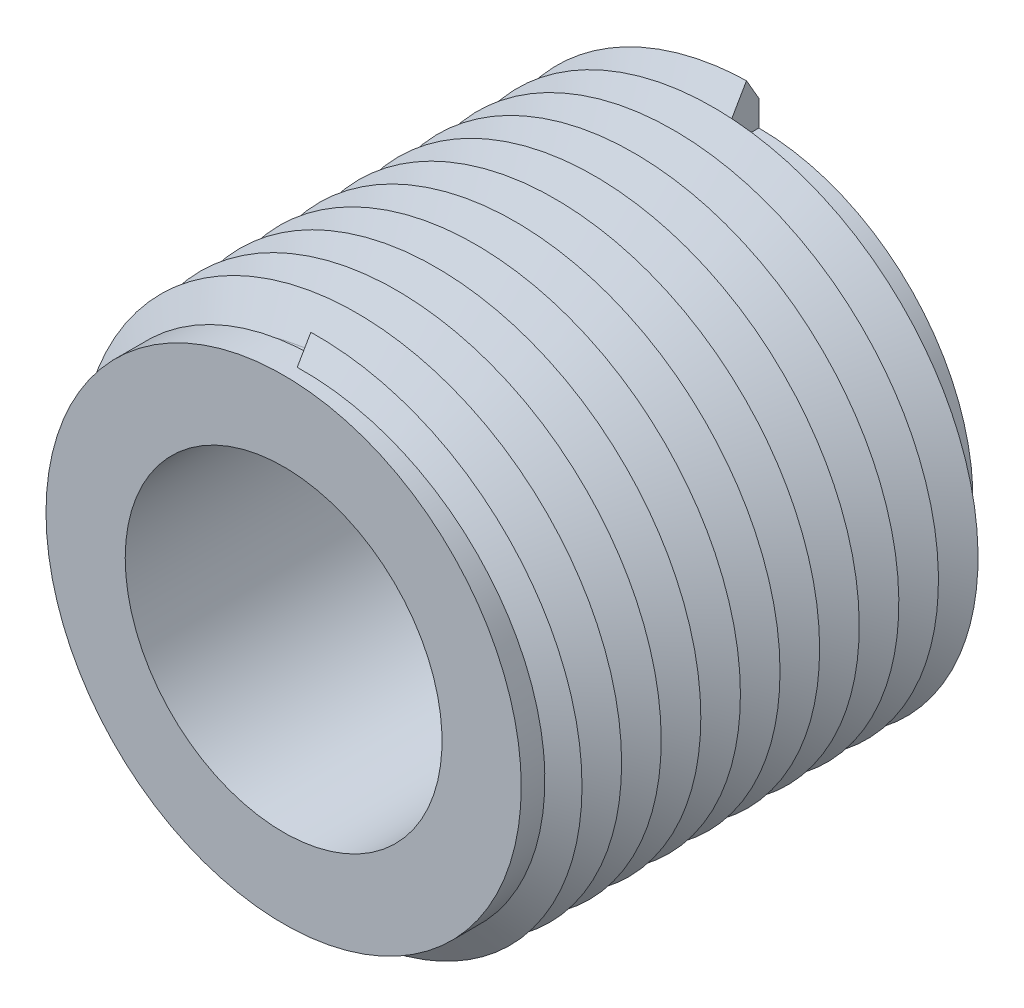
ISO-10303-21;
HEADER;
FILE_DESCRIPTION(('STEP AP214'),'2;1');
FILE_NAME('part.step','',(''),(''),'','','');
FILE_SCHEMA(('AUTOMOTIVE_DESIGN { 1 0 10303 214 1 1 1 1 }'));
ENDSEC;
DATA;
#1=APPLICATION_CONTEXT('core data for automotive mechanical design processes');
#2=APPLICATION_PROTOCOL_DEFINITION('international standard','automotive_design',2000,#1);
#3=PRODUCT_CONTEXT('',#1,'mechanical');
#4=PRODUCT('Part','Part','',(#3));
#5=PRODUCT_RELATED_PRODUCT_CATEGORY('part','',(#4));
#6=PRODUCT_DEFINITION_FORMATION('','',#4);
#7=PRODUCT_DEFINITION_CONTEXT('part definition',#1,'design');
#8=PRODUCT_DEFINITION('design','',#6,#7);
#9=PRODUCT_DEFINITION_SHAPE('','',#8);
#10=(LENGTH_UNIT() NAMED_UNIT(*) SI_UNIT(.MILLI.,.METRE.));
#11=(NAMED_UNIT(*) PLANE_ANGLE_UNIT() SI_UNIT($,.RADIAN.));
#12=(NAMED_UNIT(*) SI_UNIT($,.STERADIAN.) SOLID_ANGLE_UNIT());
#13=UNCERTAINTY_MEASURE_WITH_UNIT(LENGTH_MEASURE(1.E-05),#10,'distance_accuracy_value','');
#14=(GEOMETRIC_REPRESENTATION_CONTEXT(3) GLOBAL_UNCERTAINTY_ASSIGNED_CONTEXT((#13)) GLOBAL_UNIT_ASSIGNED_CONTEXT((#10,
#11,#12)) REPRESENTATION_CONTEXT('',''));
#15=CARTESIAN_POINT('',(0.,0.,0.));
#16=DIRECTION('',(0.,0.,1.));
#17=DIRECTION('',(1.,0.,0.));
#18=AXIS2_PLACEMENT_3D('',#15,#16,#17);
#19=CARTESIAN_POINT('',(0.,0.,8.89));
#20=DIRECTION('',(0.,0.,-1.));
#21=DIRECTION('',(-1.,0.,0.));
#22=AXIS2_PLACEMENT_3D('',#19,#20,#21);
#23=CYLINDRICAL_SURFACE('',#22,4.29006);
#24=DIRECTION('',(0.,0.,-1.));
#25=VECTOR('',#24,1.);
#26=CARTESIAN_POINT('',(8.79905061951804E-10,4.29006,8.81014875));
#27=LINE('',#26,#25);
#28=CARTESIAN_POINT('',(4.39952530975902E-10,4.29006,8.73125000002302));
#29=VERTEX_POINT('',#28);
#30=CARTESIAN_POINT('',(4.39952530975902E-10,4.29006,8.89));
#31=VERTEX_POINT('',#30);
#32=EDGE_CURVE('E81',#29,#31,#27,.F.);
#33=ORIENTED_EDGE('',*,*,#32,.F.);
#34=CARTESIAN_POINT('',(-4.07752570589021,1.33356624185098,8.88999999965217));
#35=CARTESIAN_POINT('',(-4.04469969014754,1.43392140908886,8.88681886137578));
#36=CARTESIAN_POINT('',(-4.00819099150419,1.53301488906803,8.8836301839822));
#37=CARTESIAN_POINT('',(-3.92791867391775,1.72836866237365,8.87724802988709));
#38=CARTESIAN_POINT('',(-3.88414569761,1.82462511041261,8.87405455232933));
#39=CARTESIAN_POINT('',(-3.74134540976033,2.1100722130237,8.86443463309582));
#40=CARTESIAN_POINT('',(-3.63146249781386,2.29402478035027,8.85802943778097));
#41=CARTESIAN_POINT('',(-3.44713684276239,2.55604080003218,8.84858131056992));
#42=CARTESIAN_POINT('',(-3.38237997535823,2.64112853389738,8.84545589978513));
#43=CARTESIAN_POINT('',(-3.24667951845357,2.8062588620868,8.83928014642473));
#44=CARTESIAN_POINT('',(-3.17573593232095,2.88630145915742,8.83622980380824));
#45=CARTESIAN_POINT('',(-3.01856695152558,3.05080735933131,8.82980620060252));
#46=CARTESIAN_POINT('',(-2.93154964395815,3.13451506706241,8.82644186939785));
#47=CARTESIAN_POINT('',(-2.75076591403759,3.29430668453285,8.81957117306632));
#48=CARTESIAN_POINT('',(-2.65699875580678,3.37038976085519,8.81606479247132));
#49=CARTESIAN_POINT('',(-2.46335276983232,3.5144093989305,8.80898680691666));
#50=CARTESIAN_POINT('',(-2.36347172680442,3.58234298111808,8.80541517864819));
#51=CARTESIAN_POINT('',(-2.15834548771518,3.70954486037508,8.79821937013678));
#52=CARTESIAN_POINT('',(-2.05310056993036,3.7688136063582,8.79459519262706));
#53=CARTESIAN_POINT('',(-1.83793923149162,3.87829489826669,8.78732194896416));
#54=CARTESIAN_POINT('',(-1.72802061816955,3.92850313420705,8.78367287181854));
#55=CARTESIAN_POINT('',(-1.50434078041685,4.01947138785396,8.77637648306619));
#56=CARTESIAN_POINT('',(-1.39057956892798,4.06023143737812,8.77272917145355));
#57=CARTESIAN_POINT('',(-1.16015075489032,4.13197425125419,8.76546652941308));
#58=CARTESIAN_POINT('',(-1.04348642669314,4.16296753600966,8.76185116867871));
#59=CARTESIAN_POINT('',(-0.808004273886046,4.21500604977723,8.75467534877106));
#60=CARTESIAN_POINT('',(-0.689187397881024,4.2360555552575,8.75111486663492));
#61=CARTESIAN_POINT('',(-0.475230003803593,4.26472249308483,8.74481021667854));
#62=CARTESIAN_POINT('',(-0.380338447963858,4.27422906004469,8.74205115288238));
#63=CARTESIAN_POINT('',(-0.190300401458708,4.28689414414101,8.73659931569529));
#64=CARTESIAN_POINT('',(-0.095154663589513,4.29006391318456,8.73390643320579));
#65=CARTESIAN_POINT('',(0.,4.29006,8.73125));
#66=B_SPLINE_CURVE_WITH_KNOTS('',3,(#34,#35,#36,#37,#38,#39,#40,#41,#42,#43,#44,#45,#46,#47,#48,
#49,#50,#51,#52,#53,#54,#55,#56,#57,#58,#59,#60,#61,#62,#63,#64,#65),.UNSPECIFIED.,.F.,.F.,(4,2,
2,2,2,2,2,2,2,2,2,2,2,2,2,4),(0.,0.31672618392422,0.633863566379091,1.27413046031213,
1.59482167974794,1.91551272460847,2.27745171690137,2.63943022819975,3.00154068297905,
3.36363237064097,3.72589584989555,4.08815810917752,4.45002880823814,4.81174373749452,
5.09775903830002,5.38326602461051),.UNSPECIFIED.);
#67=CARTESIAN_POINT('',(-4.07752570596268,1.33356624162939,8.88999999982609));
#68=VERTEX_POINT('',#67);
#69=EDGE_CURVE('E20',#68,#29,#66,.T.);
#70=ORIENTED_EDGE('',*,*,#69,.F.);
#71=CARTESIAN_POINT('',(0.,0.,8.89));
#72=DIRECTION('',(0.,0.,-1.));
#73=DIRECTION('',(-1.,0.,0.));
#74=AXIS2_PLACEMENT_3D('',#71,#72,#73);
#75=CIRCLE('',#74,4.29006);
#76=EDGE_CURVE('E79',#68,#31,#75,.T.);
#77=ORIENTED_EDGE('',*,*,#76,.T.);
#78=EDGE_LOOP('',(#33,#70,#77));
#79=FACE_BOUND('',#78,.T.);
#80=ADVANCED_FACE('F15',(#79),#23,.T.);
#81=CARTESIAN_POINT('',(-2.8974662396,-3.5049593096,8.8917896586));
#82=CARTESIAN_POINT('',(-3.0633773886,-3.3678045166,8.8859238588));
#83=CARTESIAN_POINT('',(-3.2155909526,-3.2155909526,8.880254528));
#84=CARTESIAN_POINT('',(-4.5475323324,-1.8836495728,8.830645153));
#85=CARTESIAN_POINT('',(-4.5475323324,0.,8.781035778));
#86=CARTESIAN_POINT('',(-4.5475323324,1.8836495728,8.731426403));
#87=CARTESIAN_POINT('',(-3.2155909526,3.2155909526,8.681817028));
#88=CARTESIAN_POINT('',(-1.8836495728,4.5475323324,8.632207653));
#89=CARTESIAN_POINT('',(0.,4.5475323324,8.582598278));
#90=CARTESIAN_POINT('',(-2.7334173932,-3.3065154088,9.0404413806));
#91=CARTESIAN_POINT('',(-2.8899349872,-3.1771260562,9.0345755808));
#92=CARTESIAN_POINT('',(-3.033530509,-3.033530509,9.02890625));
#93=CARTESIAN_POINT('',(-4.29006,-1.7770010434,8.979296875));
#94=CARTESIAN_POINT('',(-4.29006,0.,8.9296875));
#95=CARTESIAN_POINT('',(-4.29006,1.7770010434,8.880078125));
#96=CARTESIAN_POINT('',(-3.033530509,3.033530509,8.83046875));
#97=CARTESIAN_POINT('',(-1.7770010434,4.29006,8.780859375));
#98=CARTESIAN_POINT('',(0.,4.29006,8.73125));
#99=(BOUNDED_SURFACE() B_SPLINE_SURFACE(1,2,((#81,#82,#83,#84,#85,#86,#87,#88,#89),(#90,#91,#92,
#93,#94,#95,#96,#97,#98)),.UNSPECIFIED.,.F.,.F.,.F.) B_SPLINE_SURFACE_WITH_KNOTS((2,2),(3,2,2,2,
3),(0.,1.),(0.609682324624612,0.625,0.75,0.875,1.),
.UNSPECIFIED.) GEOMETRIC_REPRESENTATION_ITEM() RATIONAL_B_SPLINE_SURFACE(((0.983630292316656,
0.990672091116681,1.,0.923879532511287,1.,0.923879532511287,1.,0.923879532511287,1.),
(0.983630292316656,0.990672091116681,1.,0.923879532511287,1.,0.923879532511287,1.,
0.923879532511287,1.))) REPRESENTATION_ITEM('') SURFACE());
#100=DIRECTION('',(0.,-0.866025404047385,0.499999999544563));
#101=VECTOR('',#100,1.);
#102=CARTESIAN_POINT('',(0.,4.547532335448,8.582598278));
#103=LINE('',#102,#101);
#104=CARTESIAN_POINT('',(-3.7125656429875E-08,4.547532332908,8.58259827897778));
#105=VERTEX_POINT('',#104);
#106=EDGE_CURVE('E93',#29,#105,#103,.F.);
#107=CARTESIAN_POINT('',(0.,4.5475323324,9.376348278));
#108=CARTESIAN_POINT('',(1.8836495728,4.5475323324,9.326738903));
#109=CARTESIAN_POINT('',(3.2155909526,3.2155909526,9.277129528));
#110=CARTESIAN_POINT('',(4.5475323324,1.8836495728,9.227520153));
#111=CARTESIAN_POINT('',(4.5475323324,0.,9.177910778));
#112=CARTESIAN_POINT('',(4.5475323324,-1.8836495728,9.128301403));
#113=CARTESIAN_POINT('',(3.2155909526,-3.2155909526,9.078692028));
#114=CARTESIAN_POINT('',(1.8836495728,-4.5475323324,9.029082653));
#115=CARTESIAN_POINT('',(0.,-4.5475323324,8.979473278));
#116=CARTESIAN_POINT('',(-1.8836495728,-4.5475323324,8.929863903));
#117=CARTESIAN_POINT('',(-3.2155909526,-3.2155909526,8.880254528));
#118=CARTESIAN_POINT('',(-4.5475323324,-1.8836495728,8.830645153));
#119=CARTESIAN_POINT('',(-4.5475323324,0.,8.781035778));
#120=CARTESIAN_POINT('',(-4.5475323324,1.8836495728,8.731426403));
#121=CARTESIAN_POINT('',(-3.2155909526,3.2155909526,8.681817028));
#122=CARTESIAN_POINT('',(-1.8836495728,4.5475323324,8.632207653));
#123=CARTESIAN_POINT('',(0.,4.5475323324,8.582598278));
#124=CARTESIAN_POINT('',(1.8836495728,4.5475323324,8.532988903));
#125=CARTESIAN_POINT('',(3.2155909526,3.2155909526,8.483379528));
#126=CARTESIAN_POINT('',(4.5475323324,1.8836495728,8.433770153));
#127=CARTESIAN_POINT('',(4.5475323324,0.,8.384160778));
#128=CARTESIAN_POINT('',(4.5475323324,-1.8836495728,8.334551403));
#129=CARTESIAN_POINT('',(3.2155909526,-3.2155909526,8.284942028));
#130=CARTESIAN_POINT('',(1.8836495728,-4.5475323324,8.235332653));
#131=CARTESIAN_POINT('',(0.,-4.5475323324,8.185723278));
#132=CARTESIAN_POINT('',(-1.8836495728,-4.5475323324,8.136113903));
#133=CARTESIAN_POINT('',(-3.2155909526,-3.2155909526,8.086504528));
#134=CARTESIAN_POINT('',(-4.5475323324,-1.8836495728,8.036895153));
#135=CARTESIAN_POINT('',(-4.5475323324,0.,7.987285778));
#136=CARTESIAN_POINT('',(-4.5475323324,1.8836495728,7.937676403));
#137=CARTESIAN_POINT('',(-3.2155909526,3.2155909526,7.888067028));
#138=CARTESIAN_POINT('',(-1.8836495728,4.5475323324,7.838457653));
#139=CARTESIAN_POINT('',(0.,4.5475323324,7.788848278));
#140=CARTESIAN_POINT('',(1.8836495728,4.5475323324,7.739238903));
#141=CARTESIAN_POINT('',(3.2155909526,3.2155909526,7.689629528));
#142=CARTESIAN_POINT('',(4.5475323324,1.8836495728,7.640020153));
#143=CARTESIAN_POINT('',(4.5475323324,0.,7.590410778));
#144=CARTESIAN_POINT('',(4.5475323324,-1.8836495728,7.540801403));
#145=CARTESIAN_POINT('',(3.2155909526,-3.2155909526,7.491192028));
#146=CARTESIAN_POINT('',(1.8836495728,-4.5475323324,7.441582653));
#147=CARTESIAN_POINT('',(0.,-4.5475323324,7.391973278));
#148=CARTESIAN_POINT('',(-1.8836495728,-4.5475323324,7.342363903));
#149=CARTESIAN_POINT('',(-3.2155909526,-3.2155909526,7.292754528));
#150=CARTESIAN_POINT('',(-4.5475323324,-1.8836495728,7.243145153));
#151=CARTESIAN_POINT('',(-4.5475323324,0.,7.193535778));
#152=CARTESIAN_POINT('',(-4.5475323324,1.8836495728,7.143926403));
#153=CARTESIAN_POINT('',(-3.2155909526,3.2155909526,7.094317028));
#154=CARTESIAN_POINT('',(-1.8836495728,4.5475323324,7.044707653));
#155=CARTESIAN_POINT('',(0.,4.5475323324,6.995098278));
#156=CARTESIAN_POINT('',(1.8836495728,4.5475323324,6.945488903));
#157=CARTESIAN_POINT('',(3.2155909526,3.2155909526,6.895879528));
#158=CARTESIAN_POINT('',(4.5475323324,1.8836495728,6.846270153));
#159=CARTESIAN_POINT('',(4.5475323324,0.,6.796660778));
#160=CARTESIAN_POINT('',(4.5475323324,-1.8836495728,6.747051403));
#161=CARTESIAN_POINT('',(3.2155909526,-3.2155909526,6.697442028));
#162=CARTESIAN_POINT('',(1.8836495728,-4.5475323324,6.647832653));
#163=CARTESIAN_POINT('',(0.,-4.5475323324,6.598223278));
#164=CARTESIAN_POINT('',(-1.8836495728,-4.5475323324,6.548613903));
#165=CARTESIAN_POINT('',(-3.2155909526,-3.2155909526,6.499004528));
#166=CARTESIAN_POINT('',(-4.5475323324,-1.8836495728,6.449395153));
#167=CARTESIAN_POINT('',(-4.5475323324,0.,6.399785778));
#168=CARTESIAN_POINT('',(-4.5475323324,1.8836495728,6.350176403));
#169=CARTESIAN_POINT('',(-3.2155909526,3.2155909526,6.300567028));
#170=CARTESIAN_POINT('',(-1.8836495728,4.5475323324,6.250957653));
#171=CARTESIAN_POINT('',(0.,4.5475323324,6.201348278));
#172=CARTESIAN_POINT('',(1.8836495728,4.5475323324,6.151738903));
#173=CARTESIAN_POINT('',(3.2155909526,3.2155909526,6.102129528));
#174=CARTESIAN_POINT('',(4.5475323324,1.8836495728,6.052520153));
#175=CARTESIAN_POINT('',(4.5475323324,0.,6.002910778));
#176=CARTESIAN_POINT('',(4.5475323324,-1.8836495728,5.953301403));
#177=CARTESIAN_POINT('',(3.2155909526,-3.2155909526,5.903692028));
#178=CARTESIAN_POINT('',(1.8836495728,-4.5475323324,5.854082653));
#179=CARTESIAN_POINT('',(0.,-4.5475323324,5.804473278));
#180=CARTESIAN_POINT('',(-1.8836495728,-4.5475323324,5.754863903));
#181=CARTESIAN_POINT('',(-3.2155909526,-3.2155909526,5.705254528));
#182=CARTESIAN_POINT('',(-4.5475323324,-1.8836495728,5.655645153));
#183=CARTESIAN_POINT('',(-4.5475323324,0.,5.606035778));
#184=CARTESIAN_POINT('',(-4.5475323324,1.8836495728,5.556426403));
#185=CARTESIAN_POINT('',(-3.2155909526,3.2155909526,5.506817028));
#186=CARTESIAN_POINT('',(-1.8836495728,4.5475323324,5.457207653));
#187=CARTESIAN_POINT('',(0.,4.5475323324,5.407598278));
#188=CARTESIAN_POINT('',(1.8836495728,4.5475323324,5.357988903));
#189=CARTESIAN_POINT('',(3.2155909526,3.2155909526,5.308379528));
#190=CARTESIAN_POINT('',(4.5475323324,1.8836495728,5.258770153));
#191=CARTESIAN_POINT('',(4.5475323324,0.,5.209160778));
#192=CARTESIAN_POINT('',(4.5475323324,-1.8836495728,5.159551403));
#193=CARTESIAN_POINT('',(3.2155909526,-3.2155909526,5.109942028));
#194=CARTESIAN_POINT('',(1.8836495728,-4.5475323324,5.060332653));
#195=CARTESIAN_POINT('',(0.,-4.5475323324,5.010723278));
#196=CARTESIAN_POINT('',(-1.8836495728,-4.5475323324,4.961113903));
#197=CARTESIAN_POINT('',(-3.2155909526,-3.2155909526,4.911504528));
#198=CARTESIAN_POINT('',(-4.5475323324,-1.8836495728,4.861895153));
#199=CARTESIAN_POINT('',(-4.5475323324,0.,4.812285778));
#200=CARTESIAN_POINT('',(-4.5475323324,1.8836495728,4.762676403));
#201=CARTESIAN_POINT('',(-3.2155909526,3.2155909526,4.713067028));
#202=CARTESIAN_POINT('',(-1.8836495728,4.5475323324,4.663457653));
#203=CARTESIAN_POINT('',(0.,4.5475323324,4.613848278));
#204=CARTESIAN_POINT('',(1.8836495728,4.5475323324,4.564238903));
#205=CARTESIAN_POINT('',(3.2155909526,3.2155909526,4.514629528));
#206=CARTESIAN_POINT('',(4.5475323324,1.8836495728,4.465020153));
#207=CARTESIAN_POINT('',(4.5475323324,0.,4.415410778));
#208=CARTESIAN_POINT('',(4.5475323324,-1.8836495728,4.365801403));
#209=CARTESIAN_POINT('',(3.2155909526,-3.2155909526,4.316192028));
#210=CARTESIAN_POINT('',(1.8836495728,-4.5475323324,4.266582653));
#211=CARTESIAN_POINT('',(0.,-4.5475323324,4.216973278));
#212=CARTESIAN_POINT('',(-1.8836495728,-4.5475323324,4.167363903));
#213=CARTESIAN_POINT('',(-3.2155909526,-3.2155909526,4.117754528));
#214=CARTESIAN_POINT('',(-4.5475323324,-1.8836495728,4.068145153));
#215=CARTESIAN_POINT('',(-4.5475323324,0.,4.018535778));
#216=CARTESIAN_POINT('',(-4.5475323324,1.8836495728,3.968926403));
#217=CARTESIAN_POINT('',(-3.2155909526,3.2155909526,3.919317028));
#218=CARTESIAN_POINT('',(-1.8836495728,4.5475323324,3.869707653));
#219=CARTESIAN_POINT('',(0.,4.5475323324,3.820098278));
#220=CARTESIAN_POINT('',(1.8836495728,4.5475323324,3.770488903));
#221=CARTESIAN_POINT('',(3.2155909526,3.2155909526,3.720879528));
#222=CARTESIAN_POINT('',(4.5475323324,1.8836495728,3.671270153));
#223=CARTESIAN_POINT('',(4.5475323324,0.,3.621660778));
#224=CARTESIAN_POINT('',(4.5475323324,-1.8836495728,3.572051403));
#225=CARTESIAN_POINT('',(3.2155909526,-3.2155909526,3.522442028));
#226=CARTESIAN_POINT('',(1.8836495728,-4.5475323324,3.472832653));
#227=CARTESIAN_POINT('',(0.,-4.5475323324,3.423223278));
#228=CARTESIAN_POINT('',(-1.8836495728,-4.5475323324,3.373613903));
#229=CARTESIAN_POINT('',(-3.2155909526,-3.2155909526,3.324004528));
#230=CARTESIAN_POINT('',(-4.5475323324,-1.8836495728,3.274395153));
#231=CARTESIAN_POINT('',(-4.5475323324,0.,3.224785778));
#232=CARTESIAN_POINT('',(-4.5475323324,1.8836495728,3.175176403));
#233=CARTESIAN_POINT('',(-3.2155909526,3.2155909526,3.125567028));
#234=CARTESIAN_POINT('',(-1.8836495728,4.5475323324,3.075957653));
#235=CARTESIAN_POINT('',(0.,4.5475323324,3.026348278));
#236=CARTESIAN_POINT('',(1.8836495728,4.5475323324,2.976738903));
#237=CARTESIAN_POINT('',(3.2155909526,3.2155909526,2.927129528));
#238=CARTESIAN_POINT('',(4.5475323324,1.8836495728,2.877520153));
#239=CARTESIAN_POINT('',(4.5475323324,0.,2.827910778));
#240=CARTESIAN_POINT('',(4.5475323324,-1.8836495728,2.778301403));
#241=CARTESIAN_POINT('',(3.2155909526,-3.2155909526,2.728692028));
#242=CARTESIAN_POINT('',(1.8836495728,-4.5475323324,2.679082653));
#243=CARTESIAN_POINT('',(0.,-4.5475323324,2.629473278));
#244=CARTESIAN_POINT('',(-1.8836495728,-4.5475323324,2.579863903));
#245=CARTESIAN_POINT('',(-3.2155909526,-3.2155909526,2.530254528));
#246=CARTESIAN_POINT('',(-4.5475323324,-1.8836495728,2.480645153));
#247=CARTESIAN_POINT('',(-4.5475323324,0.,2.431035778));
#248=CARTESIAN_POINT('',(-4.5475323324,1.8836495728,2.381426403));
#249=CARTESIAN_POINT('',(-3.2155909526,3.2155909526,2.331817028));
#250=CARTESIAN_POINT('',(-1.8836495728,4.5475323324,2.282207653));
#251=CARTESIAN_POINT('',(0.,4.5475323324,2.232598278));
#252=CARTESIAN_POINT('',(1.8836495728,4.5475323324,2.182988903));
#253=CARTESIAN_POINT('',(3.2155909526,3.2155909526,2.133379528));
#254=CARTESIAN_POINT('',(4.5475323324,1.8836495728,2.083770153));
#255=CARTESIAN_POINT('',(4.5475323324,0.,2.034160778));
#256=CARTESIAN_POINT('',(4.5475323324,-1.8836495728,1.984551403));
#257=CARTESIAN_POINT('',(3.2155909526,-3.2155909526,1.934942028));
#258=CARTESIAN_POINT('',(1.8836495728,-4.5475323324,1.885332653));
#259=CARTESIAN_POINT('',(0.,-4.5475323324,1.835723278));
#260=CARTESIAN_POINT('',(-1.8836495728,-4.5475323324,1.786113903));
#261=CARTESIAN_POINT('',(-3.2155909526,-3.2155909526,1.736504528));
#262=CARTESIAN_POINT('',(-4.5475323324,-1.8836495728,1.686895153));
#263=CARTESIAN_POINT('',(-4.5475323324,0.,1.637285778));
#264=CARTESIAN_POINT('',(-4.5475323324,1.8836495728,1.587676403));
#265=CARTESIAN_POINT('',(-3.2155909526,3.2155909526,1.538067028));
#266=CARTESIAN_POINT('',(-1.8836495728,4.5475323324,1.488457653));
#267=CARTESIAN_POINT('',(0.,4.5475323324,1.438848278));
#268=CARTESIAN_POINT('',(1.8836495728,4.5475323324,1.389238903));
#269=CARTESIAN_POINT('',(3.2155909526,3.2155909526,1.339629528));
#270=CARTESIAN_POINT('',(4.5475323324,1.8836495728,1.290020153));
#271=CARTESIAN_POINT('',(4.5475323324,0.,1.240410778));
#272=CARTESIAN_POINT('',(4.5475323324,-1.8836495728,1.190801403));
#273=CARTESIAN_POINT('',(3.2155909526,-3.2155909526,1.141192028));
#274=CARTESIAN_POINT('',(1.8836495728,-4.5475323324,1.091582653));
#275=CARTESIAN_POINT('',(0.,-4.5475323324,1.041973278));
#276=CARTESIAN_POINT('',(-1.8836495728,-4.5475323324,0.992363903));
#277=CARTESIAN_POINT('',(-3.2155909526,-3.2155909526,0.942754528));
#278=CARTESIAN_POINT('',(-4.5475323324,-1.8836495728,0.893145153));
#279=CARTESIAN_POINT('',(-4.5475323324,0.,0.843535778));
#280=CARTESIAN_POINT('',(-4.5475323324,1.8836495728,0.793926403));
#281=CARTESIAN_POINT('',(-3.2155909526,3.2155909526,0.744317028));
#282=CARTESIAN_POINT('',(-1.8836495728,4.5475323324,0.694707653));
#283=CARTESIAN_POINT('',(0.,4.5475323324,0.645098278));
#284=CARTESIAN_POINT('',(1.53143345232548,4.5475323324,0.604765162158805));
#285=CARTESIAN_POINT('',(3.06286690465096,4.5475323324,0.564432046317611));
#286=(BOUNDED_CURVE() B_SPLINE_CURVE(2,(#107,#108,#109,#110,#111,#112,#113,#114,#115,#116,#117,
#118,#119,#120,#121,#122,#123,#124,#125,#126,#127,#128,#129,#130,#131,#132,#133,#134,#135,#136,
#137,#138,#139,#140,#141,#142,#143,#144,#145,#146,#147,#148,#149,#150,#151,#152,#153,#154,#155,
#156,#157,#158,#159,#160,#161,#162,#163,#164,#165,#166,#167,#168,#169,#170,#171,#172,#173,#174,
#175,#176,#177,#178,#179,#180,#181,#182,#183,#184,#185,#186,#187,#188,#189,#190,#191,#192,#193,
#194,#195,#196,#197,#198,#199,#200,#201,#202,#203,#204,#205,#206,#207,#208,#209,#210,#211,#212,
#213,#214,#215,#216,#217,#218,#219,#220,#221,#222,#223,#224,#225,#226,#227,#228,#229,#230,#231,
#232,#233,#234,#235,#236,#237,#238,#239,#240,#241,#242,#243,#244,#245,#246,#247,#248,#249,#250,
#251,#252,#253,#254,#255,#256,#257,#258,#259,#260,#261,#262,#263,#264,#265,#266,#267,#268,#269,
#270,#271,#272,#273,#274,#275,#276,#277,#278,#279,#280,#281,#282,#283,#284,#285),.UNSPECIFIED.,
.F.,.F.) B_SPLINE_CURVE_WITH_KNOTS((3,2,2,2,2,2,2,2,2,2,2,2,2,2,2,2,2,2,2,2,2,2,2,2,2,2,2,2,2,2,
2,2,2,2,2,2,2,2,2,2,2,2,2,2,2,2,2,2,2,2,2,2,2,2,2,2,2,2,2,2,2,2,2,2,2,2,2,2,2,2,2,2,2,2,2,2,2,2,
2,2,2,2,2,2,2,2,2,2,2,3),(0.,0.0104166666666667,0.0208333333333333,0.03125,0.0416666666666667,
0.0520833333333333,0.0625,0.0729166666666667,0.0833333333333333,0.09375,0.104166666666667,
0.114583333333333,0.125,0.135416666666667,0.145833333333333,0.15625,0.166666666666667,
0.177083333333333,0.1875,0.197916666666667,0.208333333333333,0.21875,0.229166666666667,
0.239583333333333,0.25,0.260416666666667,0.270833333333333,0.28125,0.291666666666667,
0.302083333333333,0.3125,0.322916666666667,0.333333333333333,0.34375,0.354166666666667,
0.364583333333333,0.375,0.385416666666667,0.395833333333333,0.40625,0.416666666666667,
0.427083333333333,0.4375,0.447916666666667,0.458333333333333,0.46875,0.479166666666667,
0.489583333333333,0.5,0.510416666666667,0.520833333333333,0.53125,0.541666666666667,
0.552083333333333,0.5625,0.572916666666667,0.583333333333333,0.59375,0.604166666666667,
0.614583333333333,0.625,0.635416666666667,0.645833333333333,0.65625,0.666666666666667,
0.677083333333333,0.6875,0.697916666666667,0.708333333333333,0.71875,0.729166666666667,
0.739583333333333,0.75,0.760416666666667,0.770833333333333,0.78125,0.791666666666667,
0.802083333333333,0.8125,0.822916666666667,0.833333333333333,0.84375,0.854166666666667,
0.864583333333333,0.875,0.885416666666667,0.895833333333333,0.90625,0.916666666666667,
0.925833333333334),
.UNSPECIFIED.) CURVE() GEOMETRIC_REPRESENTATION_ITEM() RATIONAL_B_SPLINE_CURVE((1.,
0.923879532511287,1.,0.923879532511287,1.,0.923879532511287,1.,0.923879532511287,1.,
0.923879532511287,1.,0.923879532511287,1.,0.923879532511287,1.,0.923879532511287,1.,
0.923879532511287,1.,0.923879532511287,1.,0.923879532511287,1.,0.923879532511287,1.,
0.923879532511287,1.,0.923879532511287,1.,0.923879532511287,1.,0.923879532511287,1.,
0.923879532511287,1.,0.923879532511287,1.,0.923879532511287,1.,0.923879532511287,1.,
0.923879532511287,1.,0.923879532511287,1.,0.923879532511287,1.,0.923879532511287,1.,
0.923879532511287,1.,0.923879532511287,1.,0.923879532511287,1.,0.923879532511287,1.,
0.923879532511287,1.,0.923879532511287,1.,0.923879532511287,1.,0.923879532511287,1.,
0.923879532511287,1.,0.923879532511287,1.,0.923879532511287,1.,0.923879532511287,1.,
0.923879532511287,1.,0.923879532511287,1.,0.923879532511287,1.,0.923879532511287,1.,
0.923879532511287,1.,0.923879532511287,1.,0.923879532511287,1.,0.923879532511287,1.,
0.923879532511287,1.,0.923879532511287,1.,0.923879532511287,1.,0.923879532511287,1.,
0.923879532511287,1.,0.923879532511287,1.,0.923879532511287,1.,0.923879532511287,1.,
0.923879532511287,1.,0.923879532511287,1.,0.923879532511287,1.,0.923879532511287,1.,
0.923879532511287,1.,0.923879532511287,1.,0.923879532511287,1.,0.923879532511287,1.,
0.923879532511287,1.,0.923879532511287,1.,0.923879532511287,1.,0.923879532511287,1.,
0.923879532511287,1.,0.923879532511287,1.,0.923879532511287,1.,0.923879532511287,1.,
0.923879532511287,1.,0.923879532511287,1.,0.923879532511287,1.,0.923879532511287,1.,
0.923879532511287,1.,0.923879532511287,1.,0.923879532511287,1.,0.923879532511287,1.,
0.923879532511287,1.,0.923879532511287,1.,0.923879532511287,1.,0.923879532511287,1.,
0.923879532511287,1.,0.923879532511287,1.,0.923879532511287,1.,0.923879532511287,1.,
0.923879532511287,1.,0.923879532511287,1.,0.923879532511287,1.,0.923879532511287,1.,1.,1.)) REPRESENTATION_ITEM(''));
#287=CARTESIAN_POINT('',(-2.94789528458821,-3.46265270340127,8.8899999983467));
#288=VERTEX_POINT('',#287);
#289=EDGE_CURVE('E98',#288,#105,#286,.T.);
#290=CARTESIAN_POINT('',(-2.94789527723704,-3.46265269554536,8.89));
#291=CARTESIAN_POINT('',(-2.98643229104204,-3.42658948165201,8.89));
#292=CARTESIAN_POINT('',(-3.02435105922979,-3.38986707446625,8.89));
#293=CARTESIAN_POINT('',(-3.09890437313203,-3.31514456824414,8.89));
#294=CARTESIAN_POINT('',(-3.13553898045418,-3.27714453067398,8.89));
#295=CARTESIAN_POINT('',(-3.20752392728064,-3.19985677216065,8.89));
#296=CARTESIAN_POINT('',(-3.24287264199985,-3.16056753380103,8.89));
#297=CARTESIAN_POINT('',(-3.31213866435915,-3.08074511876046,8.89));
#298=CARTESIAN_POINT('',(-3.34605574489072,-3.04021174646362,8.89));
#299=CARTESIAN_POINT('',(-3.51316896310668,-2.83308528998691,8.88999999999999));
#300=CARTESIAN_POINT('',(-3.63526129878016,-2.65726060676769,8.89));
#301=CARTESIAN_POINT('',(-3.8529536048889,-2.28975047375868,8.89));
#302=CARTESIAN_POINT('',(-3.94852873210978,-2.09805036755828,8.89));
#303=CARTESIAN_POINT('',(-4.07729743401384,-1.78516508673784,8.89));
#304=CARTESIAN_POINT('',(-4.11991051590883,-1.66777566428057,8.89));
#305=CARTESIAN_POINT('',(-4.19509699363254,-1.42983435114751,8.89));
#306=CARTESIAN_POINT('',(-4.22767277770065,-1.30928322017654,8.89));
#307=CARTESIAN_POINT('',(-4.28258169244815,-1.06574674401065,8.89));
#308=CARTESIAN_POINT('',(-4.30490444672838,-0.942759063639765,8.89));
#309=CARTESIAN_POINT('',(-4.3391044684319,-0.695343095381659,8.89));
#310=CARTESIAN_POINT('',(-4.35098177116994,-0.570914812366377,8.89));
#311=CARTESIAN_POINT('',(-4.3642149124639,-0.32130807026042,8.89));
#312=CARTESIAN_POINT('',(-4.3655558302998,-0.196128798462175,8.89));
#313=CARTESIAN_POINT('',(-4.35964436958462,-0.00863300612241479,8.89));
#314=CARTESIAN_POINT('',(-4.35635222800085,0.0538302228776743,8.89));
#315=CARTESIAN_POINT('',(-4.34701278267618,0.178550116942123,8.89));
#316=CARTESIAN_POINT('',(-4.34096553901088,0.240806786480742,8.89));
#317=CARTESIAN_POINT('',(-4.31876460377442,0.426815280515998,8.89));
#318=CARTESIAN_POINT('',(-4.29854240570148,0.550103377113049,8.89));
#319=CARTESIAN_POINT('',(-4.24738152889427,0.794365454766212,8.89));
#320=CARTESIAN_POINT('',(-4.21644899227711,0.915340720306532,8.89000000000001));
#321=CARTESIAN_POINT('',(-4.16500756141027,1.08515289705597,8.89000000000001));
#322=CARTESIAN_POINT('',(-4.14878917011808,1.13531982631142,8.89));
#323=CARTESIAN_POINT('',(-4.11452486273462,1.23496109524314,8.89));
#324=CARTESIAN_POINT('',(-4.09648107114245,1.28443616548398,8.89));
#325=CARTESIAN_POINT('',(-4.07752570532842,1.33356624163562,8.89));
#326=B_SPLINE_CURVE_WITH_KNOTS('',3,(#290,#291,#292,#293,#294,#295,#296,#297,#298,#299,#300,
#301,#302,#303,#304,#305,#306,#307,#308,#309,#310,#311,#312,#313,#314,#315,#316,#317,#318,#319,
#320,#321,#322,#323,#324,#325),.UNSPECIFIED.,.F.,.F.,(4,2,2,2,2,2,2,2,2,2,2,2,2,2,2,2,2,4),(0.,
0.158328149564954,0.316648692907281,0.475162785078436,0.633701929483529,1.27340422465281,
1.91370383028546,2.28796218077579,2.6621314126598,3.03667848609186,3.41122429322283,
3.78630040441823,3.9738995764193,4.16149465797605,4.53579418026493,4.90987940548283,
5.06801970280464,5.22597802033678),.UNSPECIFIED.);
#327=EDGE_CURVE('E86',#288,#68,#326,.T.);
#328=ORIENTED_EDGE('',*,*,#69,.T.);
#329=ORIENTED_EDGE('',*,*,#106,.T.);
#330=ORIENTED_EDGE('',*,*,#289,.F.);
#331=ORIENTED_EDGE('',*,*,#327,.T.);
#332=EDGE_LOOP('',(#328,#329,#330,#331));
#333=FACE_BOUND('',#332,.T.);
#334=ADVANCED_FACE('F96',(#333),#99,.T.);
#335=CARTESIAN_POINT('',(-4.7988882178,-4.81965,8.89));
#336=DIRECTION('',(0.,0.,1.));
#337=DIRECTION('',(1.,0.,0.));
#338=AXIS2_PLACEMENT_3D('',#335,#336,#337);
#339=PLANE('',#338);
#340=DIRECTION('',(0.,-1.,0.));
#341=VECTOR('',#340,1.);
#342=CARTESIAN_POINT('',(0.,4.7625,8.89000000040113));
#343=LINE('',#342,#341);
#344=CARTESIAN_POINT('',(-4.88402010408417E-10,4.7625,8.89));
#345=VERTEX_POINT('',#344);
#346=EDGE_CURVE('E92',#345,#31,#343,.T.);
#347=ORIENTED_EDGE('',*,*,#346,.T.);
#348=ORIENTED_EDGE('',*,*,#76,.F.);
#349=ORIENTED_EDGE('',*,*,#327,.F.);
#350=CARTESIAN_POINT('',(1.30220253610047,-4.5810124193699,8.89000000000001));
#351=CARTESIAN_POINT('',(1.1712349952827,-4.6117107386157,8.89));
#352=CARTESIAN_POINT('',(1.03897624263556,-4.6368601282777,8.89));
#353=CARTESIAN_POINT('',(0.772771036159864,-4.67594461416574,8.89));
#354=CARTESIAN_POINT('',(0.6388240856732,-4.68987632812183,8.89));
#355=CARTESIAN_POINT('',(0.3703011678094,-4.70638521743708,8.89));
#356=CARTESIAN_POINT('',(0.23572564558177,-4.70896947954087,8.89));
#357=CARTESIAN_POINT('',(0.034096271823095,-4.70436360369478,8.89));
#358=CARTESIAN_POINT('',(-0.0330779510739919,-4.70141423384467,8.89));
#359=CARTESIAN_POINT('',(-0.167233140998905,-4.69257573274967,8.89));
#360=CARTESIAN_POINT('',(-0.234214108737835,-4.68668661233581,8.89));
#361=CARTESIAN_POINT('',(-0.434951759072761,-4.66460515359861,8.89));
#362=CARTESIAN_POINT('',(-0.568250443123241,-4.64400432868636,8.89));
#363=CARTESIAN_POINT('',(-0.832524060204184,-4.59121522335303,8.89));
#364=CARTESIAN_POINT('',(-0.963498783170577,-4.55902590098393,8.89));
#365=CARTESIAN_POINT('',(-1.2220118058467,-4.48333608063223,8.89));
#366=CARTESIAN_POINT('',(-1.34955339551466,-4.43984687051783,8.89));
#367=CARTESIAN_POINT('',(-1.60035467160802,-4.3418867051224,8.89));
#368=CARTESIAN_POINT('',(-1.72361290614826,-4.2874120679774,8.89));
#369=CARTESIAN_POINT('',(-2.04541583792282,-4.12795388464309,8.89));
#370=CARTESIAN_POINT('',(-2.23940760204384,-4.01349936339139,8.89));
#371=CARTESIAN_POINT('',(-2.51622915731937,-3.82166419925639,8.89));
#372=CARTESIAN_POINT('',(-2.60619988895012,-3.75430612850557,8.89));
#373=CARTESIAN_POINT('',(-2.78100122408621,-3.61319432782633,8.89));
#374=CARTESIAN_POINT('',(-2.86583101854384,-3.53943959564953,8.89));
#375=CARTESIAN_POINT('',(-2.94789528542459,-3.46265270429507,8.89));
#376=B_SPLINE_CURVE_WITH_KNOTS('',3,(#350,#351,#352,#353,#354,#355,#356,#357,#358,#359,#360,
#361,#362,#363,#364,#365,#366,#367,#368,#369,#370,#371,#372,#373,#374,#375),.UNSPECIFIED.,.F.,
.F.,(4,2,2,2,2,2,2,2,2,2,2,2,4),(0.,0.403415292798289,0.806952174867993,1.21023700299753,
1.41189996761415,1.61356218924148,2.01764243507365,2.42175902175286,2.82547346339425,
3.22932343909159,3.9022364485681,4.23916406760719,4.57614457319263),.UNSPECIFIED.);
#377=CARTESIAN_POINT('',(1.30220254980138,-4.58101241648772,8.89));
#378=VERTEX_POINT('',#377);
#379=EDGE_CURVE('E125',#378,#288,#376,.T.);
#380=ORIENTED_EDGE('',*,*,#379,.F.);
#381=CARTESIAN_POINT('',(0.,0.,8.89));
#382=DIRECTION('',(0.,0.,1.));
#383=DIRECTION('',(1.,0.,0.));
#384=AXIS2_PLACEMENT_3D('',#381,#382,#383);
#385=CIRCLE('',#384,4.7625);
#386=EDGE_CURVE('E154',#378,#345,#385,.F.);
#387=ORIENTED_EDGE('',*,*,#386,.T.);
#388=EDGE_LOOP('',(#347,#348,#349,#380,#387));
#389=FACE_BOUND('',#388,.T.);
#390=ADVANCED_FACE('F89',(#389),#339,.F.);
#391=CARTESIAN_POINT('',(0.,4.29006,8.582598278));
#392=DIRECTION('',(1.,0.,0.));
#393=DIRECTION('',(0.,1.,0.));
#394=AXIS2_PLACEMENT_3D('',#391,#392,#393);
#395=PLANE('',#394);
#396=DIRECTION('',(0.,0.,-1.));
#397=VECTOR('',#396,1.);
#398=CARTESIAN_POINT('',(-9.76804020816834E-10,4.7625,9.2075));
#399=LINE('',#398,#397);
#400=CARTESIAN_POINT('',(-2.44201005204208E-10,4.7625,9.25223663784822));
#401=VERTEX_POINT('',#400);
#402=EDGE_CURVE('E155',#345,#401,#399,.F.);
#403=ORIENTED_EDGE('',*,*,#402,.T.);
#404=DIRECTION('',(0.,-0.86602540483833,0.499999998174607));
#405=VECTOR('',#404,1.);
#406=CARTESIAN_POINT('',(0.,4.8912361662,9.177910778));
#407=LINE('',#406,#405);
#408=CARTESIAN_POINT('',(0.,5.23494,8.979473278));
#409=VERTEX_POINT('',#408);
#410=EDGE_CURVE('E263',#409,#401,#407,.T.);
#411=ORIENTED_EDGE('',*,*,#410,.F.);
#412=DIRECTION('',(0.,0.866025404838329,0.499999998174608));
#413=VECTOR('',#412,1.);
#414=CARTESIAN_POINT('',(0.,4.8912361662,8.78103577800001));
#415=LINE('',#414,#413);
#416=EDGE_CURVE('E173',#105,#409,#415,.T.);
#417=ORIENTED_EDGE('',*,*,#416,.F.);
#418=ORIENTED_EDGE('',*,*,#106,.F.);
#419=ORIENTED_EDGE('',*,*,#32,.T.);
#420=ORIENTED_EDGE('',*,*,#346,.F.);
#421=EDGE_LOOP('',(#403,#411,#417,#418,#419,#420));
#422=FACE_BOUND('',#421,.T.);
#423=ADVANCED_FACE('F114',(#422),#395,.F.);
#424=CARTESIAN_POINT('',(0.,5.23494,8.979473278));
#425=CARTESIAN_POINT('',(2.168383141,5.23494,8.929863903));
#426=CARTESIAN_POINT('',(3.7016615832,3.7016615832,8.880254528));
#427=CARTESIAN_POINT('',(5.23494,2.168383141,8.830645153));
#428=CARTESIAN_POINT('',(5.23494,0.,8.781035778));
#429=CARTESIAN_POINT('',(5.23494,-2.168383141,8.731426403));
#430=CARTESIAN_POINT('',(3.7016615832,-3.7016615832,8.681817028));
#431=CARTESIAN_POINT('',(2.168383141,-5.23494,8.632207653));
#432=CARTESIAN_POINT('',(0.,-5.23494,8.582598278));
#433=CARTESIAN_POINT('',(-2.168383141,-5.23494,8.532988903));
#434=CARTESIAN_POINT('',(-3.7016615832,-3.7016615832,8.483379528));
#435=CARTESIAN_POINT('',(-5.23494,-2.168383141,8.433770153));
#436=CARTESIAN_POINT('',(-5.23494,0.,8.384160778));
#437=CARTESIAN_POINT('',(-5.23494,2.168383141,8.334551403));
#438=CARTESIAN_POINT('',(-3.7016615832,3.7016615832,8.284942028));
#439=CARTESIAN_POINT('',(-2.168383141,5.23494,8.235332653));
#440=CARTESIAN_POINT('',(0.,5.23494,8.185723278));
#441=CARTESIAN_POINT('',(2.168383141,5.23494,8.136113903));
#442=CARTESIAN_POINT('',(3.7016615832,3.7016615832,8.086504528));
#443=CARTESIAN_POINT('',(5.23494,2.168383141,8.036895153));
#444=CARTESIAN_POINT('',(5.23494,0.,7.987285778));
#445=CARTESIAN_POINT('',(5.23494,-2.168383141,7.937676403));
#446=CARTESIAN_POINT('',(3.7016615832,-3.7016615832,7.888067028));
#447=CARTESIAN_POINT('',(2.168383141,-5.23494,7.838457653));
#448=CARTESIAN_POINT('',(0.,-5.23494,7.788848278));
#449=CARTESIAN_POINT('',(-2.168383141,-5.23494,7.739238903));
#450=CARTESIAN_POINT('',(-3.7016615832,-3.7016615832,7.689629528));
#451=CARTESIAN_POINT('',(-5.23494,-2.168383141,7.640020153));
#452=CARTESIAN_POINT('',(-5.23494,0.,7.590410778));
#453=CARTESIAN_POINT('',(-5.23494,2.168383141,7.540801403));
#454=CARTESIAN_POINT('',(-3.7016615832,3.7016615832,7.491192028));
#455=CARTESIAN_POINT('',(-2.168383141,5.23494,7.441582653));
#456=CARTESIAN_POINT('',(0.,5.23494,7.391973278));
#457=CARTESIAN_POINT('',(2.168383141,5.23494,7.342363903));
#458=CARTESIAN_POINT('',(3.7016615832,3.7016615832,7.292754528));
#459=CARTESIAN_POINT('',(5.23494,2.168383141,7.243145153));
#460=CARTESIAN_POINT('',(5.23494,0.,7.193535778));
#461=CARTESIAN_POINT('',(5.23494,-2.168383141,7.143926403));
#462=CARTESIAN_POINT('',(3.7016615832,-3.7016615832,7.094317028));
#463=CARTESIAN_POINT('',(2.168383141,-5.23494,7.044707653));
#464=CARTESIAN_POINT('',(0.,-5.23494,6.995098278));
#465=CARTESIAN_POINT('',(-2.168383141,-5.23494,6.945488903));
#466=CARTESIAN_POINT('',(-3.7016615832,-3.7016615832,6.895879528));
#467=CARTESIAN_POINT('',(-5.23494,-2.168383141,6.846270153));
#468=CARTESIAN_POINT('',(-5.23494,0.,6.796660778));
#469=CARTESIAN_POINT('',(-5.23494,2.168383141,6.747051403));
#470=CARTESIAN_POINT('',(-3.7016615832,3.7016615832,6.697442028));
#471=CARTESIAN_POINT('',(-2.168383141,5.23494,6.647832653));
#472=CARTESIAN_POINT('',(0.,5.23494,6.598223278));
#473=CARTESIAN_POINT('',(2.168383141,5.23494,6.548613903));
#474=CARTESIAN_POINT('',(3.7016615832,3.7016615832,6.499004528));
#475=CARTESIAN_POINT('',(5.23494,2.168383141,6.449395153));
#476=CARTESIAN_POINT('',(5.23494,0.,6.399785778));
#477=CARTESIAN_POINT('',(5.23494,-2.168383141,6.350176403));
#478=CARTESIAN_POINT('',(3.7016615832,-3.7016615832,6.300567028));
#479=CARTESIAN_POINT('',(2.168383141,-5.23494,6.250957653));
#480=CARTESIAN_POINT('',(0.,-5.23494,6.201348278));
#481=CARTESIAN_POINT('',(-2.168383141,-5.23494,6.151738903));
#482=CARTESIAN_POINT('',(-3.7016615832,-3.7016615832,6.102129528));
#483=CARTESIAN_POINT('',(-5.23494,-2.168383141,6.052520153));
#484=CARTESIAN_POINT('',(-5.23494,0.,6.002910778));
#485=CARTESIAN_POINT('',(-5.23494,2.168383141,5.953301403));
#486=CARTESIAN_POINT('',(-3.7016615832,3.7016615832,5.903692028));
#487=CARTESIAN_POINT('',(-2.168383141,5.23494,5.854082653));
#488=CARTESIAN_POINT('',(0.,5.23494,5.804473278));
#489=CARTESIAN_POINT('',(2.168383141,5.23494,5.754863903));
#490=CARTESIAN_POINT('',(3.7016615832,3.7016615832,5.705254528));
#491=CARTESIAN_POINT('',(5.23494,2.168383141,5.655645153));
#492=CARTESIAN_POINT('',(5.23494,0.,5.606035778));
#493=CARTESIAN_POINT('',(5.23494,-2.168383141,5.556426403));
#494=CARTESIAN_POINT('',(3.7016615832,-3.7016615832,5.506817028));
#495=CARTESIAN_POINT('',(2.168383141,-5.23494,5.457207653));
#496=CARTESIAN_POINT('',(0.,-5.23494,5.407598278));
#497=CARTESIAN_POINT('',(-2.168383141,-5.23494,5.357988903));
#498=CARTESIAN_POINT('',(-3.7016615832,-3.7016615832,5.308379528));
#499=CARTESIAN_POINT('',(-5.23494,-2.168383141,5.258770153));
#500=CARTESIAN_POINT('',(-5.23494,0.,5.209160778));
#501=CARTESIAN_POINT('',(-5.23494,2.168383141,5.159551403));
#502=CARTESIAN_POINT('',(-3.7016615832,3.7016615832,5.109942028));
#503=CARTESIAN_POINT('',(-2.168383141,5.23494,5.060332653));
#504=CARTESIAN_POINT('',(0.,5.23494,5.010723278));
#505=CARTESIAN_POINT('',(2.168383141,5.23494,4.961113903));
#506=CARTESIAN_POINT('',(3.7016615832,3.7016615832,4.911504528));
#507=CARTESIAN_POINT('',(5.23494,2.168383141,4.861895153));
#508=CARTESIAN_POINT('',(5.23494,0.,4.812285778));
#509=CARTESIAN_POINT('',(5.23494,-2.168383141,4.762676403));
#510=CARTESIAN_POINT('',(3.7016615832,-3.7016615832,4.713067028));
#511=CARTESIAN_POINT('',(2.168383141,-5.23494,4.663457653));
#512=CARTESIAN_POINT('',(0.,-5.23494,4.613848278));
#513=CARTESIAN_POINT('',(-2.168383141,-5.23494,4.564238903));
#514=CARTESIAN_POINT('',(-3.7016615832,-3.7016615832,4.514629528));
#515=CARTESIAN_POINT('',(-5.23494,-2.168383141,4.465020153));
#516=CARTESIAN_POINT('',(-5.23494,0.,4.415410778));
#517=CARTESIAN_POINT('',(-5.23494,2.168383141,4.365801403));
#518=CARTESIAN_POINT('',(-3.7016615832,3.7016615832,4.316192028));
#519=CARTESIAN_POINT('',(-2.168383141,5.23494,4.266582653));
#520=CARTESIAN_POINT('',(0.,5.23494,4.216973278));
#521=CARTESIAN_POINT('',(2.168383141,5.23494,4.167363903));
#522=CARTESIAN_POINT('',(3.7016615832,3.7016615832,4.117754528));
#523=CARTESIAN_POINT('',(5.23494,2.168383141,4.068145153));
#524=CARTESIAN_POINT('',(5.23494,0.,4.018535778));
#525=CARTESIAN_POINT('',(5.23494,-2.168383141,3.968926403));
#526=CARTESIAN_POINT('',(3.7016615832,-3.7016615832,3.919317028));
#527=CARTESIAN_POINT('',(2.168383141,-5.23494,3.869707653));
#528=CARTESIAN_POINT('',(0.,-5.23494,3.820098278));
#529=CARTESIAN_POINT('',(-2.168383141,-5.23494,3.770488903));
#530=CARTESIAN_POINT('',(-3.7016615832,-3.7016615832,3.720879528));
#531=CARTESIAN_POINT('',(-5.23494,-2.168383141,3.671270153));
#532=CARTESIAN_POINT('',(-5.23494,0.,3.621660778));
#533=CARTESIAN_POINT('',(-5.23494,2.168383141,3.572051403));
#534=CARTESIAN_POINT('',(-3.7016615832,3.7016615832,3.522442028));
#535=CARTESIAN_POINT('',(-2.168383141,5.23494,3.472832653));
#536=CARTESIAN_POINT('',(0.,5.23494,3.423223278));
#537=CARTESIAN_POINT('',(2.168383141,5.23494,3.373613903));
#538=CARTESIAN_POINT('',(3.7016615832,3.7016615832,3.324004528));
#539=CARTESIAN_POINT('',(5.23494,2.168383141,3.274395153));
#540=CARTESIAN_POINT('',(5.23494,0.,3.224785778));
#541=CARTESIAN_POINT('',(5.23494,-2.168383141,3.175176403));
#542=CARTESIAN_POINT('',(3.7016615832,-3.7016615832,3.125567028));
#543=CARTESIAN_POINT('',(2.168383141,-5.23494,3.075957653));
#544=CARTESIAN_POINT('',(0.,-5.23494,3.026348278));
#545=CARTESIAN_POINT('',(-2.168383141,-5.23494,2.976738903));
#546=CARTESIAN_POINT('',(-3.7016615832,-3.7016615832,2.927129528));
#547=CARTESIAN_POINT('',(-5.23494,-2.168383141,2.877520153));
#548=CARTESIAN_POINT('',(-5.23494,0.,2.827910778));
#549=CARTESIAN_POINT('',(-5.23494,2.168383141,2.778301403));
#550=CARTESIAN_POINT('',(-3.7016615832,3.7016615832,2.728692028));
#551=CARTESIAN_POINT('',(-2.168383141,5.23494,2.679082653));
#552=CARTESIAN_POINT('',(0.,5.23494,2.629473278));
#553=CARTESIAN_POINT('',(2.168383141,5.23494,2.579863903));
#554=CARTESIAN_POINT('',(3.7016615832,3.7016615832,2.530254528));
#555=CARTESIAN_POINT('',(5.23494,2.168383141,2.480645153));
#556=CARTESIAN_POINT('',(5.23494,0.,2.431035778));
#557=CARTESIAN_POINT('',(5.23494,-2.168383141,2.381426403));
#558=CARTESIAN_POINT('',(3.7016615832,-3.7016615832,2.331817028));
#559=CARTESIAN_POINT('',(2.168383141,-5.23494,2.282207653));
#560=CARTESIAN_POINT('',(0.,-5.23494,2.232598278));
#561=CARTESIAN_POINT('',(-2.168383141,-5.23494,2.182988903));
#562=CARTESIAN_POINT('',(-3.7016615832,-3.7016615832,2.133379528));
#563=CARTESIAN_POINT('',(-5.23494,-2.168383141,2.083770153));
#564=CARTESIAN_POINT('',(-5.23494,0.,2.034160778));
#565=CARTESIAN_POINT('',(-5.23494,2.168383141,1.984551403));
#566=CARTESIAN_POINT('',(-3.7016615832,3.7016615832,1.934942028));
#567=CARTESIAN_POINT('',(-2.168383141,5.23494,1.885332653));
#568=CARTESIAN_POINT('',(0.,5.23494,1.835723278));
#569=CARTESIAN_POINT('',(2.168383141,5.23494,1.786113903));
#570=CARTESIAN_POINT('',(3.7016615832,3.7016615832,1.736504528));
#571=CARTESIAN_POINT('',(5.23494,2.168383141,1.686895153));
#572=CARTESIAN_POINT('',(5.23494,0.,1.637285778));
#573=CARTESIAN_POINT('',(5.23494,-2.168383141,1.587676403));
#574=CARTESIAN_POINT('',(3.7016615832,-3.7016615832,1.538067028));
#575=CARTESIAN_POINT('',(2.168383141,-5.23494,1.488457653));
#576=CARTESIAN_POINT('',(0.,-5.23494,1.438848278));
#577=CARTESIAN_POINT('',(-2.168383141,-5.23494,1.389238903));
#578=CARTESIAN_POINT('',(-3.7016615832,-3.7016615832,1.339629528));
#579=CARTESIAN_POINT('',(-5.23494,-2.168383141,1.290020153));
#580=CARTESIAN_POINT('',(-5.23494,0.,1.240410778));
#581=CARTESIAN_POINT('',(-5.23494,2.168383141,1.190801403));
#582=CARTESIAN_POINT('',(-3.7016615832,3.7016615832,1.141192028));
#583=CARTESIAN_POINT('',(-2.168383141,5.23494,1.091582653));
#584=CARTESIAN_POINT('',(0.,5.23494,1.041973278));
#585=CARTESIAN_POINT('',(2.168383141,5.23494,0.992363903));
#586=CARTESIAN_POINT('',(3.7016615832,3.7016615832,0.942754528));
#587=CARTESIAN_POINT('',(5.23494,2.168383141,0.893145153));
#588=CARTESIAN_POINT('',(5.23494,0.,0.843535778));
#589=CARTESIAN_POINT('',(5.23494,-2.168383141,0.793926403));
#590=CARTESIAN_POINT('',(3.7016615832,-3.7016615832,0.744317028));
#591=CARTESIAN_POINT('',(2.168383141,-5.23494,0.694707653));
#592=CARTESIAN_POINT('',(0.,-5.23494,0.645098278));
#593=CARTESIAN_POINT('',(-2.168383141,-5.23494,0.595488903));
#594=CARTESIAN_POINT('',(-3.7016615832,-3.7016615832,0.545879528));
#595=CARTESIAN_POINT('',(-5.23494,-2.168383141,0.496270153));
#596=CARTESIAN_POINT('',(-5.23494,0.,0.446660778));
#597=CARTESIAN_POINT('',(-5.23494,2.168383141,0.397051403));
#598=CARTESIAN_POINT('',(-3.7016615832,3.7016615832,0.347442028));
#599=CARTESIAN_POINT('',(-2.168383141,5.23494,0.297832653));
#600=CARTESIAN_POINT('',(0.,5.23494,0.248223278));
#601=CARTESIAN_POINT('',(1.76292582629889,5.23494,0.207890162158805));
#602=CARTESIAN_POINT('',(3.52585165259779,5.23494,0.167557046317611));
#603=CARTESIAN_POINT('',(0.,4.5475323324,9.376348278));
#604=CARTESIAN_POINT('',(1.8836495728,4.5475323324,9.326738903));
#605=CARTESIAN_POINT('',(3.2155909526,3.2155909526,9.277129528));
#606=CARTESIAN_POINT('',(4.5475323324,1.8836495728,9.227520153));
#607=CARTESIAN_POINT('',(4.5475323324,0.,9.177910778));
#608=CARTESIAN_POINT('',(4.5475323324,-1.8836495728,9.128301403));
#609=CARTESIAN_POINT('',(3.2155909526,-3.2155909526,9.078692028));
#610=CARTESIAN_POINT('',(1.8836495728,-4.5475323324,9.029082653));
#611=CARTESIAN_POINT('',(0.,-4.5475323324,8.979473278));
#612=CARTESIAN_POINT('',(-1.8836495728,-4.5475323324,8.929863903));
#613=CARTESIAN_POINT('',(-3.2155909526,-3.2155909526,8.880254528));
#614=CARTESIAN_POINT('',(-4.5475323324,-1.8836495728,8.830645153));
#615=CARTESIAN_POINT('',(-4.5475323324,0.,8.781035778));
#616=CARTESIAN_POINT('',(-4.5475323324,1.8836495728,8.731426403));
#617=CARTESIAN_POINT('',(-3.2155909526,3.2155909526,8.681817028));
#618=CARTESIAN_POINT('',(-1.8836495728,4.5475323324,8.632207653));
#619=CARTESIAN_POINT('',(0.,4.5475323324,8.582598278));
#620=CARTESIAN_POINT('',(1.8836495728,4.5475323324,8.532988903));
#621=CARTESIAN_POINT('',(3.2155909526,3.2155909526,8.483379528));
#622=CARTESIAN_POINT('',(4.5475323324,1.8836495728,8.433770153));
#623=CARTESIAN_POINT('',(4.5475323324,0.,8.384160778));
#624=CARTESIAN_POINT('',(4.5475323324,-1.8836495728,8.334551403));
#625=CARTESIAN_POINT('',(3.2155909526,-3.2155909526,8.284942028));
#626=CARTESIAN_POINT('',(1.8836495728,-4.5475323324,8.235332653));
#627=CARTESIAN_POINT('',(0.,-4.5475323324,8.185723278));
#628=CARTESIAN_POINT('',(-1.8836495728,-4.5475323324,8.136113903));
#629=CARTESIAN_POINT('',(-3.2155909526,-3.2155909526,8.086504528));
#630=CARTESIAN_POINT('',(-4.5475323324,-1.8836495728,8.036895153));
#631=CARTESIAN_POINT('',(-4.5475323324,0.,7.987285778));
#632=CARTESIAN_POINT('',(-4.5475323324,1.8836495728,7.937676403));
#633=CARTESIAN_POINT('',(-3.2155909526,3.2155909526,7.888067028));
#634=CARTESIAN_POINT('',(-1.8836495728,4.5475323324,7.838457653));
#635=CARTESIAN_POINT('',(0.,4.5475323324,7.788848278));
#636=CARTESIAN_POINT('',(1.8836495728,4.5475323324,7.739238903));
#637=CARTESIAN_POINT('',(3.2155909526,3.2155909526,7.689629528));
#638=CARTESIAN_POINT('',(4.5475323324,1.8836495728,7.640020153));
#639=CARTESIAN_POINT('',(4.5475323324,0.,7.590410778));
#640=CARTESIAN_POINT('',(4.5475323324,-1.8836495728,7.540801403));
#641=CARTESIAN_POINT('',(3.2155909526,-3.2155909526,7.491192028));
#642=CARTESIAN_POINT('',(1.8836495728,-4.5475323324,7.441582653));
#643=CARTESIAN_POINT('',(0.,-4.5475323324,7.391973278));
#644=CARTESIAN_POINT('',(-1.8836495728,-4.5475323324,7.342363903));
#645=CARTESIAN_POINT('',(-3.2155909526,-3.2155909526,7.292754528));
#646=CARTESIAN_POINT('',(-4.5475323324,-1.8836495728,7.243145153));
#647=CARTESIAN_POINT('',(-4.5475323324,0.,7.193535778));
#648=CARTESIAN_POINT('',(-4.5475323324,1.8836495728,7.143926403));
#649=CARTESIAN_POINT('',(-3.2155909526,3.2155909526,7.094317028));
#650=CARTESIAN_POINT('',(-1.8836495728,4.5475323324,7.044707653));
#651=CARTESIAN_POINT('',(0.,4.5475323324,6.995098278));
#652=CARTESIAN_POINT('',(1.8836495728,4.5475323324,6.945488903));
#653=CARTESIAN_POINT('',(3.2155909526,3.2155909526,6.895879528));
#654=CARTESIAN_POINT('',(4.5475323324,1.8836495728,6.846270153));
#655=CARTESIAN_POINT('',(4.5475323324,0.,6.796660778));
#656=CARTESIAN_POINT('',(4.5475323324,-1.8836495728,6.747051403));
#657=CARTESIAN_POINT('',(3.2155909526,-3.2155909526,6.697442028));
#658=CARTESIAN_POINT('',(1.8836495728,-4.5475323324,6.647832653));
#659=CARTESIAN_POINT('',(0.,-4.5475323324,6.598223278));
#660=CARTESIAN_POINT('',(-1.8836495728,-4.5475323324,6.548613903));
#661=CARTESIAN_POINT('',(-3.2155909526,-3.2155909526,6.499004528));
#662=CARTESIAN_POINT('',(-4.5475323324,-1.8836495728,6.449395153));
#663=CARTESIAN_POINT('',(-4.5475323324,0.,6.399785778));
#664=CARTESIAN_POINT('',(-4.5475323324,1.8836495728,6.350176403));
#665=CARTESIAN_POINT('',(-3.2155909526,3.2155909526,6.300567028));
#666=CARTESIAN_POINT('',(-1.8836495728,4.5475323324,6.250957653));
#667=CARTESIAN_POINT('',(0.,4.5475323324,6.201348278));
#668=CARTESIAN_POINT('',(1.8836495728,4.5475323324,6.151738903));
#669=CARTESIAN_POINT('',(3.2155909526,3.2155909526,6.102129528));
#670=CARTESIAN_POINT('',(4.5475323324,1.8836495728,6.052520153));
#671=CARTESIAN_POINT('',(4.5475323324,0.,6.002910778));
#672=CARTESIAN_POINT('',(4.5475323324,-1.8836495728,5.953301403));
#673=CARTESIAN_POINT('',(3.2155909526,-3.2155909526,5.903692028));
#674=CARTESIAN_POINT('',(1.8836495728,-4.5475323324,5.854082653));
#675=CARTESIAN_POINT('',(0.,-4.5475323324,5.804473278));
#676=CARTESIAN_POINT('',(-1.8836495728,-4.5475323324,5.754863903));
#677=CARTESIAN_POINT('',(-3.2155909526,-3.2155909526,5.705254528));
#678=CARTESIAN_POINT('',(-4.5475323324,-1.8836495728,5.655645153));
#679=CARTESIAN_POINT('',(-4.5475323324,0.,5.606035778));
#680=CARTESIAN_POINT('',(-4.5475323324,1.8836495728,5.556426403));
#681=CARTESIAN_POINT('',(-3.2155909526,3.2155909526,5.506817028));
#682=CARTESIAN_POINT('',(-1.8836495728,4.5475323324,5.457207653));
#683=CARTESIAN_POINT('',(0.,4.5475323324,5.407598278));
#684=CARTESIAN_POINT('',(1.8836495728,4.5475323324,5.357988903));
#685=CARTESIAN_POINT('',(3.2155909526,3.2155909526,5.308379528));
#686=CARTESIAN_POINT('',(4.5475323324,1.8836495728,5.258770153));
#687=CARTESIAN_POINT('',(4.5475323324,0.,5.209160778));
#688=CARTESIAN_POINT('',(4.5475323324,-1.8836495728,5.159551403));
#689=CARTESIAN_POINT('',(3.2155909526,-3.2155909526,5.109942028));
#690=CARTESIAN_POINT('',(1.8836495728,-4.5475323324,5.060332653));
#691=CARTESIAN_POINT('',(0.,-4.5475323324,5.010723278));
#692=CARTESIAN_POINT('',(-1.8836495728,-4.5475323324,4.961113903));
#693=CARTESIAN_POINT('',(-3.2155909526,-3.2155909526,4.911504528));
#694=CARTESIAN_POINT('',(-4.5475323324,-1.8836495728,4.861895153));
#695=CARTESIAN_POINT('',(-4.5475323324,0.,4.812285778));
#696=CARTESIAN_POINT('',(-4.5475323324,1.8836495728,4.762676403));
#697=CARTESIAN_POINT('',(-3.2155909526,3.2155909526,4.713067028));
#698=CARTESIAN_POINT('',(-1.8836495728,4.5475323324,4.663457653));
#699=CARTESIAN_POINT('',(0.,4.5475323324,4.613848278));
#700=CARTESIAN_POINT('',(1.8836495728,4.5475323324,4.564238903));
#701=CARTESIAN_POINT('',(3.2155909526,3.2155909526,4.514629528));
#702=CARTESIAN_POINT('',(4.5475323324,1.8836495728,4.465020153));
#703=CARTESIAN_POINT('',(4.5475323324,0.,4.415410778));
#704=CARTESIAN_POINT('',(4.5475323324,-1.8836495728,4.365801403));
#705=CARTESIAN_POINT('',(3.2155909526,-3.2155909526,4.316192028));
#706=CARTESIAN_POINT('',(1.8836495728,-4.5475323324,4.266582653));
#707=CARTESIAN_POINT('',(0.,-4.5475323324,4.216973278));
#708=CARTESIAN_POINT('',(-1.8836495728,-4.5475323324,4.167363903));
#709=CARTESIAN_POINT('',(-3.2155909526,-3.2155909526,4.117754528));
#710=CARTESIAN_POINT('',(-4.5475323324,-1.8836495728,4.068145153));
#711=CARTESIAN_POINT('',(-4.5475323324,0.,4.018535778));
#712=CARTESIAN_POINT('',(-4.5475323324,1.8836495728,3.968926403));
#713=CARTESIAN_POINT('',(-3.2155909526,3.2155909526,3.919317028));
#714=CARTESIAN_POINT('',(-1.8836495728,4.5475323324,3.869707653));
#715=CARTESIAN_POINT('',(0.,4.5475323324,3.820098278));
#716=CARTESIAN_POINT('',(1.8836495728,4.5475323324,3.770488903));
#717=CARTESIAN_POINT('',(3.2155909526,3.2155909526,3.720879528));
#718=CARTESIAN_POINT('',(4.5475323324,1.8836495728,3.671270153));
#719=CARTESIAN_POINT('',(4.5475323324,0.,3.621660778));
#720=CARTESIAN_POINT('',(4.5475323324,-1.8836495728,3.572051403));
#721=CARTESIAN_POINT('',(3.2155909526,-3.2155909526,3.522442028));
#722=CARTESIAN_POINT('',(1.8836495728,-4.5475323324,3.472832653));
#723=CARTESIAN_POINT('',(0.,-4.5475323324,3.423223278));
#724=CARTESIAN_POINT('',(-1.8836495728,-4.5475323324,3.373613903));
#725=CARTESIAN_POINT('',(-3.2155909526,-3.2155909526,3.324004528));
#726=CARTESIAN_POINT('',(-4.5475323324,-1.8836495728,3.274395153));
#727=CARTESIAN_POINT('',(-4.5475323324,0.,3.224785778));
#728=CARTESIAN_POINT('',(-4.5475323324,1.8836495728,3.175176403));
#729=CARTESIAN_POINT('',(-3.2155909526,3.2155909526,3.125567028));
#730=CARTESIAN_POINT('',(-1.8836495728,4.5475323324,3.075957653));
#731=CARTESIAN_POINT('',(0.,4.5475323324,3.026348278));
#732=CARTESIAN_POINT('',(1.8836495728,4.5475323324,2.976738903));
#733=CARTESIAN_POINT('',(3.2155909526,3.2155909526,2.927129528));
#734=CARTESIAN_POINT('',(4.5475323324,1.8836495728,2.877520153));
#735=CARTESIAN_POINT('',(4.5475323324,0.,2.827910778));
#736=CARTESIAN_POINT('',(4.5475323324,-1.8836495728,2.778301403));
#737=CARTESIAN_POINT('',(3.2155909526,-3.2155909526,2.728692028));
#738=CARTESIAN_POINT('',(1.8836495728,-4.5475323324,2.679082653));
#739=CARTESIAN_POINT('',(0.,-4.5475323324,2.629473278));
#740=CARTESIAN_POINT('',(-1.8836495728,-4.5475323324,2.579863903));
#741=CARTESIAN_POINT('',(-3.2155909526,-3.2155909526,2.530254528));
#742=CARTESIAN_POINT('',(-4.5475323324,-1.8836495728,2.480645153));
#743=CARTESIAN_POINT('',(-4.5475323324,0.,2.431035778));
#744=CARTESIAN_POINT('',(-4.5475323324,1.8836495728,2.381426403));
#745=CARTESIAN_POINT('',(-3.2155909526,3.2155909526,2.331817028));
#746=CARTESIAN_POINT('',(-1.8836495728,4.5475323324,2.282207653));
#747=CARTESIAN_POINT('',(0.,4.5475323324,2.232598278));
#748=CARTESIAN_POINT('',(1.8836495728,4.5475323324,2.182988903));
#749=CARTESIAN_POINT('',(3.2155909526,3.2155909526,2.133379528));
#750=CARTESIAN_POINT('',(4.5475323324,1.8836495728,2.083770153));
#751=CARTESIAN_POINT('',(4.5475323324,0.,2.034160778));
#752=CARTESIAN_POINT('',(4.5475323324,-1.8836495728,1.984551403));
#753=CARTESIAN_POINT('',(3.2155909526,-3.2155909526,1.934942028));
#754=CARTESIAN_POINT('',(1.8836495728,-4.5475323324,1.885332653));
#755=CARTESIAN_POINT('',(0.,-4.5475323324,1.835723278));
#756=CARTESIAN_POINT('',(-1.8836495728,-4.5475323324,1.786113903));
#757=CARTESIAN_POINT('',(-3.2155909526,-3.2155909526,1.736504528));
#758=CARTESIAN_POINT('',(-4.5475323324,-1.8836495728,1.686895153));
#759=CARTESIAN_POINT('',(-4.5475323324,0.,1.637285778));
#760=CARTESIAN_POINT('',(-4.5475323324,1.8836495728,1.587676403));
#761=CARTESIAN_POINT('',(-3.2155909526,3.2155909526,1.538067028));
#762=CARTESIAN_POINT('',(-1.8836495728,4.5475323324,1.488457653));
#763=CARTESIAN_POINT('',(0.,4.5475323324,1.438848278));
#764=CARTESIAN_POINT('',(1.8836495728,4.5475323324,1.389238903));
#765=CARTESIAN_POINT('',(3.2155909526,3.2155909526,1.339629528));
#766=CARTESIAN_POINT('',(4.5475323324,1.8836495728,1.290020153));
#767=CARTESIAN_POINT('',(4.5475323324,0.,1.240410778));
#768=CARTESIAN_POINT('',(4.5475323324,-1.8836495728,1.190801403));
#769=CARTESIAN_POINT('',(3.2155909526,-3.2155909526,1.141192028));
#770=CARTESIAN_POINT('',(1.8836495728,-4.5475323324,1.091582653));
#771=CARTESIAN_POINT('',(0.,-4.5475323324,1.041973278));
#772=CARTESIAN_POINT('',(-1.8836495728,-4.5475323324,0.992363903));
#773=CARTESIAN_POINT('',(-3.2155909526,-3.2155909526,0.942754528));
#774=CARTESIAN_POINT('',(-4.5475323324,-1.8836495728,0.893145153));
#775=CARTESIAN_POINT('',(-4.5475323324,0.,0.843535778));
#776=CARTESIAN_POINT('',(-4.5475323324,1.8836495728,0.793926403));
#777=CARTESIAN_POINT('',(-3.2155909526,3.2155909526,0.744317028));
#778=CARTESIAN_POINT('',(-1.8836495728,4.5475323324,0.694707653));
#779=CARTESIAN_POINT('',(0.,4.5475323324,0.645098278));
#780=CARTESIAN_POINT('',(1.53143345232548,4.5475323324,0.604765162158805));
#781=CARTESIAN_POINT('',(3.06286690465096,4.5475323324,0.564432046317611));
#782=(BOUNDED_SURFACE() B_SPLINE_SURFACE(1,2,((#424,#425,#426,#427,#428,#429,#430,#431,#432,
#433,#434,#435,#436,#437,#438,#439,#440,#441,#442,#443,#444,#445,#446,#447,#448,#449,#450,#451,
#452,#453,#454,#455,#456,#457,#458,#459,#460,#461,#462,#463,#464,#465,#466,#467,#468,#469,#470,
#471,#472,#473,#474,#475,#476,#477,#478,#479,#480,#481,#482,#483,#484,#485,#486,#487,#488,#489,
#490,#491,#492,#493,#494,#495,#496,#497,#498,#499,#500,#501,#502,#503,#504,#505,#506,#507,#508,
#509,#510,#511,#512,#513,#514,#515,#516,#517,#518,#519,#520,#521,#522,#523,#524,#525,#526,#527,
#528,#529,#530,#531,#532,#533,#534,#535,#536,#537,#538,#539,#540,#541,#542,#543,#544,#545,#546,
#547,#548,#549,#550,#551,#552,#553,#554,#555,#556,#557,#558,#559,#560,#561,#562,#563,#564,#565,
#566,#567,#568,#569,#570,#571,#572,#573,#574,#575,#576,#577,#578,#579,#580,#581,#582,#583,#584,
#585,#586,#587,#588,#589,#590,#591,#592,#593,#594,#595,#596,#597,#598,#599,#600,#601,#602),
(#603,#604,#605,#606,#607,#608,#609,#610,#611,#612,#613,#614,#615,#616,#617,#618,#619,#620,#621,
#622,#623,#624,#625,#626,#627,#628,#629,#630,#631,#632,#633,#634,#635,#636,#637,#638,#639,#640,
#641,#642,#643,#644,#645,#646,#647,#648,#649,#650,#651,#652,#653,#654,#655,#656,#657,#658,#659,
#660,#661,#662,#663,#664,#665,#666,#667,#668,#669,#670,#671,#672,#673,#674,#675,#676,#677,#678,
#679,#680,#681,#682,#683,#684,#685,#686,#687,#688,#689,#690,#691,#692,#693,#694,#695,#696,#697,
#698,#699,#700,#701,#702,#703,#704,#705,#706,#707,#708,#709,#710,#711,#712,#713,#714,#715,#716,
#717,#718,#719,#720,#721,#722,#723,#724,#725,#726,#727,#728,#729,#730,#731,#732,#733,#734,#735,
#736,#737,#738,#739,#740,#741,#742,#743,#744,#745,#746,#747,#748,#749,#750,#751,#752,#753,#754,
#755,#756,#757,#758,#759,#760,#761,#762,#763,#764,#765,#766,#767,#768,#769,#770,#771,#772,#773,
#774,#775,#776,#777,#778,#779,#780,#781)),.UNSPECIFIED.,.F.,.F.,
.F.) B_SPLINE_SURFACE_WITH_KNOTS((2,2),(3,2,2,2,2,2,2,2,2,2,2,2,2,2,2,2,2,2,2,2,2,2,2,2,2,2,2,2,
2,2,2,2,2,2,2,2,2,2,2,2,2,2,2,2,2,2,2,2,2,2,2,2,2,2,2,2,2,2,2,2,2,2,2,2,2,2,2,2,2,2,2,2,2,2,2,2,
2,2,2,2,2,2,2,2,2,2,2,2,2,3),(0.,1.),(0.,0.0104166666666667,0.0208333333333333,0.03125,
0.0416666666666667,0.0520833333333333,0.0625,0.0729166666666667,0.0833333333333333,0.09375,
0.104166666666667,0.114583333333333,0.125,0.135416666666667,0.145833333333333,0.15625,
0.166666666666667,0.177083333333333,0.1875,0.197916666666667,0.208333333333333,0.21875,
0.229166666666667,0.239583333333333,0.25,0.260416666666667,0.270833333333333,0.28125,
0.291666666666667,0.302083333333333,0.3125,0.322916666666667,0.333333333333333,0.34375,
0.354166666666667,0.364583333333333,0.375,0.385416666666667,0.395833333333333,0.40625,
0.416666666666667,0.427083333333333,0.4375,0.447916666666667,0.458333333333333,0.46875,
0.479166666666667,0.489583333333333,0.5,0.510416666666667,0.520833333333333,0.53125,
0.541666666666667,0.552083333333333,0.5625,0.572916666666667,0.583333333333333,0.59375,
0.604166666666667,0.614583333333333,0.625,0.635416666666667,0.645833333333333,0.65625,
0.666666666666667,0.677083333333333,0.6875,0.697916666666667,0.708333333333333,0.71875,
0.729166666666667,0.739583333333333,0.75,0.760416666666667,0.770833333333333,0.78125,
0.791666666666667,0.802083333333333,0.8125,0.822916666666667,0.833333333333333,0.84375,
0.854166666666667,0.864583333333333,0.875,0.885416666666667,0.895833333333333,0.90625,
0.916666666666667,0.925833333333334),
.UNSPECIFIED.) GEOMETRIC_REPRESENTATION_ITEM() RATIONAL_B_SPLINE_SURFACE(((1.,0.923879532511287,
1.,0.923879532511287,1.,0.923879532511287,1.,0.923879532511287,1.,0.923879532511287,1.,
0.923879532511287,1.,0.923879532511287,1.,0.923879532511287,1.,0.923879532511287,1.,
0.923879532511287,1.,0.923879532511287,1.,0.923879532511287,1.,0.923879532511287,1.,
0.923879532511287,1.,0.923879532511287,1.,0.923879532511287,1.,0.923879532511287,1.,
0.923879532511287,1.,0.923879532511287,1.,0.923879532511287,1.,0.923879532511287,1.,
0.923879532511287,1.,0.923879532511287,1.,0.923879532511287,1.,0.923879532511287,1.,
0.923879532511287,1.,0.923879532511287,1.,0.923879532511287,1.,0.923879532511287,1.,
0.923879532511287,1.,0.923879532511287,1.,0.923879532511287,1.,0.923879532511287,1.,
0.923879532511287,1.,0.923879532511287,1.,0.923879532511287,1.,0.923879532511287,1.,
0.923879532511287,1.,0.923879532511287,1.,0.923879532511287,1.,0.923879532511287,1.,
0.923879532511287,1.,0.923879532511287,1.,0.923879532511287,1.,0.923879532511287,1.,
0.923879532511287,1.,0.923879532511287,1.,0.923879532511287,1.,0.923879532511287,1.,
0.923879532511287,1.,0.923879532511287,1.,0.923879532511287,1.,0.923879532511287,1.,
0.923879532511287,1.,0.923879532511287,1.,0.923879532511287,1.,0.923879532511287,1.,
0.923879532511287,1.,0.923879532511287,1.,0.923879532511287,1.,0.923879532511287,1.,
0.923879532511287,1.,0.923879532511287,1.,0.923879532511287,1.,0.923879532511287,1.,
0.923879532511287,1.,0.923879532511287,1.,0.923879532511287,1.,0.923879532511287,1.,
0.923879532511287,1.,0.923879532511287,1.,0.923879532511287,1.,0.923879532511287,1.,
0.923879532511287,1.,0.923879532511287,1.,0.923879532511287,1.,0.923879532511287,1.,
0.923879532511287,1.,0.923879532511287,1.,0.923879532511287,1.,0.923879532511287,1.,
0.923879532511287,1.,0.923879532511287,1.,0.923879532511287,1.,0.923879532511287,1.,
0.923879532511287,1.,0.923879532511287,1.,0.923879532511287,1.,1.,1.),(1.,0.923879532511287,1.,
0.923879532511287,1.,0.923879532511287,1.,0.923879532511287,1.,0.923879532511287,1.,
0.923879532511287,1.,0.923879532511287,1.,0.923879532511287,1.,0.923879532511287,1.,
0.923879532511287,1.,0.923879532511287,1.,0.923879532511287,1.,0.923879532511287,1.,
0.923879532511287,1.,0.923879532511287,1.,0.923879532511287,1.,0.923879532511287,1.,
0.923879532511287,1.,0.923879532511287,1.,0.923879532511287,1.,0.923879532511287,1.,
0.923879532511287,1.,0.923879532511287,1.,0.923879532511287,1.,0.923879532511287,1.,
0.923879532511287,1.,0.923879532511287,1.,0.923879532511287,1.,0.923879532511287,1.,
0.923879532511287,1.,0.923879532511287,1.,0.923879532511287,1.,0.923879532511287,1.,
0.923879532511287,1.,0.923879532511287,1.,0.923879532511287,1.,0.923879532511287,1.,
0.923879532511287,1.,0.923879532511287,1.,0.923879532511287,1.,0.923879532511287,1.,
0.923879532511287,1.,0.923879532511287,1.,0.923879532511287,1.,0.923879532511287,1.,
0.923879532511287,1.,0.923879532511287,1.,0.923879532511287,1.,0.923879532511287,1.,
0.923879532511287,1.,0.923879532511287,1.,0.923879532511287,1.,0.923879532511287,1.,
0.923879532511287,1.,0.923879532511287,1.,0.923879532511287,1.,0.923879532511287,1.,
0.923879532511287,1.,0.923879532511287,1.,0.923879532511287,1.,0.923879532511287,1.,
0.923879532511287,1.,0.923879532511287,1.,0.923879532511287,1.,0.923879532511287,1.,
0.923879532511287,1.,0.923879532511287,1.,0.923879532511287,1.,0.923879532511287,1.,
0.923879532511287,1.,0.923879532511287,1.,0.923879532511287,1.,0.923879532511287,1.,
0.923879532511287,1.,0.923879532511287,1.,0.923879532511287,1.,0.923879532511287,1.,
0.923879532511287,1.,0.923879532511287,1.,0.923879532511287,1.,0.923879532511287,1.,
0.923879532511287,1.,0.923879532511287,1.,0.923879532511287,1.,0.923879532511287,1.,
0.923879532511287,1.,0.923879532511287,1.,0.923879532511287,1.,1.,1.))) REPRESENTATION_ITEM('') SURFACE());
#783=CARTESIAN_POINT('',(0.,4.7625,9.25223663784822));
#784=CARTESIAN_POINT('',(0.133989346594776,4.76251438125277,9.24886721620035));
#785=CARTESIAN_POINT('',(0.267975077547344,4.75684607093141,9.24543869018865));
#786=CARTESIAN_POINT('',(0.534984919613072,4.73424871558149,9.23848852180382));
#787=CARTESIAN_POINT('',(0.66800907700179,4.71732021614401,9.23496688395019));
#788=CARTESIAN_POINT('',(0.93206306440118,4.67232270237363,9.22785771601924));
#789=CARTESIAN_POINT('',(1.06309421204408,4.64426141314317,9.22427023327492));
#790=CARTESIAN_POINT('',(1.32232454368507,4.57720280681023,9.21705256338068));
#791=CARTESIAN_POINT('',(1.45052376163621,4.53820562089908,9.21342237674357));
#792=CARTESIAN_POINT('',(1.70324260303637,4.44952950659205,9.20614329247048));
#793=CARTESIAN_POINT('',(1.82776041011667,4.39984540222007,9.20249438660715));
#794=CARTESIAN_POINT('',(2.07216629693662,4.2901601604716,9.19520545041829));
#795=CARTESIAN_POINT('',(2.19205437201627,4.23015901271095,9.1915654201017));
#796=CARTESIAN_POINT('',(2.42632015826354,4.10028165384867,9.1843213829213));
#797=CARTESIAN_POINT('',(2.54069918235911,4.03040781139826,9.18071736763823));
#798=CARTESIAN_POINT('',(2.76316390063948,3.88127098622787,9.17356862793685));
#799=CARTESIAN_POINT('',(2.87124963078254,3.80200805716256,9.17002390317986));
#800=CARTESIAN_POINT('',(3.08036149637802,3.63465450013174,9.16302440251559));
#801=CARTESIAN_POINT('',(3.18138754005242,3.54656375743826,9.15956962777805));
#802=CARTESIAN_POINT('',(3.37566002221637,3.36218086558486,9.15275398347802));
#803=CARTESIAN_POINT('',(3.46890641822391,3.2658886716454,9.1493931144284));
#804=CARTESIAN_POINT('',(3.64696546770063,3.06577716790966,9.14252935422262));
#805=CARTESIAN_POINT('',(3.73177682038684,2.96195670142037,9.13902644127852));
#806=CARTESIAN_POINT('',(3.8923841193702,2.74749116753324,9.13195377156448));
#807=CARTESIAN_POINT('',(3.96817598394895,2.6368430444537,9.12838398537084));
#808=CARTESIAN_POINT('',(4.11016924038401,2.4095381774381,9.1211903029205));
#809=CARTESIAN_POINT('',(4.17636948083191,2.29288071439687,9.11756640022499));
#810=CARTESIAN_POINT('',(4.29869817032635,2.05440042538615,9.1102943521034));
#811=CARTESIAN_POINT('',(4.35482654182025,1.93257755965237,9.10664620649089));
#812=CARTESIAN_POINT('',(4.45655864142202,1.68475794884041,9.09935452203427));
#813=CARTESIAN_POINT('',(4.50217333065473,1.5587657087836,9.09571098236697));
#814=CARTESIAN_POINT('',(4.58261766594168,1.30343581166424,9.08845161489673));
#815=CARTESIAN_POINT('',(4.61744991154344,1.17409896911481,9.08483578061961));
#816=CARTESIAN_POINT('',(4.68518756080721,0.87242575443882,9.07654508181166));
#817=CARTESIAN_POINT('',(4.71415456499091,0.699178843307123,9.07188908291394));
#818=CARTESIAN_POINT('',(4.74314556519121,0.437811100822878,9.06500916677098));
#819=CARTESIAN_POINT('',(4.75039931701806,0.350426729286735,9.06273289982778));
#820=CARTESIAN_POINT('',(4.76007742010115,0.175365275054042,9.05823930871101));
#821=CARTESIAN_POINT('',(4.7625007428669,0.08768813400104,9.05602199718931));
#822=CARTESIAN_POINT('',(4.76249886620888,-0.133832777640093,9.05040653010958));
#823=CARTESIAN_POINT('',(4.75685111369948,-0.267691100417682,9.04700100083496));
#824=CARTESIAN_POINT('',(4.73431353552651,-0.534442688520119,9.04007271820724));
#825=CARTESIAN_POINT('',(4.71742099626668,-0.667335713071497,9.03654993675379));
#826=CARTESIAN_POINT('',(4.64997147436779,-1.06338733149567,9.02587970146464));
#827=CARTESIAN_POINT('',(4.58264262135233,-1.32388193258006,9.01863127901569));
#828=CARTESIAN_POINT('',(4.40515188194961,-1.82971521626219,9.00406426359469));
#829=CARTESIAN_POINT('',(4.2950082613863,-2.07506031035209,8.99674570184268));
#830=CARTESIAN_POINT('',(4.10025979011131,-2.4263708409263,8.98588228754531));
#831=CARTESIAN_POINT('',(4.03039614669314,-2.54072152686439,8.98227916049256));
#832=CARTESIAN_POINT('',(3.88126949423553,-2.76316118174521,8.97513120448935));
#833=CARTESIAN_POINT('',(3.80200659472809,-2.87125022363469,8.9715863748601));
#834=CARTESIAN_POINT('',(3.63463549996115,-3.0803864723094,8.96458607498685));
#835=CARTESIAN_POINT('',(3.54652502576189,-3.18143185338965,8.9611306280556));
#836=CARTESIAN_POINT('',(3.36209834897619,-3.37574345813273,8.95431350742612));
#837=CARTESIAN_POINT('',(3.26578188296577,-3.46900943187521,8.95095183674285));
#838=CARTESIAN_POINT('',(3.06564990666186,-3.64707070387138,8.94408757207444));
#839=CARTESIAN_POINT('',(2.96183623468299,-3.73186806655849,8.94058501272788));
#840=CARTESIAN_POINT('',(2.74743444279,-3.89242556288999,8.9335143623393));
#841=CARTESIAN_POINT('',(2.63684424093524,-3.96818289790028,8.92994625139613));
#842=CARTESIAN_POINT('',(2.33373266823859,-4.15751080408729,8.92035418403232));
#843=CARTESIAN_POINT('',(2.13577259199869,-4.26259050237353,8.91427990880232));
#844=CARTESIAN_POINT('',(1.82952835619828,-4.39849436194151,8.90516227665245));
#845=CARTESIAN_POINT('',(1.72589944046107,-4.44017546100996,8.90212211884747));
#846=CARTESIAN_POINT('',(1.51595488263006,-4.51616338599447,8.89605105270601));
#847=CARTESIAN_POINT('',(1.40963885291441,-4.55046914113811,8.89302014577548));
#848=CARTESIAN_POINT('',(1.30220253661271,-4.5810124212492,8.8899999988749));
#849=B_SPLINE_CURVE_WITH_KNOTS('',3,(#783,#784,#785,#786,#787,#788,#789,#790,#791,#792,#793,
#794,#795,#796,#797,#798,#799,#800,#801,#802,#803,#804,#805,#806,#807,#808,#809,#810,#811,#812,
#813,#814,#815,#816,#817,#818,#819,#820,#821,#822,#823,#824,#825,#826,#827,#828,#829,#830,#831,
#832,#833,#834,#835,#836,#837,#838,#839,#840,#841,#842,#843,#844,#845,#846,#847,#848),
.UNSPECIFIED.,.F.,.F.,(4,2,2,2,2,2,2,2,2,2,2,2,2,2,2,2,2,2,2,2,2,2,2,2,2,2,2,2,2,2,2,2,4),(0.,
0.401972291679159,0.803925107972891,1.2055994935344,1.60726906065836,2.00913360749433,
2.41099855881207,2.81276725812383,3.21453366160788,3.61630528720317,4.01807910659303,
4.41991478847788,4.82193163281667,5.22399669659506,5.62606485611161,6.02771192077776,
6.42926207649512,6.95518518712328,7.21821974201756,7.48131029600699,7.88284889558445,
8.28448442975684,9.08786375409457,9.8909007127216,10.2926595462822,10.6944136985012,
11.0962716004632,11.4981424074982,11.8999150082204,12.3018116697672,12.9718286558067,
13.3068174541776,13.6418548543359),.UNSPECIFIED.);
#850=EDGE_CURVE('E148',#401,#378,#849,.T.);
#851=CARTESIAN_POINT('',(0.,4.5475323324,8.582598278));
#852=CARTESIAN_POINT('',(1.8836495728,4.5475323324,8.532988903));
#853=CARTESIAN_POINT('',(3.2155909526,3.2155909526,8.483379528));
#854=CARTESIAN_POINT('',(4.5475323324,1.8836495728,8.433770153));
#855=CARTESIAN_POINT('',(4.5475323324,0.,8.384160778));
#856=CARTESIAN_POINT('',(4.5475323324,-1.8836495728,8.334551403));
#857=CARTESIAN_POINT('',(3.2155909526,-3.2155909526,8.284942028));
#858=CARTESIAN_POINT('',(1.8836495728,-4.5475323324,8.235332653));
#859=CARTESIAN_POINT('',(0.,-4.5475323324,8.185723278));
#860=CARTESIAN_POINT('',(-1.8836495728,-4.5475323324,8.136113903));
#861=CARTESIAN_POINT('',(-3.2155909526,-3.2155909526,8.086504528));
#862=CARTESIAN_POINT('',(-4.5475323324,-1.8836495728,8.036895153));
#863=CARTESIAN_POINT('',(-4.5475323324,0.,7.987285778));
#864=CARTESIAN_POINT('',(-4.5475323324,1.8836495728,7.937676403));
#865=CARTESIAN_POINT('',(-3.2155909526,3.2155909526,7.888067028));
#866=CARTESIAN_POINT('',(-1.8836495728,4.5475323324,7.838457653));
#867=CARTESIAN_POINT('',(0.,4.5475323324,7.788848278));
#868=CARTESIAN_POINT('',(1.8836495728,4.5475323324,7.739238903));
#869=CARTESIAN_POINT('',(3.2155909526,3.2155909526,7.689629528));
#870=CARTESIAN_POINT('',(4.5475323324,1.8836495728,7.640020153));
#871=CARTESIAN_POINT('',(4.5475323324,0.,7.590410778));
#872=CARTESIAN_POINT('',(4.5475323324,-1.8836495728,7.540801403));
#873=CARTESIAN_POINT('',(3.2155909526,-3.2155909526,7.491192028));
#874=CARTESIAN_POINT('',(1.8836495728,-4.5475323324,7.441582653));
#875=CARTESIAN_POINT('',(0.,-4.5475323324,7.391973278));
#876=CARTESIAN_POINT('',(-1.8836495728,-4.5475323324,7.342363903));
#877=CARTESIAN_POINT('',(-3.2155909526,-3.2155909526,7.292754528));
#878=CARTESIAN_POINT('',(-4.5475323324,-1.8836495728,7.243145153));
#879=CARTESIAN_POINT('',(-4.5475323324,0.,7.193535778));
#880=CARTESIAN_POINT('',(-4.5475323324,1.8836495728,7.143926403));
#881=CARTESIAN_POINT('',(-3.2155909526,3.2155909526,7.094317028));
#882=CARTESIAN_POINT('',(-1.8836495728,4.5475323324,7.044707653));
#883=CARTESIAN_POINT('',(0.,4.5475323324,6.995098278));
#884=CARTESIAN_POINT('',(1.8836495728,4.5475323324,6.945488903));
#885=CARTESIAN_POINT('',(3.2155909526,3.2155909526,6.895879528));
#886=CARTESIAN_POINT('',(4.5475323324,1.8836495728,6.846270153));
#887=CARTESIAN_POINT('',(4.5475323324,0.,6.796660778));
#888=CARTESIAN_POINT('',(4.5475323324,-1.8836495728,6.747051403));
#889=CARTESIAN_POINT('',(3.2155909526,-3.2155909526,6.697442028));
#890=CARTESIAN_POINT('',(1.8836495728,-4.5475323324,6.647832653));
#891=CARTESIAN_POINT('',(0.,-4.5475323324,6.598223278));
#892=CARTESIAN_POINT('',(-1.8836495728,-4.5475323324,6.548613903));
#893=CARTESIAN_POINT('',(-3.2155909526,-3.2155909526,6.499004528));
#894=CARTESIAN_POINT('',(-4.5475323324,-1.8836495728,6.449395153));
#895=CARTESIAN_POINT('',(-4.5475323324,0.,6.399785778));
#896=CARTESIAN_POINT('',(-4.5475323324,1.8836495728,6.350176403));
#897=CARTESIAN_POINT('',(-3.2155909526,3.2155909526,6.300567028));
#898=CARTESIAN_POINT('',(-1.8836495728,4.5475323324,6.250957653));
#899=CARTESIAN_POINT('',(0.,4.5475323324,6.201348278));
#900=CARTESIAN_POINT('',(1.8836495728,4.5475323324,6.151738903));
#901=CARTESIAN_POINT('',(3.2155909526,3.2155909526,6.102129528));
#902=CARTESIAN_POINT('',(4.5475323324,1.8836495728,6.052520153));
#903=CARTESIAN_POINT('',(4.5475323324,0.,6.002910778));
#904=CARTESIAN_POINT('',(4.5475323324,-1.8836495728,5.953301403));
#905=CARTESIAN_POINT('',(3.2155909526,-3.2155909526,5.903692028));
#906=CARTESIAN_POINT('',(1.8836495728,-4.5475323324,5.854082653));
#907=CARTESIAN_POINT('',(0.,-4.5475323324,5.804473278));
#908=CARTESIAN_POINT('',(-1.8836495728,-4.5475323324,5.754863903));
#909=CARTESIAN_POINT('',(-3.2155909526,-3.2155909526,5.705254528));
#910=CARTESIAN_POINT('',(-4.5475323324,-1.8836495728,5.655645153));
#911=CARTESIAN_POINT('',(-4.5475323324,0.,5.606035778));
#912=CARTESIAN_POINT('',(-4.5475323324,1.8836495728,5.556426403));
#913=CARTESIAN_POINT('',(-3.2155909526,3.2155909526,5.506817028));
#914=CARTESIAN_POINT('',(-1.8836495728,4.5475323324,5.457207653));
#915=CARTESIAN_POINT('',(0.,4.5475323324,5.407598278));
#916=CARTESIAN_POINT('',(1.8836495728,4.5475323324,5.357988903));
#917=CARTESIAN_POINT('',(3.2155909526,3.2155909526,5.308379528));
#918=CARTESIAN_POINT('',(4.5475323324,1.8836495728,5.258770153));
#919=CARTESIAN_POINT('',(4.5475323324,0.,5.209160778));
#920=CARTESIAN_POINT('',(4.5475323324,-1.8836495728,5.159551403));
#921=CARTESIAN_POINT('',(3.2155909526,-3.2155909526,5.109942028));
#922=CARTESIAN_POINT('',(1.8836495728,-4.5475323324,5.060332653));
#923=CARTESIAN_POINT('',(0.,-4.5475323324,5.010723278));
#924=CARTESIAN_POINT('',(-1.8836495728,-4.5475323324,4.961113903));
#925=CARTESIAN_POINT('',(-3.2155909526,-3.2155909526,4.911504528));
#926=CARTESIAN_POINT('',(-4.5475323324,-1.8836495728,4.861895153));
#927=CARTESIAN_POINT('',(-4.5475323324,0.,4.812285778));
#928=CARTESIAN_POINT('',(-4.5475323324,1.8836495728,4.762676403));
#929=CARTESIAN_POINT('',(-3.2155909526,3.2155909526,4.713067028));
#930=CARTESIAN_POINT('',(-1.8836495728,4.5475323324,4.663457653));
#931=CARTESIAN_POINT('',(0.,4.5475323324,4.613848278));
#932=CARTESIAN_POINT('',(1.8836495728,4.5475323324,4.564238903));
#933=CARTESIAN_POINT('',(3.2155909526,3.2155909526,4.514629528));
#934=CARTESIAN_POINT('',(4.5475323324,1.8836495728,4.465020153));
#935=CARTESIAN_POINT('',(4.5475323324,0.,4.415410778));
#936=CARTESIAN_POINT('',(4.5475323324,-1.8836495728,4.365801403));
#937=CARTESIAN_POINT('',(3.2155909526,-3.2155909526,4.316192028));
#938=CARTESIAN_POINT('',(1.8836495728,-4.5475323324,4.266582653));
#939=CARTESIAN_POINT('',(0.,-4.5475323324,4.216973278));
#940=CARTESIAN_POINT('',(-1.8836495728,-4.5475323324,4.167363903));
#941=CARTESIAN_POINT('',(-3.2155909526,-3.2155909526,4.117754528));
#942=CARTESIAN_POINT('',(-4.5475323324,-1.8836495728,4.068145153));
#943=CARTESIAN_POINT('',(-4.5475323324,0.,4.018535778));
#944=CARTESIAN_POINT('',(-4.5475323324,1.8836495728,3.968926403));
#945=CARTESIAN_POINT('',(-3.2155909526,3.2155909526,3.919317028));
#946=CARTESIAN_POINT('',(-1.8836495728,4.5475323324,3.869707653));
#947=CARTESIAN_POINT('',(0.,4.5475323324,3.820098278));
#948=CARTESIAN_POINT('',(1.8836495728,4.5475323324,3.770488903));
#949=CARTESIAN_POINT('',(3.2155909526,3.2155909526,3.720879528));
#950=CARTESIAN_POINT('',(4.5475323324,1.8836495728,3.671270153));
#951=CARTESIAN_POINT('',(4.5475323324,0.,3.621660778));
#952=CARTESIAN_POINT('',(4.5475323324,-1.8836495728,3.572051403));
#953=CARTESIAN_POINT('',(3.2155909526,-3.2155909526,3.522442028));
#954=CARTESIAN_POINT('',(1.8836495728,-4.5475323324,3.472832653));
#955=CARTESIAN_POINT('',(0.,-4.5475323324,3.423223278));
#956=CARTESIAN_POINT('',(-1.8836495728,-4.5475323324,3.373613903));
#957=CARTESIAN_POINT('',(-3.2155909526,-3.2155909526,3.324004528));
#958=CARTESIAN_POINT('',(-4.5475323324,-1.8836495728,3.274395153));
#959=CARTESIAN_POINT('',(-4.5475323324,0.,3.224785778));
#960=CARTESIAN_POINT('',(-4.5475323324,1.8836495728,3.175176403));
#961=CARTESIAN_POINT('',(-3.2155909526,3.2155909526,3.125567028));
#962=CARTESIAN_POINT('',(-1.8836495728,4.5475323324,3.075957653));
#963=CARTESIAN_POINT('',(0.,4.5475323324,3.026348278));
#964=CARTESIAN_POINT('',(1.8836495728,4.5475323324,2.976738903));
#965=CARTESIAN_POINT('',(3.2155909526,3.2155909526,2.927129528));
#966=CARTESIAN_POINT('',(4.5475323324,1.8836495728,2.877520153));
#967=CARTESIAN_POINT('',(4.5475323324,0.,2.827910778));
#968=CARTESIAN_POINT('',(4.5475323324,-1.8836495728,2.778301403));
#969=CARTESIAN_POINT('',(3.2155909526,-3.2155909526,2.728692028));
#970=CARTESIAN_POINT('',(1.8836495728,-4.5475323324,2.679082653));
#971=CARTESIAN_POINT('',(0.,-4.5475323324,2.629473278));
#972=CARTESIAN_POINT('',(-1.8836495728,-4.5475323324,2.579863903));
#973=CARTESIAN_POINT('',(-3.2155909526,-3.2155909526,2.530254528));
#974=CARTESIAN_POINT('',(-4.5475323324,-1.8836495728,2.480645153));
#975=CARTESIAN_POINT('',(-4.5475323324,0.,2.431035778));
#976=CARTESIAN_POINT('',(-4.5475323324,1.8836495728,2.381426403));
#977=CARTESIAN_POINT('',(-3.2155909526,3.2155909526,2.331817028));
#978=CARTESIAN_POINT('',(-1.8836495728,4.5475323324,2.282207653));
#979=CARTESIAN_POINT('',(0.,4.5475323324,2.232598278));
#980=CARTESIAN_POINT('',(1.8836495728,4.5475323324,2.182988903));
#981=CARTESIAN_POINT('',(3.2155909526,3.2155909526,2.133379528));
#982=CARTESIAN_POINT('',(4.5475323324,1.8836495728,2.083770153));
#983=CARTESIAN_POINT('',(4.5475323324,0.,2.034160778));
#984=CARTESIAN_POINT('',(4.5475323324,-1.8836495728,1.984551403));
#985=CARTESIAN_POINT('',(3.2155909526,-3.2155909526,1.934942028));
#986=CARTESIAN_POINT('',(1.8836495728,-4.5475323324,1.885332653));
#987=CARTESIAN_POINT('',(0.,-4.5475323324,1.835723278));
#988=CARTESIAN_POINT('',(-1.8836495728,-4.5475323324,1.786113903));
#989=CARTESIAN_POINT('',(-3.2155909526,-3.2155909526,1.736504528));
#990=CARTESIAN_POINT('',(-4.5475323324,-1.8836495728,1.686895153));
#991=CARTESIAN_POINT('',(-4.5475323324,0.,1.637285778));
#992=CARTESIAN_POINT('',(-4.5475323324,1.8836495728,1.587676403));
#993=CARTESIAN_POINT('',(-3.2155909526,3.2155909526,1.538067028));
#994=CARTESIAN_POINT('',(-1.8836495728,4.5475323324,1.488457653));
#995=CARTESIAN_POINT('',(0.,4.5475323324,1.438848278));
#996=CARTESIAN_POINT('',(1.8836495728,4.5475323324,1.389238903));
#997=CARTESIAN_POINT('',(3.2155909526,3.2155909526,1.339629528));
#998=CARTESIAN_POINT('',(4.5475323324,1.8836495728,1.290020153));
#999=CARTESIAN_POINT('',(4.5475323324,0.,1.240410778));
#1000=CARTESIAN_POINT('',(4.5475323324,-1.8836495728,1.190801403));
#1001=CARTESIAN_POINT('',(3.2155909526,-3.2155909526,1.141192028));
#1002=CARTESIAN_POINT('',(1.8836495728,-4.5475323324,1.091582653));
#1003=CARTESIAN_POINT('',(0.,-4.5475323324,1.041973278));
#1004=CARTESIAN_POINT('',(-1.8836495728,-4.5475323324,0.992363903));
#1005=CARTESIAN_POINT('',(-3.2155909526,-3.2155909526,0.942754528));
#1006=CARTESIAN_POINT('',(-4.5475323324,-1.8836495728,0.893145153));
#1007=CARTESIAN_POINT('',(-4.5475323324,0.,0.843535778));
#1008=CARTESIAN_POINT('',(-4.5475323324,1.8836495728,0.793926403));
#1009=CARTESIAN_POINT('',(-3.2155909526,3.2155909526,0.744317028));
#1010=CARTESIAN_POINT('',(-1.8836495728,4.5475323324,0.694707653));
#1011=CARTESIAN_POINT('',(0.,4.5475323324,0.645098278));
#1012=CARTESIAN_POINT('',(1.8836495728,4.5475323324,0.595488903));
#1013=CARTESIAN_POINT('',(3.2155909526,3.2155909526,0.545879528));
#1014=CARTESIAN_POINT('',(4.5475323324,1.8836495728,0.496270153));
#1015=CARTESIAN_POINT('',(4.5475323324,0.,0.446660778));
#1016=CARTESIAN_POINT('',(4.5475323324,-1.8836495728,0.397051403));
#1017=CARTESIAN_POINT('',(3.2155909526,-3.2155909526,0.347442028));
#1018=CARTESIAN_POINT('',(1.8836495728,-4.5475323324,0.297832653));
#1019=CARTESIAN_POINT('',(0.,-4.5475323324,0.248223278));
#1020=CARTESIAN_POINT('',(-1.8836495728,-4.5475323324,0.198613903));
#1021=CARTESIAN_POINT('',(-3.2155909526,-3.2155909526,0.149004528));
#1022=CARTESIAN_POINT('',(-4.5475323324,-1.8836495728,0.0993951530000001));
#1023=CARTESIAN_POINT('',(-4.5475323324,0.,0.049785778));
#1024=CARTESIAN_POINT('',(-4.5475323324,1.8836495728,0.000176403));
#1025=CARTESIAN_POINT('',(-3.2155909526,3.2155909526,-0.049432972));
#1026=CARTESIAN_POINT('',(-1.8836495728,4.5475323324,-0.099042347));
#1027=CARTESIAN_POINT('',(0.,4.5475323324,-0.148651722));
#1028=CARTESIAN_POINT('',(0.000199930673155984,4.5475323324,-0.148656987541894));
#1029=CARTESIAN_POINT('',(0.000399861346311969,4.5475323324,-0.148662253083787));
#1030=(BOUNDED_CURVE() B_SPLINE_CURVE(2,(#851,#852,#853,#854,#855,#856,#857,#858,#859,#860,#861,
#862,#863,#864,#865,#866,#867,#868,#869,#870,#871,#872,#873,#874,#875,#876,#877,#878,#879,#880,
#881,#882,#883,#884,#885,#886,#887,#888,#889,#890,#891,#892,#893,#894,#895,#896,#897,#898,#899,
#900,#901,#902,#903,#904,#905,#906,#907,#908,#909,#910,#911,#912,#913,#914,#915,#916,#917,#918,
#919,#920,#921,#922,#923,#924,#925,#926,#927,#928,#929,#930,#931,#932,#933,#934,#935,#936,#937,
#938,#939,#940,#941,#942,#943,#944,#945,#946,#947,#948,#949,#950,#951,#952,#953,#954,#955,#956,
#957,#958,#959,#960,#961,#962,#963,#964,#965,#966,#967,#968,#969,#970,#971,#972,#973,#974,#975,
#976,#977,#978,#979,#980,#981,#982,#983,#984,#985,#986,#987,#988,#989,#990,#991,#992,#993,#994,
#995,#996,#997,#998,#999,#1000,#1001,#1002,#1003,#1004,#1005,#1006,#1007,#1008,#1009,#1010,
#1011,#1012,#1013,#1014,#1015,#1016,#1017,#1018,#1019,#1020,#1021,#1022,#1023,#1024,#1025,#1026,
#1027,#1028,#1029),.UNSPECIFIED.,.F.,.F.) B_SPLINE_CURVE_WITH_KNOTS((3,2,2,2,2,2,2,2,2,2,2,2,2,
2,2,2,2,2,2,2,2,2,2,2,2,2,2,2,2,2,2,2,2,2,2,2,2,2,2,2,2,2,2,2,2,2,2,2,2,2,2,2,2,2,2,2,2,2,2,2,2,
2,2,2,2,2,2,2,2,2,2,2,2,2,2,2,2,2,2,2,2,2,2,2,2,2,2,2,2,3),(0.,0.0104166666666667,
0.0208333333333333,0.03125,0.0416666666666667,0.0520833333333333,0.0625,0.0729166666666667,
0.0833333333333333,0.09375,0.104166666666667,0.114583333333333,0.125,0.135416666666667,
0.145833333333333,0.15625,0.166666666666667,0.177083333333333,0.1875,0.197916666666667,
0.208333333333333,0.21875,0.229166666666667,0.239583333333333,0.25,0.260416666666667,
0.270833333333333,0.28125,0.291666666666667,0.302083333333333,0.3125,0.322916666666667,
0.333333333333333,0.34375,0.354166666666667,0.364583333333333,0.375,0.385416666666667,
0.395833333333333,0.40625,0.416666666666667,0.427083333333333,0.4375,0.447916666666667,
0.458333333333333,0.46875,0.479166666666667,0.489583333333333,0.5,0.510416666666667,
0.520833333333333,0.53125,0.541666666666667,0.552083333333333,0.5625,0.572916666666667,
0.583333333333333,0.59375,0.604166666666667,0.614583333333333,0.625,0.635416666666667,
0.645833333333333,0.65625,0.666666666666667,0.677083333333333,0.6875,0.697916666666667,
0.708333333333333,0.71875,0.729166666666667,0.739583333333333,0.75,0.760416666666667,
0.770833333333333,0.78125,0.791666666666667,0.802083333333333,0.8125,0.822916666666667,
0.833333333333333,0.84375,0.854166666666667,0.864583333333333,0.875,0.885416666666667,
0.895833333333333,0.90625,0.916666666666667,0.916667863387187),
.UNSPECIFIED.) CURVE() GEOMETRIC_REPRESENTATION_ITEM() RATIONAL_B_SPLINE_CURVE((1.,
0.923879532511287,1.,0.923879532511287,1.,0.923879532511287,1.,0.923879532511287,1.,
0.923879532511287,1.,0.923879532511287,1.,0.923879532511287,1.,0.923879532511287,1.,
0.923879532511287,1.,0.923879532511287,1.,0.923879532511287,1.,0.923879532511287,1.,
0.923879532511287,1.,0.923879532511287,1.,0.923879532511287,1.,0.923879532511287,1.,
0.923879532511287,1.,0.923879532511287,1.,0.923879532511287,1.,0.923879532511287,1.,
0.923879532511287,1.,0.923879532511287,1.,0.923879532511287,1.,0.923879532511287,1.,
0.923879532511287,1.,0.923879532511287,1.,0.923879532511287,1.,0.923879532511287,1.,
0.923879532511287,1.,0.923879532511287,1.,0.923879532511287,1.,0.923879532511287,1.,
0.923879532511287,1.,0.923879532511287,1.,0.923879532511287,1.,0.923879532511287,1.,
0.923879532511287,1.,0.923879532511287,1.,0.923879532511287,1.,0.923879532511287,1.,
0.923879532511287,1.,0.923879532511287,1.,0.923879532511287,1.,0.923879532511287,1.,
0.923879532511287,1.,0.923879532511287,1.,0.923879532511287,1.,0.923879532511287,1.,
0.923879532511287,1.,0.923879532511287,1.,0.923879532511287,1.,0.923879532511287,1.,
0.923879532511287,1.,0.923879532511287,1.,0.923879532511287,1.,0.923879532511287,1.,
0.923879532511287,1.,0.923879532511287,1.,0.923879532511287,1.,0.923879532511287,1.,
0.923879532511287,1.,0.923879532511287,1.,0.923879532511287,1.,0.923879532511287,1.,
0.923879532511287,1.,0.923879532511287,1.,0.923879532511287,1.,0.923879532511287,1.,
0.923879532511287,1.,0.923879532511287,1.,0.923879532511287,1.,0.923879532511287,1.,
0.923879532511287,1.,0.923879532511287,1.,0.923879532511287,1.,0.923879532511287,1.,
0.923879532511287,1.,0.923879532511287,1.,0.923879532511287,1.,0.923879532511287,1.,
0.923879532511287,1.,0.923879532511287,1.,0.923879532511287,1.,0.923879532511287,1.,
0.923879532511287,1.,0.923879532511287,1.,0.923879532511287,1.,0.923879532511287,1.,1.,1.)) REPRESENTATION_ITEM(''));
#1031=CARTESIAN_POINT('',(-1.85627386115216E-08,4.547532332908,0.645098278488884));
#1032=VERTEX_POINT('',#1031);
#1033=EDGE_CURVE('E167',#1032,#105,#1030,.F.);
#1034=DIRECTION('',(0.,-0.866025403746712,0.500000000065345));
#1035=VECTOR('',#1034,1.);
#1036=CARTESIAN_POINT('',(0.,5.23494,0.248223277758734));
#1037=LINE('',#1036,#1035);
#1038=CARTESIAN_POINT('',(6.41063349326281E-08,5.23494000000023,0.248223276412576));
#1039=VERTEX_POINT('',#1038);
#1040=EDGE_CURVE('E157',#1039,#1032,#1037,.T.);
#1041=CARTESIAN_POINT('',(0.,5.23494,8.979473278));
#1042=CARTESIAN_POINT('',(2.168383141,5.23494,8.929863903));
#1043=CARTESIAN_POINT('',(3.7016615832,3.7016615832,8.880254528));
#1044=CARTESIAN_POINT('',(5.23494,2.168383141,8.830645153));
#1045=CARTESIAN_POINT('',(5.23494,0.,8.781035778));
#1046=CARTESIAN_POINT('',(5.23494,-2.168383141,8.731426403));
#1047=CARTESIAN_POINT('',(3.7016615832,-3.7016615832,8.681817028));
#1048=CARTESIAN_POINT('',(2.168383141,-5.23494,8.632207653));
#1049=CARTESIAN_POINT('',(0.,-5.23494,8.582598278));
#1050=CARTESIAN_POINT('',(-2.168383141,-5.23494,8.532988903));
#1051=CARTESIAN_POINT('',(-3.7016615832,-3.7016615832,8.483379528));
#1052=CARTESIAN_POINT('',(-5.23494,-2.168383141,8.433770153));
#1053=CARTESIAN_POINT('',(-5.23494,0.,8.384160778));
#1054=CARTESIAN_POINT('',(-5.23494,2.168383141,8.334551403));
#1055=CARTESIAN_POINT('',(-3.7016615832,3.7016615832,8.284942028));
#1056=CARTESIAN_POINT('',(-2.168383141,5.23494,8.235332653));
#1057=CARTESIAN_POINT('',(0.,5.23494,8.185723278));
#1058=CARTESIAN_POINT('',(2.168383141,5.23494,8.136113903));
#1059=CARTESIAN_POINT('',(3.7016615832,3.7016615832,8.086504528));
#1060=CARTESIAN_POINT('',(5.23494,2.168383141,8.036895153));
#1061=CARTESIAN_POINT('',(5.23494,0.,7.987285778));
#1062=CARTESIAN_POINT('',(5.23494,-2.168383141,7.937676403));
#1063=CARTESIAN_POINT('',(3.7016615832,-3.7016615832,7.888067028));
#1064=CARTESIAN_POINT('',(2.168383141,-5.23494,7.838457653));
#1065=CARTESIAN_POINT('',(0.,-5.23494,7.788848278));
#1066=CARTESIAN_POINT('',(-2.168383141,-5.23494,7.739238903));
#1067=CARTESIAN_POINT('',(-3.7016615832,-3.7016615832,7.689629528));
#1068=CARTESIAN_POINT('',(-5.23494,-2.168383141,7.640020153));
#1069=CARTESIAN_POINT('',(-5.23494,0.,7.590410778));
#1070=CARTESIAN_POINT('',(-5.23494,2.168383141,7.540801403));
#1071=CARTESIAN_POINT('',(-3.7016615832,3.7016615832,7.491192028));
#1072=CARTESIAN_POINT('',(-2.168383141,5.23494,7.441582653));
#1073=CARTESIAN_POINT('',(0.,5.23494,7.391973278));
#1074=CARTESIAN_POINT('',(2.168383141,5.23494,7.342363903));
#1075=CARTESIAN_POINT('',(3.7016615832,3.7016615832,7.292754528));
#1076=CARTESIAN_POINT('',(5.23494,2.168383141,7.243145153));
#1077=CARTESIAN_POINT('',(5.23494,0.,7.193535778));
#1078=CARTESIAN_POINT('',(5.23494,-2.168383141,7.143926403));
#1079=CARTESIAN_POINT('',(3.7016615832,-3.7016615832,7.094317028));
#1080=CARTESIAN_POINT('',(2.168383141,-5.23494,7.044707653));
#1081=CARTESIAN_POINT('',(0.,-5.23494,6.995098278));
#1082=CARTESIAN_POINT('',(-2.168383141,-5.23494,6.945488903));
#1083=CARTESIAN_POINT('',(-3.7016615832,-3.7016615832,6.895879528));
#1084=CARTESIAN_POINT('',(-5.23494,-2.168383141,6.846270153));
#1085=CARTESIAN_POINT('',(-5.23494,0.,6.796660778));
#1086=CARTESIAN_POINT('',(-5.23494,2.168383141,6.747051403));
#1087=CARTESIAN_POINT('',(-3.7016615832,3.7016615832,6.697442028));
#1088=CARTESIAN_POINT('',(-2.168383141,5.23494,6.647832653));
#1089=CARTESIAN_POINT('',(0.,5.23494,6.598223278));
#1090=CARTESIAN_POINT('',(2.168383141,5.23494,6.548613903));
#1091=CARTESIAN_POINT('',(3.7016615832,3.7016615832,6.499004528));
#1092=CARTESIAN_POINT('',(5.23494,2.168383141,6.449395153));
#1093=CARTESIAN_POINT('',(5.23494,0.,6.399785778));
#1094=CARTESIAN_POINT('',(5.23494,-2.168383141,6.350176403));
#1095=CARTESIAN_POINT('',(3.7016615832,-3.7016615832,6.300567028));
#1096=CARTESIAN_POINT('',(2.168383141,-5.23494,6.250957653));
#1097=CARTESIAN_POINT('',(0.,-5.23494,6.201348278));
#1098=CARTESIAN_POINT('',(-2.168383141,-5.23494,6.151738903));
#1099=CARTESIAN_POINT('',(-3.7016615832,-3.7016615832,6.102129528));
#1100=CARTESIAN_POINT('',(-5.23494,-2.168383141,6.052520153));
#1101=CARTESIAN_POINT('',(-5.23494,0.,6.002910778));
#1102=CARTESIAN_POINT('',(-5.23494,2.168383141,5.953301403));
#1103=CARTESIAN_POINT('',(-3.7016615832,3.7016615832,5.903692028));
#1104=CARTESIAN_POINT('',(-2.168383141,5.23494,5.854082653));
#1105=CARTESIAN_POINT('',(0.,5.23494,5.804473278));
#1106=CARTESIAN_POINT('',(2.168383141,5.23494,5.754863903));
#1107=CARTESIAN_POINT('',(3.7016615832,3.7016615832,5.705254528));
#1108=CARTESIAN_POINT('',(5.23494,2.168383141,5.655645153));
#1109=CARTESIAN_POINT('',(5.23494,0.,5.606035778));
#1110=CARTESIAN_POINT('',(5.23494,-2.168383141,5.556426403));
#1111=CARTESIAN_POINT('',(3.7016615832,-3.7016615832,5.506817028));
#1112=CARTESIAN_POINT('',(2.168383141,-5.23494,5.457207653));
#1113=CARTESIAN_POINT('',(0.,-5.23494,5.407598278));
#1114=CARTESIAN_POINT('',(-2.168383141,-5.23494,5.357988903));
#1115=CARTESIAN_POINT('',(-3.7016615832,-3.7016615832,5.308379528));
#1116=CARTESIAN_POINT('',(-5.23494,-2.168383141,5.258770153));
#1117=CARTESIAN_POINT('',(-5.23494,0.,5.209160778));
#1118=CARTESIAN_POINT('',(-5.23494,2.168383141,5.159551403));
#1119=CARTESIAN_POINT('',(-3.7016615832,3.7016615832,5.109942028));
#1120=CARTESIAN_POINT('',(-2.168383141,5.23494,5.060332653));
#1121=CARTESIAN_POINT('',(0.,5.23494,5.010723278));
#1122=CARTESIAN_POINT('',(2.168383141,5.23494,4.961113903));
#1123=CARTESIAN_POINT('',(3.7016615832,3.7016615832,4.911504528));
#1124=CARTESIAN_POINT('',(5.23494,2.168383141,4.861895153));
#1125=CARTESIAN_POINT('',(5.23494,0.,4.812285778));
#1126=CARTESIAN_POINT('',(5.23494,-2.168383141,4.762676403));
#1127=CARTESIAN_POINT('',(3.7016615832,-3.7016615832,4.713067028));
#1128=CARTESIAN_POINT('',(2.168383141,-5.23494,4.663457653));
#1129=CARTESIAN_POINT('',(0.,-5.23494,4.613848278));
#1130=CARTESIAN_POINT('',(-2.168383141,-5.23494,4.564238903));
#1131=CARTESIAN_POINT('',(-3.7016615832,-3.7016615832,4.514629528));
#1132=CARTESIAN_POINT('',(-5.23494,-2.168383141,4.465020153));
#1133=CARTESIAN_POINT('',(-5.23494,0.,4.415410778));
#1134=CARTESIAN_POINT('',(-5.23494,2.168383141,4.365801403));
#1135=CARTESIAN_POINT('',(-3.7016615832,3.7016615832,4.316192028));
#1136=CARTESIAN_POINT('',(-2.168383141,5.23494,4.266582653));
#1137=CARTESIAN_POINT('',(0.,5.23494,4.216973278));
#1138=CARTESIAN_POINT('',(2.168383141,5.23494,4.167363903));
#1139=CARTESIAN_POINT('',(3.7016615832,3.7016615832,4.117754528));
#1140=CARTESIAN_POINT('',(5.23494,2.168383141,4.068145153));
#1141=CARTESIAN_POINT('',(5.23494,0.,4.018535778));
#1142=CARTESIAN_POINT('',(5.23494,-2.168383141,3.968926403));
#1143=CARTESIAN_POINT('',(3.7016615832,-3.7016615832,3.919317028));
#1144=CARTESIAN_POINT('',(2.168383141,-5.23494,3.869707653));
#1145=CARTESIAN_POINT('',(0.,-5.23494,3.820098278));
#1146=CARTESIAN_POINT('',(-2.168383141,-5.23494,3.770488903));
#1147=CARTESIAN_POINT('',(-3.7016615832,-3.7016615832,3.720879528));
#1148=CARTESIAN_POINT('',(-5.23494,-2.168383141,3.671270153));
#1149=CARTESIAN_POINT('',(-5.23494,0.,3.621660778));
#1150=CARTESIAN_POINT('',(-5.23494,2.168383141,3.572051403));
#1151=CARTESIAN_POINT('',(-3.7016615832,3.7016615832,3.522442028));
#1152=CARTESIAN_POINT('',(-2.168383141,5.23494,3.472832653));
#1153=CARTESIAN_POINT('',(0.,5.23494,3.423223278));
#1154=CARTESIAN_POINT('',(2.168383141,5.23494,3.373613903));
#1155=CARTESIAN_POINT('',(3.7016615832,3.7016615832,3.324004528));
#1156=CARTESIAN_POINT('',(5.23494,2.168383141,3.274395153));
#1157=CARTESIAN_POINT('',(5.23494,0.,3.224785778));
#1158=CARTESIAN_POINT('',(5.23494,-2.168383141,3.175176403));
#1159=CARTESIAN_POINT('',(3.7016615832,-3.7016615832,3.125567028));
#1160=CARTESIAN_POINT('',(2.168383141,-5.23494,3.075957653));
#1161=CARTESIAN_POINT('',(0.,-5.23494,3.026348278));
#1162=CARTESIAN_POINT('',(-2.168383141,-5.23494,2.976738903));
#1163=CARTESIAN_POINT('',(-3.7016615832,-3.7016615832,2.927129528));
#1164=CARTESIAN_POINT('',(-5.23494,-2.168383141,2.877520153));
#1165=CARTESIAN_POINT('',(-5.23494,0.,2.827910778));
#1166=CARTESIAN_POINT('',(-5.23494,2.168383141,2.778301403));
#1167=CARTESIAN_POINT('',(-3.7016615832,3.7016615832,2.728692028));
#1168=CARTESIAN_POINT('',(-2.168383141,5.23494,2.679082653));
#1169=CARTESIAN_POINT('',(0.,5.23494,2.629473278));
#1170=CARTESIAN_POINT('',(2.168383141,5.23494,2.579863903));
#1171=CARTESIAN_POINT('',(3.7016615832,3.7016615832,2.530254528));
#1172=CARTESIAN_POINT('',(5.23494,2.168383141,2.480645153));
#1173=CARTESIAN_POINT('',(5.23494,0.,2.431035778));
#1174=CARTESIAN_POINT('',(5.23494,-2.168383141,2.381426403));
#1175=CARTESIAN_POINT('',(3.7016615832,-3.7016615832,2.331817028));
#1176=CARTESIAN_POINT('',(2.168383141,-5.23494,2.282207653));
#1177=CARTESIAN_POINT('',(0.,-5.23494,2.232598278));
#1178=CARTESIAN_POINT('',(-2.168383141,-5.23494,2.182988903));
#1179=CARTESIAN_POINT('',(-3.7016615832,-3.7016615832,2.133379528));
#1180=CARTESIAN_POINT('',(-5.23494,-2.168383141,2.083770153));
#1181=CARTESIAN_POINT('',(-5.23494,0.,2.034160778));
#1182=CARTESIAN_POINT('',(-5.23494,2.168383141,1.984551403));
#1183=CARTESIAN_POINT('',(-3.7016615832,3.7016615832,1.934942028));
#1184=CARTESIAN_POINT('',(-2.168383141,5.23494,1.885332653));
#1185=CARTESIAN_POINT('',(0.,5.23494,1.835723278));
#1186=CARTESIAN_POINT('',(2.168383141,5.23494,1.786113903));
#1187=CARTESIAN_POINT('',(3.7016615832,3.7016615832,1.736504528));
#1188=CARTESIAN_POINT('',(5.23494,2.168383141,1.686895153));
#1189=CARTESIAN_POINT('',(5.23494,0.,1.637285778));
#1190=CARTESIAN_POINT('',(5.23494,-2.168383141,1.587676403));
#1191=CARTESIAN_POINT('',(3.7016615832,-3.7016615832,1.538067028));
#1192=CARTESIAN_POINT('',(2.168383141,-5.23494,1.488457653));
#1193=CARTESIAN_POINT('',(0.,-5.23494,1.438848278));
#1194=CARTESIAN_POINT('',(-2.168383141,-5.23494,1.389238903));
#1195=CARTESIAN_POINT('',(-3.7016615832,-3.7016615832,1.339629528));
#1196=CARTESIAN_POINT('',(-5.23494,-2.168383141,1.290020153));
#1197=CARTESIAN_POINT('',(-5.23494,0.,1.240410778));
#1198=CARTESIAN_POINT('',(-5.23494,2.168383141,1.190801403));
#1199=CARTESIAN_POINT('',(-3.7016615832,3.7016615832,1.141192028));
#1200=CARTESIAN_POINT('',(-2.168383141,5.23494,1.091582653));
#1201=CARTESIAN_POINT('',(0.,5.23494,1.041973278));
#1202=CARTESIAN_POINT('',(2.168383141,5.23494,0.992363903));
#1203=CARTESIAN_POINT('',(3.7016615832,3.7016615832,0.942754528));
#1204=CARTESIAN_POINT('',(5.23494,2.168383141,0.893145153));
#1205=CARTESIAN_POINT('',(5.23494,0.,0.843535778));
#1206=CARTESIAN_POINT('',(5.23494,-2.168383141,0.793926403));
#1207=CARTESIAN_POINT('',(3.7016615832,-3.7016615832,0.744317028));
#1208=CARTESIAN_POINT('',(2.168383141,-5.23494,0.694707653));
#1209=CARTESIAN_POINT('',(0.,-5.23494,0.645098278));
#1210=CARTESIAN_POINT('',(-2.168383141,-5.23494,0.595488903));
#1211=CARTESIAN_POINT('',(-3.7016615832,-3.7016615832,0.545879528));
#1212=CARTESIAN_POINT('',(-5.23494,-2.168383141,0.496270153));
#1213=CARTESIAN_POINT('',(-5.23494,0.,0.446660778));
#1214=CARTESIAN_POINT('',(-5.23494,2.168383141,0.397051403));
#1215=CARTESIAN_POINT('',(-3.7016615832,3.7016615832,0.347442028));
#1216=CARTESIAN_POINT('',(-2.168383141,5.23494,0.297832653));
#1217=CARTESIAN_POINT('',(0.,5.23494,0.248223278));
#1218=CARTESIAN_POINT('',(0.000230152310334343,5.23494,0.248218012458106));
#1219=CARTESIAN_POINT('',(0.000460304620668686,5.23494,0.248212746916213));
#1220=(BOUNDED_CURVE() B_SPLINE_CURVE(2,(#1041,#1042,#1043,#1044,#1045,#1046,#1047,#1048,#1049,
#1050,#1051,#1052,#1053,#1054,#1055,#1056,#1057,#1058,#1059,#1060,#1061,#1062,#1063,#1064,#1065,
#1066,#1067,#1068,#1069,#1070,#1071,#1072,#1073,#1074,#1075,#1076,#1077,#1078,#1079,#1080,#1081,
#1082,#1083,#1084,#1085,#1086,#1087,#1088,#1089,#1090,#1091,#1092,#1093,#1094,#1095,#1096,#1097,
#1098,#1099,#1100,#1101,#1102,#1103,#1104,#1105,#1106,#1107,#1108,#1109,#1110,#1111,#1112,#1113,
#1114,#1115,#1116,#1117,#1118,#1119,#1120,#1121,#1122,#1123,#1124,#1125,#1126,#1127,#1128,#1129,
#1130,#1131,#1132,#1133,#1134,#1135,#1136,#1137,#1138,#1139,#1140,#1141,#1142,#1143,#1144,#1145,
#1146,#1147,#1148,#1149,#1150,#1151,#1152,#1153,#1154,#1155,#1156,#1157,#1158,#1159,#1160,#1161,
#1162,#1163,#1164,#1165,#1166,#1167,#1168,#1169,#1170,#1171,#1172,#1173,#1174,#1175,#1176,#1177,
#1178,#1179,#1180,#1181,#1182,#1183,#1184,#1185,#1186,#1187,#1188,#1189,#1190,#1191,#1192,#1193,
#1194,#1195,#1196,#1197,#1198,#1199,#1200,#1201,#1202,#1203,#1204,#1205,#1206,#1207,#1208,#1209,
#1210,#1211,#1212,#1213,#1214,#1215,#1216,#1217,#1218,#1219),.UNSPECIFIED.,.F.,
.F.) B_SPLINE_CURVE_WITH_KNOTS((3,2,2,2,2,2,2,2,2,2,2,2,2,2,2,2,2,2,2,2,2,2,2,2,2,2,2,2,2,2,2,2,
2,2,2,2,2,2,2,2,2,2,2,2,2,2,2,2,2,2,2,2,2,2,2,2,2,2,2,2,2,2,2,2,2,2,2,2,2,2,2,2,2,2,2,2,2,2,2,2,
2,2,2,2,2,2,2,2,2,3),(0.,0.0104166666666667,0.0208333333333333,0.03125,0.0416666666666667,
0.0520833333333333,0.0625,0.0729166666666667,0.0833333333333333,0.09375,0.104166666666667,
0.114583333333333,0.125,0.135416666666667,0.145833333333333,0.15625,0.166666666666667,
0.177083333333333,0.1875,0.197916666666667,0.208333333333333,0.21875,0.229166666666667,
0.239583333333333,0.25,0.260416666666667,0.270833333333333,0.28125,0.291666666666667,
0.302083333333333,0.3125,0.322916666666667,0.333333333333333,0.34375,0.354166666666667,
0.364583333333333,0.375,0.385416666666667,0.395833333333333,0.40625,0.416666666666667,
0.427083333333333,0.4375,0.447916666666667,0.458333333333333,0.46875,0.479166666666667,
0.489583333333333,0.5,0.510416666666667,0.520833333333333,0.53125,0.541666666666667,
0.552083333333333,0.5625,0.572916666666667,0.583333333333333,0.59375,0.604166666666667,
0.614583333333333,0.625,0.635416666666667,0.645833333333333,0.65625,0.666666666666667,
0.677083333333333,0.6875,0.697916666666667,0.708333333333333,0.71875,0.729166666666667,
0.739583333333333,0.75,0.760416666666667,0.770833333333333,0.78125,0.791666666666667,
0.802083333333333,0.8125,0.822916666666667,0.833333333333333,0.84375,0.854166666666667,
0.864583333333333,0.875,0.885416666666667,0.895833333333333,0.90625,0.916666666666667,
0.916667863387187),
.UNSPECIFIED.) CURVE() GEOMETRIC_REPRESENTATION_ITEM() RATIONAL_B_SPLINE_CURVE((1.,
0.923879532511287,1.,0.923879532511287,1.,0.923879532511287,1.,0.923879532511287,1.,
0.923879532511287,1.,0.923879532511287,1.,0.923879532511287,1.,0.923879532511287,1.,
0.923879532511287,1.,0.923879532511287,1.,0.923879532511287,1.,0.923879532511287,1.,
0.923879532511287,1.,0.923879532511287,1.,0.923879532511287,1.,0.923879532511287,1.,
0.923879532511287,1.,0.923879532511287,1.,0.923879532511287,1.,0.923879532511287,1.,
0.923879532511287,1.,0.923879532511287,1.,0.923879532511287,1.,0.923879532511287,1.,
0.923879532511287,1.,0.923879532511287,1.,0.923879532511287,1.,0.923879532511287,1.,
0.923879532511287,1.,0.923879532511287,1.,0.923879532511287,1.,0.923879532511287,1.,
0.923879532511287,1.,0.923879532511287,1.,0.923879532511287,1.,0.923879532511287,1.,
0.923879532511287,1.,0.923879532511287,1.,0.923879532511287,1.,0.923879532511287,1.,
0.923879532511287,1.,0.923879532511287,1.,0.923879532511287,1.,0.923879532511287,1.,
0.923879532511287,1.,0.923879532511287,1.,0.923879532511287,1.,0.923879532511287,1.,
0.923879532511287,1.,0.923879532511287,1.,0.923879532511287,1.,0.923879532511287,1.,
0.923879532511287,1.,0.923879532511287,1.,0.923879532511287,1.,0.923879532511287,1.,
0.923879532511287,1.,0.923879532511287,1.,0.923879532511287,1.,0.923879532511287,1.,
0.923879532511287,1.,0.923879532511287,1.,0.923879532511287,1.,0.923879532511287,1.,
0.923879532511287,1.,0.923879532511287,1.,0.923879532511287,1.,0.923879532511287,1.,
0.923879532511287,1.,0.923879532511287,1.,0.923879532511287,1.,0.923879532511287,1.,
0.923879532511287,1.,0.923879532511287,1.,0.923879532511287,1.,0.923879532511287,1.,
0.923879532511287,1.,0.923879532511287,1.,0.923879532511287,1.,0.923879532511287,1.,
0.923879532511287,1.,0.923879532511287,1.,0.923879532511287,1.,0.923879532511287,1.,
0.923879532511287,1.,0.923879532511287,1.,0.923879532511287,1.,0.923879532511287,1.,1.,1.)) REPRESENTATION_ITEM(''));
#1221=EDGE_CURVE('E174',#409,#1039,#1220,.T.);
#1222=ORIENTED_EDGE('',*,*,#410,.T.);
#1223=ORIENTED_EDGE('',*,*,#850,.T.);
#1224=ORIENTED_EDGE('',*,*,#379,.T.);
#1225=ORIENTED_EDGE('',*,*,#289,.T.);
#1226=ORIENTED_EDGE('',*,*,#1033,.F.);
#1227=ORIENTED_EDGE('',*,*,#1040,.F.);
#1228=ORIENTED_EDGE('',*,*,#1221,.F.);
#1229=EDGE_LOOP('',(#1222,#1223,#1224,#1225,#1226,#1227,#1228));
#1230=FACE_BOUND('',#1229,.T.);
#1231=ADVANCED_FACE('F127',(#1230),#782,.T.);
#1232=CARTESIAN_POINT('',(0.,0.,8.89));
#1233=DIRECTION('',(0.,0.,1.));
#1234=DIRECTION('',(1.,0.,0.));
#1235=AXIS2_PLACEMENT_3D('',#1232,#1233,#1234);
#1236=CYLINDRICAL_SURFACE('',#1235,4.7625);
#1237=ORIENTED_EDGE('',*,*,#850,.F.);
#1238=ORIENTED_EDGE('',*,*,#402,.F.);
#1239=ORIENTED_EDGE('',*,*,#386,.F.);
#1240=EDGE_LOOP('',(#1237,#1238,#1239));
#1241=FACE_BOUND('',#1240,.T.);
#1242=CARTESIAN_POINT('',(0.,0.,9.525));
#1243=DIRECTION('',(0.,0.,1.));
#1244=DIRECTION('',(1.,0.,0.));
#1245=AXIS2_PLACEMENT_3D('',#1242,#1243,#1244);
#1246=CIRCLE('',#1245,4.7625);
#1247=CARTESIAN_POINT('',(4.7625,0.,9.525));
#1248=VERTEX_POINT('',#1247);
#1249=EDGE_CURVE('E191',#1248,#1248,#1246,.T.);
#1250=ORIENTED_EDGE('',*,*,#1249,.F.);
#1251=EDGE_LOOP('',(#1250));
#1252=FACE_BOUND('',#1251,.T.);
#1253=ADVANCED_FACE('F133',(#1241,#1252),#1236,.T.);
#1254=CARTESIAN_POINT('',(0.,4.29006,0.));
#1255=DIRECTION('',(1.,0.,0.));
#1256=DIRECTION('',(0.,1.,0.));
#1257=AXIS2_PLACEMENT_3D('',#1254,#1255,#1256);
#1258=PLANE('',#1257);
#1259=ORIENTED_EDGE('',*,*,#1040,.T.);
#1260=DIRECTION('',(0.,0.86602540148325,0.500000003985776));
#1261=VECTOR('',#1260,1.);
#1262=CARTESIAN_POINT('',(0.,4.4187961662,0.570772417));
#1263=LINE('',#1262,#1261);
#1264=CARTESIAN_POINT('',(4.39952530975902E-10,4.29006,0.496446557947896));
#1265=VERTEX_POINT('',#1264);
#1266=EDGE_CURVE('E190',#1265,#1032,#1263,.T.);
#1267=ORIENTED_EDGE('',*,*,#1266,.F.);
#1268=DIRECTION('',(0.,0.,1.));
#1269=VECTOR('',#1268,1.);
#1270=CARTESIAN_POINT('',(8.79905061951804E-10,4.29006,0.2497126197));
#1271=LINE('',#1270,#1269);
#1272=CARTESIAN_POINT('',(1.07990208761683E-10,4.29006,0.));
#1273=VERTEX_POINT('',#1272);
#1274=EDGE_CURVE('E189',#1265,#1273,#1271,.F.);
#1275=ORIENTED_EDGE('',*,*,#1274,.T.);
#1276=DIRECTION('',(0.,1.,0.));
#1277=VECTOR('',#1276,1.);
#1278=CARTESIAN_POINT('',(-6.63924644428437E-10,0.2574723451,0.));
#1279=LINE('',#1278,#1277);
#1280=CARTESIAN_POINT('',(8.80961307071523E-08,4.80500467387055,0.));
#1281=VERTEX_POINT('',#1280);
#1282=EDGE_CURVE('E230',#1273,#1281,#1279,.T.);
#1283=ORIENTED_EDGE('',*,*,#1282,.T.);
#1284=DIRECTION('',(-2.12104485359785E-08,-0.866025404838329,-0.499999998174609));
#1285=VECTOR('',#1284,1.);
#1286=CARTESIAN_POINT('',(1.19794773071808E-07,4.8912361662,0.0497857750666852));
#1287=LINE('',#1286,#1285);
#1288=EDGE_CURVE('E162',#1039,#1281,#1287,.T.);
#1289=ORIENTED_EDGE('',*,*,#1288,.F.);
#1290=EDGE_LOOP('',(#1259,#1267,#1275,#1283,#1289));
#1291=FACE_BOUND('',#1290,.T.);
#1292=ADVANCED_FACE('F240',(#1291),#1258,.T.);
#1293=CARTESIAN_POINT('',(0.,4.5475323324,8.582598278));
#1294=CARTESIAN_POINT('',(1.8836495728,4.5475323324,8.532988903));
#1295=CARTESIAN_POINT('',(3.2155909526,3.2155909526,8.483379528));
#1296=CARTESIAN_POINT('',(4.5475323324,1.8836495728,8.433770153));
#1297=CARTESIAN_POINT('',(4.5475323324,0.,8.384160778));
#1298=CARTESIAN_POINT('',(4.5475323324,-1.8836495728,8.334551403));
#1299=CARTESIAN_POINT('',(3.2155909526,-3.2155909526,8.284942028));
#1300=CARTESIAN_POINT('',(1.8836495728,-4.5475323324,8.235332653));
#1301=CARTESIAN_POINT('',(0.,-4.5475323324,8.185723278));
#1302=CARTESIAN_POINT('',(-1.8836495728,-4.5475323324,8.136113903));
#1303=CARTESIAN_POINT('',(-3.2155909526,-3.2155909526,8.086504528));
#1304=CARTESIAN_POINT('',(-4.5475323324,-1.8836495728,8.036895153));
#1305=CARTESIAN_POINT('',(-4.5475323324,0.,7.987285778));
#1306=CARTESIAN_POINT('',(-4.5475323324,1.8836495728,7.937676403));
#1307=CARTESIAN_POINT('',(-3.2155909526,3.2155909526,7.888067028));
#1308=CARTESIAN_POINT('',(-1.8836495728,4.5475323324,7.838457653));
#1309=CARTESIAN_POINT('',(0.,4.5475323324,7.788848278));
#1310=CARTESIAN_POINT('',(1.8836495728,4.5475323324,7.739238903));
#1311=CARTESIAN_POINT('',(3.2155909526,3.2155909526,7.689629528));
#1312=CARTESIAN_POINT('',(4.5475323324,1.8836495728,7.640020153));
#1313=CARTESIAN_POINT('',(4.5475323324,0.,7.590410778));
#1314=CARTESIAN_POINT('',(4.5475323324,-1.8836495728,7.540801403));
#1315=CARTESIAN_POINT('',(3.2155909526,-3.2155909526,7.491192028));
#1316=CARTESIAN_POINT('',(1.8836495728,-4.5475323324,7.441582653));
#1317=CARTESIAN_POINT('',(0.,-4.5475323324,7.391973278));
#1318=CARTESIAN_POINT('',(-1.8836495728,-4.5475323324,7.342363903));
#1319=CARTESIAN_POINT('',(-3.2155909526,-3.2155909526,7.292754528));
#1320=CARTESIAN_POINT('',(-4.5475323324,-1.8836495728,7.243145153));
#1321=CARTESIAN_POINT('',(-4.5475323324,0.,7.193535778));
#1322=CARTESIAN_POINT('',(-4.5475323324,1.8836495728,7.143926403));
#1323=CARTESIAN_POINT('',(-3.2155909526,3.2155909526,7.094317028));
#1324=CARTESIAN_POINT('',(-1.8836495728,4.5475323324,7.044707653));
#1325=CARTESIAN_POINT('',(0.,4.5475323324,6.995098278));
#1326=CARTESIAN_POINT('',(1.8836495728,4.5475323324,6.945488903));
#1327=CARTESIAN_POINT('',(3.2155909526,3.2155909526,6.895879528));
#1328=CARTESIAN_POINT('',(4.5475323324,1.8836495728,6.846270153));
#1329=CARTESIAN_POINT('',(4.5475323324,0.,6.796660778));
#1330=CARTESIAN_POINT('',(4.5475323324,-1.8836495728,6.747051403));
#1331=CARTESIAN_POINT('',(3.2155909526,-3.2155909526,6.697442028));
#1332=CARTESIAN_POINT('',(1.8836495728,-4.5475323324,6.647832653));
#1333=CARTESIAN_POINT('',(0.,-4.5475323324,6.598223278));
#1334=CARTESIAN_POINT('',(-1.8836495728,-4.5475323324,6.548613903));
#1335=CARTESIAN_POINT('',(-3.2155909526,-3.2155909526,6.499004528));
#1336=CARTESIAN_POINT('',(-4.5475323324,-1.8836495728,6.449395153));
#1337=CARTESIAN_POINT('',(-4.5475323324,0.,6.399785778));
#1338=CARTESIAN_POINT('',(-4.5475323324,1.8836495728,6.350176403));
#1339=CARTESIAN_POINT('',(-3.2155909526,3.2155909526,6.300567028));
#1340=CARTESIAN_POINT('',(-1.8836495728,4.5475323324,6.250957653));
#1341=CARTESIAN_POINT('',(0.,4.5475323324,6.201348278));
#1342=CARTESIAN_POINT('',(1.8836495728,4.5475323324,6.151738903));
#1343=CARTESIAN_POINT('',(3.2155909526,3.2155909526,6.102129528));
#1344=CARTESIAN_POINT('',(4.5475323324,1.8836495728,6.052520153));
#1345=CARTESIAN_POINT('',(4.5475323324,0.,6.002910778));
#1346=CARTESIAN_POINT('',(4.5475323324,-1.8836495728,5.953301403));
#1347=CARTESIAN_POINT('',(3.2155909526,-3.2155909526,5.903692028));
#1348=CARTESIAN_POINT('',(1.8836495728,-4.5475323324,5.854082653));
#1349=CARTESIAN_POINT('',(0.,-4.5475323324,5.804473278));
#1350=CARTESIAN_POINT('',(-1.8836495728,-4.5475323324,5.754863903));
#1351=CARTESIAN_POINT('',(-3.2155909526,-3.2155909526,5.705254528));
#1352=CARTESIAN_POINT('',(-4.5475323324,-1.8836495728,5.655645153));
#1353=CARTESIAN_POINT('',(-4.5475323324,0.,5.606035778));
#1354=CARTESIAN_POINT('',(-4.5475323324,1.8836495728,5.556426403));
#1355=CARTESIAN_POINT('',(-3.2155909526,3.2155909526,5.506817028));
#1356=CARTESIAN_POINT('',(-1.8836495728,4.5475323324,5.457207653));
#1357=CARTESIAN_POINT('',(0.,4.5475323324,5.407598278));
#1358=CARTESIAN_POINT('',(1.8836495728,4.5475323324,5.357988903));
#1359=CARTESIAN_POINT('',(3.2155909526,3.2155909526,5.308379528));
#1360=CARTESIAN_POINT('',(4.5475323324,1.8836495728,5.258770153));
#1361=CARTESIAN_POINT('',(4.5475323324,0.,5.209160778));
#1362=CARTESIAN_POINT('',(4.5475323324,-1.8836495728,5.159551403));
#1363=CARTESIAN_POINT('',(3.2155909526,-3.2155909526,5.109942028));
#1364=CARTESIAN_POINT('',(1.8836495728,-4.5475323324,5.060332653));
#1365=CARTESIAN_POINT('',(0.,-4.5475323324,5.010723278));
#1366=CARTESIAN_POINT('',(-1.8836495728,-4.5475323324,4.961113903));
#1367=CARTESIAN_POINT('',(-3.2155909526,-3.2155909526,4.911504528));
#1368=CARTESIAN_POINT('',(-4.5475323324,-1.8836495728,4.861895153));
#1369=CARTESIAN_POINT('',(-4.5475323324,0.,4.812285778));
#1370=CARTESIAN_POINT('',(-4.5475323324,1.8836495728,4.762676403));
#1371=CARTESIAN_POINT('',(-3.2155909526,3.2155909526,4.713067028));
#1372=CARTESIAN_POINT('',(-1.8836495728,4.5475323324,4.663457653));
#1373=CARTESIAN_POINT('',(0.,4.5475323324,4.613848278));
#1374=CARTESIAN_POINT('',(1.8836495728,4.5475323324,4.564238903));
#1375=CARTESIAN_POINT('',(3.2155909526,3.2155909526,4.514629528));
#1376=CARTESIAN_POINT('',(4.5475323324,1.8836495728,4.465020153));
#1377=CARTESIAN_POINT('',(4.5475323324,0.,4.415410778));
#1378=CARTESIAN_POINT('',(4.5475323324,-1.8836495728,4.365801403));
#1379=CARTESIAN_POINT('',(3.2155909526,-3.2155909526,4.316192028));
#1380=CARTESIAN_POINT('',(1.8836495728,-4.5475323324,4.266582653));
#1381=CARTESIAN_POINT('',(0.,-4.5475323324,4.216973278));
#1382=CARTESIAN_POINT('',(-1.8836495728,-4.5475323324,4.167363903));
#1383=CARTESIAN_POINT('',(-3.2155909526,-3.2155909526,4.117754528));
#1384=CARTESIAN_POINT('',(-4.5475323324,-1.8836495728,4.068145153));
#1385=CARTESIAN_POINT('',(-4.5475323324,0.,4.018535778));
#1386=CARTESIAN_POINT('',(-4.5475323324,1.8836495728,3.968926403));
#1387=CARTESIAN_POINT('',(-3.2155909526,3.2155909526,3.919317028));
#1388=CARTESIAN_POINT('',(-1.8836495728,4.5475323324,3.869707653));
#1389=CARTESIAN_POINT('',(0.,4.5475323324,3.820098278));
#1390=CARTESIAN_POINT('',(1.8836495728,4.5475323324,3.770488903));
#1391=CARTESIAN_POINT('',(3.2155909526,3.2155909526,3.720879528));
#1392=CARTESIAN_POINT('',(4.5475323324,1.8836495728,3.671270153));
#1393=CARTESIAN_POINT('',(4.5475323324,0.,3.621660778));
#1394=CARTESIAN_POINT('',(4.5475323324,-1.8836495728,3.572051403));
#1395=CARTESIAN_POINT('',(3.2155909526,-3.2155909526,3.522442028));
#1396=CARTESIAN_POINT('',(1.8836495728,-4.5475323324,3.472832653));
#1397=CARTESIAN_POINT('',(0.,-4.5475323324,3.423223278));
#1398=CARTESIAN_POINT('',(-1.8836495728,-4.5475323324,3.373613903));
#1399=CARTESIAN_POINT('',(-3.2155909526,-3.2155909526,3.324004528));
#1400=CARTESIAN_POINT('',(-4.5475323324,-1.8836495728,3.274395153));
#1401=CARTESIAN_POINT('',(-4.5475323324,0.,3.224785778));
#1402=CARTESIAN_POINT('',(-4.5475323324,1.8836495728,3.175176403));
#1403=CARTESIAN_POINT('',(-3.2155909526,3.2155909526,3.125567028));
#1404=CARTESIAN_POINT('',(-1.8836495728,4.5475323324,3.075957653));
#1405=CARTESIAN_POINT('',(0.,4.5475323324,3.026348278));
#1406=CARTESIAN_POINT('',(1.8836495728,4.5475323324,2.976738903));
#1407=CARTESIAN_POINT('',(3.2155909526,3.2155909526,2.927129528));
#1408=CARTESIAN_POINT('',(4.5475323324,1.8836495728,2.877520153));
#1409=CARTESIAN_POINT('',(4.5475323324,0.,2.827910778));
#1410=CARTESIAN_POINT('',(4.5475323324,-1.8836495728,2.778301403));
#1411=CARTESIAN_POINT('',(3.2155909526,-3.2155909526,2.728692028));
#1412=CARTESIAN_POINT('',(1.8836495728,-4.5475323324,2.679082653));
#1413=CARTESIAN_POINT('',(0.,-4.5475323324,2.629473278));
#1414=CARTESIAN_POINT('',(-1.8836495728,-4.5475323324,2.579863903));
#1415=CARTESIAN_POINT('',(-3.2155909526,-3.2155909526,2.530254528));
#1416=CARTESIAN_POINT('',(-4.5475323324,-1.8836495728,2.480645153));
#1417=CARTESIAN_POINT('',(-4.5475323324,0.,2.431035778));
#1418=CARTESIAN_POINT('',(-4.5475323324,1.8836495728,2.381426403));
#1419=CARTESIAN_POINT('',(-3.2155909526,3.2155909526,2.331817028));
#1420=CARTESIAN_POINT('',(-1.8836495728,4.5475323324,2.282207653));
#1421=CARTESIAN_POINT('',(0.,4.5475323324,2.232598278));
#1422=CARTESIAN_POINT('',(1.8836495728,4.5475323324,2.182988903));
#1423=CARTESIAN_POINT('',(3.2155909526,3.2155909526,2.133379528));
#1424=CARTESIAN_POINT('',(4.5475323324,1.8836495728,2.083770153));
#1425=CARTESIAN_POINT('',(4.5475323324,0.,2.034160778));
#1426=CARTESIAN_POINT('',(4.5475323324,-1.8836495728,1.984551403));
#1427=CARTESIAN_POINT('',(3.2155909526,-3.2155909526,1.934942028));
#1428=CARTESIAN_POINT('',(1.8836495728,-4.5475323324,1.885332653));
#1429=CARTESIAN_POINT('',(0.,-4.5475323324,1.835723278));
#1430=CARTESIAN_POINT('',(-1.8836495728,-4.5475323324,1.786113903));
#1431=CARTESIAN_POINT('',(-3.2155909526,-3.2155909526,1.736504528));
#1432=CARTESIAN_POINT('',(-4.5475323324,-1.8836495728,1.686895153));
#1433=CARTESIAN_POINT('',(-4.5475323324,0.,1.637285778));
#1434=CARTESIAN_POINT('',(-4.5475323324,1.8836495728,1.587676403));
#1435=CARTESIAN_POINT('',(-3.2155909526,3.2155909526,1.538067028));
#1436=CARTESIAN_POINT('',(-1.8836495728,4.5475323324,1.488457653));
#1437=CARTESIAN_POINT('',(0.,4.5475323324,1.438848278));
#1438=CARTESIAN_POINT('',(1.8836495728,4.5475323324,1.389238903));
#1439=CARTESIAN_POINT('',(3.2155909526,3.2155909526,1.339629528));
#1440=CARTESIAN_POINT('',(4.5475323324,1.8836495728,1.290020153));
#1441=CARTESIAN_POINT('',(4.5475323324,0.,1.240410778));
#1442=CARTESIAN_POINT('',(4.5475323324,-1.8836495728,1.190801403));
#1443=CARTESIAN_POINT('',(3.2155909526,-3.2155909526,1.141192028));
#1444=CARTESIAN_POINT('',(1.8836495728,-4.5475323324,1.091582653));
#1445=CARTESIAN_POINT('',(0.,-4.5475323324,1.041973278));
#1446=CARTESIAN_POINT('',(-1.8836495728,-4.5475323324,0.992363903));
#1447=CARTESIAN_POINT('',(-3.2155909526,-3.2155909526,0.942754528));
#1448=CARTESIAN_POINT('',(-4.5475323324,-1.8836495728,0.893145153));
#1449=CARTESIAN_POINT('',(-4.5475323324,0.,0.843535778));
#1450=CARTESIAN_POINT('',(-4.5475323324,1.8836495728,0.793926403));
#1451=CARTESIAN_POINT('',(-3.2155909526,3.2155909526,0.744317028));
#1452=CARTESIAN_POINT('',(-1.8836495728,4.5475323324,0.694707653));
#1453=CARTESIAN_POINT('',(0.,4.5475323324,0.645098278));
#1454=CARTESIAN_POINT('',(1.8836495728,4.5475323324,0.595488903));
#1455=CARTESIAN_POINT('',(3.2155909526,3.2155909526,0.545879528));
#1456=CARTESIAN_POINT('',(4.5475323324,1.8836495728,0.496270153));
#1457=CARTESIAN_POINT('',(4.5475323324,0.,0.446660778));
#1458=CARTESIAN_POINT('',(4.5475323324,-1.8836495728,0.397051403));
#1459=CARTESIAN_POINT('',(3.2155909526,-3.2155909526,0.347442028));
#1460=CARTESIAN_POINT('',(1.8836495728,-4.5475323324,0.297832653));
#1461=CARTESIAN_POINT('',(0.,-4.5475323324,0.248223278));
#1462=CARTESIAN_POINT('',(-1.8836495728,-4.5475323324,0.198613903));
#1463=CARTESIAN_POINT('',(-3.2155909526,-3.2155909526,0.149004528));
#1464=CARTESIAN_POINT('',(-4.5475323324,-1.8836495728,0.0993951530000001));
#1465=CARTESIAN_POINT('',(-4.5475323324,0.,0.049785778));
#1466=CARTESIAN_POINT('',(-4.5475323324,1.8836495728,0.000176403));
#1467=CARTESIAN_POINT('',(-3.2155909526,3.2155909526,-0.049432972));
#1468=CARTESIAN_POINT('',(-1.8836495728,4.5475323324,-0.099042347));
#1469=CARTESIAN_POINT('',(0.,4.5475323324,-0.148651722));
#1470=CARTESIAN_POINT('',(0.000199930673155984,4.5475323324,-0.148656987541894));
#1471=CARTESIAN_POINT('',(0.000399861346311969,4.5475323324,-0.148662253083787));
#1472=CARTESIAN_POINT('',(0.,5.23494,8.979473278));
#1473=CARTESIAN_POINT('',(2.168383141,5.23494,8.929863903));
#1474=CARTESIAN_POINT('',(3.7016615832,3.7016615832,8.880254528));
#1475=CARTESIAN_POINT('',(5.23494,2.168383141,8.830645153));
#1476=CARTESIAN_POINT('',(5.23494,0.,8.781035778));
#1477=CARTESIAN_POINT('',(5.23494,-2.168383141,8.731426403));
#1478=CARTESIAN_POINT('',(3.7016615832,-3.7016615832,8.681817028));
#1479=CARTESIAN_POINT('',(2.168383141,-5.23494,8.632207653));
#1480=CARTESIAN_POINT('',(0.,-5.23494,8.582598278));
#1481=CARTESIAN_POINT('',(-2.168383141,-5.23494,8.532988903));
#1482=CARTESIAN_POINT('',(-3.7016615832,-3.7016615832,8.483379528));
#1483=CARTESIAN_POINT('',(-5.23494,-2.168383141,8.433770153));
#1484=CARTESIAN_POINT('',(-5.23494,0.,8.384160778));
#1485=CARTESIAN_POINT('',(-5.23494,2.168383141,8.334551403));
#1486=CARTESIAN_POINT('',(-3.7016615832,3.7016615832,8.284942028));
#1487=CARTESIAN_POINT('',(-2.168383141,5.23494,8.235332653));
#1488=CARTESIAN_POINT('',(0.,5.23494,8.185723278));
#1489=CARTESIAN_POINT('',(2.168383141,5.23494,8.136113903));
#1490=CARTESIAN_POINT('',(3.7016615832,3.7016615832,8.086504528));
#1491=CARTESIAN_POINT('',(5.23494,2.168383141,8.036895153));
#1492=CARTESIAN_POINT('',(5.23494,0.,7.987285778));
#1493=CARTESIAN_POINT('',(5.23494,-2.168383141,7.937676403));
#1494=CARTESIAN_POINT('',(3.7016615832,-3.7016615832,7.888067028));
#1495=CARTESIAN_POINT('',(2.168383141,-5.23494,7.838457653));
#1496=CARTESIAN_POINT('',(0.,-5.23494,7.788848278));
#1497=CARTESIAN_POINT('',(-2.168383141,-5.23494,7.739238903));
#1498=CARTESIAN_POINT('',(-3.7016615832,-3.7016615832,7.689629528));
#1499=CARTESIAN_POINT('',(-5.23494,-2.168383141,7.640020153));
#1500=CARTESIAN_POINT('',(-5.23494,0.,7.590410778));
#1501=CARTESIAN_POINT('',(-5.23494,2.168383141,7.540801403));
#1502=CARTESIAN_POINT('',(-3.7016615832,3.7016615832,7.491192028));
#1503=CARTESIAN_POINT('',(-2.168383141,5.23494,7.441582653));
#1504=CARTESIAN_POINT('',(0.,5.23494,7.391973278));
#1505=CARTESIAN_POINT('',(2.168383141,5.23494,7.342363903));
#1506=CARTESIAN_POINT('',(3.7016615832,3.7016615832,7.292754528));
#1507=CARTESIAN_POINT('',(5.23494,2.168383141,7.243145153));
#1508=CARTESIAN_POINT('',(5.23494,0.,7.193535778));
#1509=CARTESIAN_POINT('',(5.23494,-2.168383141,7.143926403));
#1510=CARTESIAN_POINT('',(3.7016615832,-3.7016615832,7.094317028));
#1511=CARTESIAN_POINT('',(2.168383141,-5.23494,7.044707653));
#1512=CARTESIAN_POINT('',(0.,-5.23494,6.995098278));
#1513=CARTESIAN_POINT('',(-2.168383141,-5.23494,6.945488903));
#1514=CARTESIAN_POINT('',(-3.7016615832,-3.7016615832,6.895879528));
#1515=CARTESIAN_POINT('',(-5.23494,-2.168383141,6.846270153));
#1516=CARTESIAN_POINT('',(-5.23494,0.,6.796660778));
#1517=CARTESIAN_POINT('',(-5.23494,2.168383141,6.747051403));
#1518=CARTESIAN_POINT('',(-3.7016615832,3.7016615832,6.697442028));
#1519=CARTESIAN_POINT('',(-2.168383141,5.23494,6.647832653));
#1520=CARTESIAN_POINT('',(0.,5.23494,6.598223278));
#1521=CARTESIAN_POINT('',(2.168383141,5.23494,6.548613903));
#1522=CARTESIAN_POINT('',(3.7016615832,3.7016615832,6.499004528));
#1523=CARTESIAN_POINT('',(5.23494,2.168383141,6.449395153));
#1524=CARTESIAN_POINT('',(5.23494,0.,6.399785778));
#1525=CARTESIAN_POINT('',(5.23494,-2.168383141,6.350176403));
#1526=CARTESIAN_POINT('',(3.7016615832,-3.7016615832,6.300567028));
#1527=CARTESIAN_POINT('',(2.168383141,-5.23494,6.250957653));
#1528=CARTESIAN_POINT('',(0.,-5.23494,6.201348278));
#1529=CARTESIAN_POINT('',(-2.168383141,-5.23494,6.151738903));
#1530=CARTESIAN_POINT('',(-3.7016615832,-3.7016615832,6.102129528));
#1531=CARTESIAN_POINT('',(-5.23494,-2.168383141,6.052520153));
#1532=CARTESIAN_POINT('',(-5.23494,0.,6.002910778));
#1533=CARTESIAN_POINT('',(-5.23494,2.168383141,5.953301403));
#1534=CARTESIAN_POINT('',(-3.7016615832,3.7016615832,5.903692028));
#1535=CARTESIAN_POINT('',(-2.168383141,5.23494,5.854082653));
#1536=CARTESIAN_POINT('',(0.,5.23494,5.804473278));
#1537=CARTESIAN_POINT('',(2.168383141,5.23494,5.754863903));
#1538=CARTESIAN_POINT('',(3.7016615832,3.7016615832,5.705254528));
#1539=CARTESIAN_POINT('',(5.23494,2.168383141,5.655645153));
#1540=CARTESIAN_POINT('',(5.23494,0.,5.606035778));
#1541=CARTESIAN_POINT('',(5.23494,-2.168383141,5.556426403));
#1542=CARTESIAN_POINT('',(3.7016615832,-3.7016615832,5.506817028));
#1543=CARTESIAN_POINT('',(2.168383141,-5.23494,5.457207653));
#1544=CARTESIAN_POINT('',(0.,-5.23494,5.407598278));
#1545=CARTESIAN_POINT('',(-2.168383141,-5.23494,5.357988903));
#1546=CARTESIAN_POINT('',(-3.7016615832,-3.7016615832,5.308379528));
#1547=CARTESIAN_POINT('',(-5.23494,-2.168383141,5.258770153));
#1548=CARTESIAN_POINT('',(-5.23494,0.,5.209160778));
#1549=CARTESIAN_POINT('',(-5.23494,2.168383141,5.159551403));
#1550=CARTESIAN_POINT('',(-3.7016615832,3.7016615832,5.109942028));
#1551=CARTESIAN_POINT('',(-2.168383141,5.23494,5.060332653));
#1552=CARTESIAN_POINT('',(0.,5.23494,5.010723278));
#1553=CARTESIAN_POINT('',(2.168383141,5.23494,4.961113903));
#1554=CARTESIAN_POINT('',(3.7016615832,3.7016615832,4.911504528));
#1555=CARTESIAN_POINT('',(5.23494,2.168383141,4.861895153));
#1556=CARTESIAN_POINT('',(5.23494,0.,4.812285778));
#1557=CARTESIAN_POINT('',(5.23494,-2.168383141,4.762676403));
#1558=CARTESIAN_POINT('',(3.7016615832,-3.7016615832,4.713067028));
#1559=CARTESIAN_POINT('',(2.168383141,-5.23494,4.663457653));
#1560=CARTESIAN_POINT('',(0.,-5.23494,4.613848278));
#1561=CARTESIAN_POINT('',(-2.168383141,-5.23494,4.564238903));
#1562=CARTESIAN_POINT('',(-3.7016615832,-3.7016615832,4.514629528));
#1563=CARTESIAN_POINT('',(-5.23494,-2.168383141,4.465020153));
#1564=CARTESIAN_POINT('',(-5.23494,0.,4.415410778));
#1565=CARTESIAN_POINT('',(-5.23494,2.168383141,4.365801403));
#1566=CARTESIAN_POINT('',(-3.7016615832,3.7016615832,4.316192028));
#1567=CARTESIAN_POINT('',(-2.168383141,5.23494,4.266582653));
#1568=CARTESIAN_POINT('',(0.,5.23494,4.216973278));
#1569=CARTESIAN_POINT('',(2.168383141,5.23494,4.167363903));
#1570=CARTESIAN_POINT('',(3.7016615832,3.7016615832,4.117754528));
#1571=CARTESIAN_POINT('',(5.23494,2.168383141,4.068145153));
#1572=CARTESIAN_POINT('',(5.23494,0.,4.018535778));
#1573=CARTESIAN_POINT('',(5.23494,-2.168383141,3.968926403));
#1574=CARTESIAN_POINT('',(3.7016615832,-3.7016615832,3.919317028));
#1575=CARTESIAN_POINT('',(2.168383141,-5.23494,3.869707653));
#1576=CARTESIAN_POINT('',(0.,-5.23494,3.820098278));
#1577=CARTESIAN_POINT('',(-2.168383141,-5.23494,3.770488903));
#1578=CARTESIAN_POINT('',(-3.7016615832,-3.7016615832,3.720879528));
#1579=CARTESIAN_POINT('',(-5.23494,-2.168383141,3.671270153));
#1580=CARTESIAN_POINT('',(-5.23494,0.,3.621660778));
#1581=CARTESIAN_POINT('',(-5.23494,2.168383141,3.572051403));
#1582=CARTESIAN_POINT('',(-3.7016615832,3.7016615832,3.522442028));
#1583=CARTESIAN_POINT('',(-2.168383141,5.23494,3.472832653));
#1584=CARTESIAN_POINT('',(0.,5.23494,3.423223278));
#1585=CARTESIAN_POINT('',(2.168383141,5.23494,3.373613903));
#1586=CARTESIAN_POINT('',(3.7016615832,3.7016615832,3.324004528));
#1587=CARTESIAN_POINT('',(5.23494,2.168383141,3.274395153));
#1588=CARTESIAN_POINT('',(5.23494,0.,3.224785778));
#1589=CARTESIAN_POINT('',(5.23494,-2.168383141,3.175176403));
#1590=CARTESIAN_POINT('',(3.7016615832,-3.7016615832,3.125567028));
#1591=CARTESIAN_POINT('',(2.168383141,-5.23494,3.075957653));
#1592=CARTESIAN_POINT('',(0.,-5.23494,3.026348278));
#1593=CARTESIAN_POINT('',(-2.168383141,-5.23494,2.976738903));
#1594=CARTESIAN_POINT('',(-3.7016615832,-3.7016615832,2.927129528));
#1595=CARTESIAN_POINT('',(-5.23494,-2.168383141,2.877520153));
#1596=CARTESIAN_POINT('',(-5.23494,0.,2.827910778));
#1597=CARTESIAN_POINT('',(-5.23494,2.168383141,2.778301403));
#1598=CARTESIAN_POINT('',(-3.7016615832,3.7016615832,2.728692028));
#1599=CARTESIAN_POINT('',(-2.168383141,5.23494,2.679082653));
#1600=CARTESIAN_POINT('',(0.,5.23494,2.629473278));
#1601=CARTESIAN_POINT('',(2.168383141,5.23494,2.579863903));
#1602=CARTESIAN_POINT('',(3.7016615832,3.7016615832,2.530254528));
#1603=CARTESIAN_POINT('',(5.23494,2.168383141,2.480645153));
#1604=CARTESIAN_POINT('',(5.23494,0.,2.431035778));
#1605=CARTESIAN_POINT('',(5.23494,-2.168383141,2.381426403));
#1606=CARTESIAN_POINT('',(3.7016615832,-3.7016615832,2.331817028));
#1607=CARTESIAN_POINT('',(2.168383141,-5.23494,2.282207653));
#1608=CARTESIAN_POINT('',(0.,-5.23494,2.232598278));
#1609=CARTESIAN_POINT('',(-2.168383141,-5.23494,2.182988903));
#1610=CARTESIAN_POINT('',(-3.7016615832,-3.7016615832,2.133379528));
#1611=CARTESIAN_POINT('',(-5.23494,-2.168383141,2.083770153));
#1612=CARTESIAN_POINT('',(-5.23494,0.,2.034160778));
#1613=CARTESIAN_POINT('',(-5.23494,2.168383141,1.984551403));
#1614=CARTESIAN_POINT('',(-3.7016615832,3.7016615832,1.934942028));
#1615=CARTESIAN_POINT('',(-2.168383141,5.23494,1.885332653));
#1616=CARTESIAN_POINT('',(0.,5.23494,1.835723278));
#1617=CARTESIAN_POINT('',(2.168383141,5.23494,1.786113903));
#1618=CARTESIAN_POINT('',(3.7016615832,3.7016615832,1.736504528));
#1619=CARTESIAN_POINT('',(5.23494,2.168383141,1.686895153));
#1620=CARTESIAN_POINT('',(5.23494,0.,1.637285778));
#1621=CARTESIAN_POINT('',(5.23494,-2.168383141,1.587676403));
#1622=CARTESIAN_POINT('',(3.7016615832,-3.7016615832,1.538067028));
#1623=CARTESIAN_POINT('',(2.168383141,-5.23494,1.488457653));
#1624=CARTESIAN_POINT('',(0.,-5.23494,1.438848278));
#1625=CARTESIAN_POINT('',(-2.168383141,-5.23494,1.389238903));
#1626=CARTESIAN_POINT('',(-3.7016615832,-3.7016615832,1.339629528));
#1627=CARTESIAN_POINT('',(-5.23494,-2.168383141,1.290020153));
#1628=CARTESIAN_POINT('',(-5.23494,0.,1.240410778));
#1629=CARTESIAN_POINT('',(-5.23494,2.168383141,1.190801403));
#1630=CARTESIAN_POINT('',(-3.7016615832,3.7016615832,1.141192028));
#1631=CARTESIAN_POINT('',(-2.168383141,5.23494,1.091582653));
#1632=CARTESIAN_POINT('',(0.,5.23494,1.041973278));
#1633=CARTESIAN_POINT('',(2.168383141,5.23494,0.992363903));
#1634=CARTESIAN_POINT('',(3.7016615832,3.7016615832,0.942754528));
#1635=CARTESIAN_POINT('',(5.23494,2.168383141,0.893145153));
#1636=CARTESIAN_POINT('',(5.23494,0.,0.843535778));
#1637=CARTESIAN_POINT('',(5.23494,-2.168383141,0.793926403));
#1638=CARTESIAN_POINT('',(3.7016615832,-3.7016615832,0.744317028));
#1639=CARTESIAN_POINT('',(2.168383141,-5.23494,0.694707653));
#1640=CARTESIAN_POINT('',(0.,-5.23494,0.645098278));
#1641=CARTESIAN_POINT('',(-2.168383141,-5.23494,0.595488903));
#1642=CARTESIAN_POINT('',(-3.7016615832,-3.7016615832,0.545879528));
#1643=CARTESIAN_POINT('',(-5.23494,-2.168383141,0.496270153));
#1644=CARTESIAN_POINT('',(-5.23494,0.,0.446660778));
#1645=CARTESIAN_POINT('',(-5.23494,2.168383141,0.397051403));
#1646=CARTESIAN_POINT('',(-3.7016615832,3.7016615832,0.347442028));
#1647=CARTESIAN_POINT('',(-2.168383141,5.23494,0.297832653));
#1648=CARTESIAN_POINT('',(0.,5.23494,0.248223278));
#1649=CARTESIAN_POINT('',(0.000230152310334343,5.23494,0.248218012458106));
#1650=CARTESIAN_POINT('',(0.000460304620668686,5.23494,0.248212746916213));
#1651=(BOUNDED_SURFACE() B_SPLINE_SURFACE(1,2,((#1293,#1294,#1295,#1296,#1297,#1298,#1299,#1300,
#1301,#1302,#1303,#1304,#1305,#1306,#1307,#1308,#1309,#1310,#1311,#1312,#1313,#1314,#1315,#1316,
#1317,#1318,#1319,#1320,#1321,#1322,#1323,#1324,#1325,#1326,#1327,#1328,#1329,#1330,#1331,#1332,
#1333,#1334,#1335,#1336,#1337,#1338,#1339,#1340,#1341,#1342,#1343,#1344,#1345,#1346,#1347,#1348,
#1349,#1350,#1351,#1352,#1353,#1354,#1355,#1356,#1357,#1358,#1359,#1360,#1361,#1362,#1363,#1364,
#1365,#1366,#1367,#1368,#1369,#1370,#1371,#1372,#1373,#1374,#1375,#1376,#1377,#1378,#1379,#1380,
#1381,#1382,#1383,#1384,#1385,#1386,#1387,#1388,#1389,#1390,#1391,#1392,#1393,#1394,#1395,#1396,
#1397,#1398,#1399,#1400,#1401,#1402,#1403,#1404,#1405,#1406,#1407,#1408,#1409,#1410,#1411,#1412,
#1413,#1414,#1415,#1416,#1417,#1418,#1419,#1420,#1421,#1422,#1423,#1424,#1425,#1426,#1427,#1428,
#1429,#1430,#1431,#1432,#1433,#1434,#1435,#1436,#1437,#1438,#1439,#1440,#1441,#1442,#1443,#1444,
#1445,#1446,#1447,#1448,#1449,#1450,#1451,#1452,#1453,#1454,#1455,#1456,#1457,#1458,#1459,#1460,
#1461,#1462,#1463,#1464,#1465,#1466,#1467,#1468,#1469,#1470,#1471),(#1472,#1473,#1474,#1475,
#1476,#1477,#1478,#1479,#1480,#1481,#1482,#1483,#1484,#1485,#1486,#1487,#1488,#1489,#1490,#1491,
#1492,#1493,#1494,#1495,#1496,#1497,#1498,#1499,#1500,#1501,#1502,#1503,#1504,#1505,#1506,#1507,
#1508,#1509,#1510,#1511,#1512,#1513,#1514,#1515,#1516,#1517,#1518,#1519,#1520,#1521,#1522,#1523,
#1524,#1525,#1526,#1527,#1528,#1529,#1530,#1531,#1532,#1533,#1534,#1535,#1536,#1537,#1538,#1539,
#1540,#1541,#1542,#1543,#1544,#1545,#1546,#1547,#1548,#1549,#1550,#1551,#1552,#1553,#1554,#1555,
#1556,#1557,#1558,#1559,#1560,#1561,#1562,#1563,#1564,#1565,#1566,#1567,#1568,#1569,#1570,#1571,
#1572,#1573,#1574,#1575,#1576,#1577,#1578,#1579,#1580,#1581,#1582,#1583,#1584,#1585,#1586,#1587,
#1588,#1589,#1590,#1591,#1592,#1593,#1594,#1595,#1596,#1597,#1598,#1599,#1600,#1601,#1602,#1603,
#1604,#1605,#1606,#1607,#1608,#1609,#1610,#1611,#1612,#1613,#1614,#1615,#1616,#1617,#1618,#1619,
#1620,#1621,#1622,#1623,#1624,#1625,#1626,#1627,#1628,#1629,#1630,#1631,#1632,#1633,#1634,#1635,
#1636,#1637,#1638,#1639,#1640,#1641,#1642,#1643,#1644,#1645,#1646,#1647,#1648,#1649,#1650)),
.UNSPECIFIED.,.F.,.F.,.F.) B_SPLINE_SURFACE_WITH_KNOTS((2,2),(3,2,2,2,2,2,2,2,2,2,2,2,2,2,2,2,2,
2,2,2,2,2,2,2,2,2,2,2,2,2,2,2,2,2,2,2,2,2,2,2,2,2,2,2,2,2,2,2,2,2,2,2,2,2,2,2,2,2,2,2,2,2,2,2,2,
2,2,2,2,2,2,2,2,2,2,2,2,2,2,2,2,2,2,2,2,2,2,2,2,3),(0.,1.),(0.,0.0104166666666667,
0.0208333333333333,0.03125,0.0416666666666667,0.0520833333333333,0.0625,0.0729166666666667,
0.0833333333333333,0.09375,0.104166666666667,0.114583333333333,0.125,0.135416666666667,
0.145833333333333,0.15625,0.166666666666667,0.177083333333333,0.1875,0.197916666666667,
0.208333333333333,0.21875,0.229166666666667,0.239583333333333,0.25,0.260416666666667,
0.270833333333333,0.28125,0.291666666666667,0.302083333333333,0.3125,0.322916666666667,
0.333333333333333,0.34375,0.354166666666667,0.364583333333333,0.375,0.385416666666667,
0.395833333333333,0.40625,0.416666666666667,0.427083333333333,0.4375,0.447916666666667,
0.458333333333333,0.46875,0.479166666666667,0.489583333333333,0.5,0.510416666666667,
0.520833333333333,0.53125,0.541666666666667,0.552083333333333,0.5625,0.572916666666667,
0.583333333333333,0.59375,0.604166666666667,0.614583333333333,0.625,0.635416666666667,
0.645833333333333,0.65625,0.666666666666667,0.677083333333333,0.6875,0.697916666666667,
0.708333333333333,0.71875,0.729166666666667,0.739583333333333,0.75,0.760416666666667,
0.770833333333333,0.78125,0.791666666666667,0.802083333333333,0.8125,0.822916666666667,
0.833333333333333,0.84375,0.854166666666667,0.864583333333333,0.875,0.885416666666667,
0.895833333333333,0.90625,0.916666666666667,0.916667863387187),
.UNSPECIFIED.) GEOMETRIC_REPRESENTATION_ITEM() RATIONAL_B_SPLINE_SURFACE(((1.,0.923879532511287,
1.,0.923879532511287,1.,0.923879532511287,1.,0.923879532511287,1.,0.923879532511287,1.,
0.923879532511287,1.,0.923879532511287,1.,0.923879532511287,1.,0.923879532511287,1.,
0.923879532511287,1.,0.923879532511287,1.,0.923879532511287,1.,0.923879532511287,1.,
0.923879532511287,1.,0.923879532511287,1.,0.923879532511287,1.,0.923879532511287,1.,
0.923879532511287,1.,0.923879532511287,1.,0.923879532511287,1.,0.923879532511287,1.,
0.923879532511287,1.,0.923879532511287,1.,0.923879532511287,1.,0.923879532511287,1.,
0.923879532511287,1.,0.923879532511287,1.,0.923879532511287,1.,0.923879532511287,1.,
0.923879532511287,1.,0.923879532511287,1.,0.923879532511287,1.,0.923879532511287,1.,
0.923879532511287,1.,0.923879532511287,1.,0.923879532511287,1.,0.923879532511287,1.,
0.923879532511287,1.,0.923879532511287,1.,0.923879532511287,1.,0.923879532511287,1.,
0.923879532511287,1.,0.923879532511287,1.,0.923879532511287,1.,0.923879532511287,1.,
0.923879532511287,1.,0.923879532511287,1.,0.923879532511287,1.,0.923879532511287,1.,
0.923879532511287,1.,0.923879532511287,1.,0.923879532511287,1.,0.923879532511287,1.,
0.923879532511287,1.,0.923879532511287,1.,0.923879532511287,1.,0.923879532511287,1.,
0.923879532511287,1.,0.923879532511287,1.,0.923879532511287,1.,0.923879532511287,1.,
0.923879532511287,1.,0.923879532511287,1.,0.923879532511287,1.,0.923879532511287,1.,
0.923879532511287,1.,0.923879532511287,1.,0.923879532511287,1.,0.923879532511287,1.,
0.923879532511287,1.,0.923879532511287,1.,0.923879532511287,1.,0.923879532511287,1.,
0.923879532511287,1.,0.923879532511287,1.,0.923879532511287,1.,0.923879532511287,1.,
0.923879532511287,1.,0.923879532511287,1.,0.923879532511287,1.,0.923879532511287,1.,
0.923879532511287,1.,0.923879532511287,1.,0.923879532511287,1.,0.923879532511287,1.,
0.923879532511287,1.,0.923879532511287,1.,0.923879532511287,1.,1.,1.),(1.,0.923879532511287,1.,
0.923879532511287,1.,0.923879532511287,1.,0.923879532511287,1.,0.923879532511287,1.,
0.923879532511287,1.,0.923879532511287,1.,0.923879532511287,1.,0.923879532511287,1.,
0.923879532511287,1.,0.923879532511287,1.,0.923879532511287,1.,0.923879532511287,1.,
0.923879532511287,1.,0.923879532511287,1.,0.923879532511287,1.,0.923879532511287,1.,
0.923879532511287,1.,0.923879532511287,1.,0.923879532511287,1.,0.923879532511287,1.,
0.923879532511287,1.,0.923879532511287,1.,0.923879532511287,1.,0.923879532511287,1.,
0.923879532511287,1.,0.923879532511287,1.,0.923879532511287,1.,0.923879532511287,1.,
0.923879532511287,1.,0.923879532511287,1.,0.923879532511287,1.,0.923879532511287,1.,
0.923879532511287,1.,0.923879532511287,1.,0.923879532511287,1.,0.923879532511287,1.,
0.923879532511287,1.,0.923879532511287,1.,0.923879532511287,1.,0.923879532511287,1.,
0.923879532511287,1.,0.923879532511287,1.,0.923879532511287,1.,0.923879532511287,1.,
0.923879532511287,1.,0.923879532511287,1.,0.923879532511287,1.,0.923879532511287,1.,
0.923879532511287,1.,0.923879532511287,1.,0.923879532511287,1.,0.923879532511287,1.,
0.923879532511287,1.,0.923879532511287,1.,0.923879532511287,1.,0.923879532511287,1.,
0.923879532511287,1.,0.923879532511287,1.,0.923879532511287,1.,0.923879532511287,1.,
0.923879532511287,1.,0.923879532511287,1.,0.923879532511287,1.,0.923879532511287,1.,
0.923879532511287,1.,0.923879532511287,1.,0.923879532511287,1.,0.923879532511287,1.,
0.923879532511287,1.,0.923879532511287,1.,0.923879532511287,1.,0.923879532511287,1.,
0.923879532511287,1.,0.923879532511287,1.,0.923879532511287,1.,0.923879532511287,1.,
0.923879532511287,1.,0.923879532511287,1.,0.923879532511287,1.,0.923879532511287,1.,
0.923879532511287,1.,0.923879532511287,1.,0.923879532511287,1.,0.923879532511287,1.,
0.923879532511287,1.,0.923879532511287,1.,0.923879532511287,1.,1.,1.))) REPRESENTATION_ITEM('') SURFACE());
#1652=CARTESIAN_POINT('',(5.85696012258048E-08,4.8050046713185,0.));
#1653=CARTESIAN_POINT('',(-0.132518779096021,4.79929786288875,0.));
#1654=CARTESIAN_POINT('',(-0.264793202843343,4.78797291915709,0.));
#1655=CARTESIAN_POINT('',(-0.527911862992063,4.75422879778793,0.));
#1656=CARTESIAN_POINT('',(-0.658756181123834,4.73181025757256,0.));
#1657=CARTESIAN_POINT('',(-0.917972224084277,4.67604535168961,0.));
#1658=CARTESIAN_POINT('',(-1.04634606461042,4.64270882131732,0.));
#1659=CARTESIAN_POINT('',(-1.29982945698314,4.56534277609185,0.));
#1660=CARTESIAN_POINT('',(-1.42493902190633,4.52131330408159,0.));
#1661=CARTESIAN_POINT('',(-1.67104775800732,4.42285481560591,0.));
#1662=CARTESIAN_POINT('',(-1.79204547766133,4.36842217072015,0.));
#1663=CARTESIAN_POINT('',(-2.02902371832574,4.2495549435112,0.));
#1664=CARTESIAN_POINT('',(-2.14500423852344,4.18512035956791,0.));
#1665=CARTESIAN_POINT('',(-2.37115075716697,4.04668890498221,0.));
#1666=CARTESIAN_POINT('',(-2.48131533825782,3.97268971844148,0.));
#1667=CARTESIAN_POINT('',(-2.69501887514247,3.81567297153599,0.));
#1668=CARTESIAN_POINT('',(-2.79855761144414,3.73265511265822,0.));
#1669=CARTESIAN_POINT('',(-2.99836126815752,3.55809032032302,0.));
#1670=CARTESIAN_POINT('',(-3.09461962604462,3.46653585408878,0.));
#1671=CARTESIAN_POINT('',(-3.2329664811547,3.32340628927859,0.));
#1672=CARTESIAN_POINT('',(-3.27808098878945,3.27472317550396,0.));
#1673=CARTESIAN_POINT('',(-3.366139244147,3.17543204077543,0.));
#1674=CARTESIAN_POINT('',(-3.40908302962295,3.12482405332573,0.));
#1675=CARTESIAN_POINT('',(-3.53442660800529,2.97036904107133,0.));
#1676=CARTESIAN_POINT('',(-3.61346453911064,2.86376090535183,0.));
#1677=CARTESIAN_POINT('',(-3.76188091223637,2.64409597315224,0.));
#1678=CARTESIAN_POINT('',(-3.83126290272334,2.53104156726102,0.));
#1679=CARTESIAN_POINT('',(-3.9551065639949,2.30789668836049,0.));
#1680=CARTESIAN_POINT('',(-4.01029310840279,2.19820806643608,0.));
#1681=CARTESIAN_POINT('',(-4.11153886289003,1.97489778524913,0.));
#1682=CARTESIAN_POINT('',(-4.15761182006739,1.86128235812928,0.));
#1683=CARTESIAN_POINT('',(-4.19900006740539,1.74598074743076,0.));
#1684=B_SPLINE_CURVE_WITH_KNOTS('',3,(#1652,#1653,#1654,#1655,#1656,#1657,#1658,#1659,#1660,
#1661,#1662,#1663,#1664,#1665,#1666,#1667,#1668,#1669,#1670,#1671,#1672,#1673,#1674,#1675,#1676,
#1677,#1678,#1679,#1680,#1681,#1682,#1683),.UNSPECIFIED.,.F.,.F.,(4,2,2,2,2,2,2,2,2,2,2,2,2,2,2,
4),(0.,0.397803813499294,0.795584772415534,1.19300837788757,1.5904303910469,1.98799127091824,
2.38555221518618,2.78320960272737,3.18088015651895,3.57890500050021,3.77797105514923,
3.97703364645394,4.37461763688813,4.77205513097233,5.14002181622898,5.50742914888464),.UNSPECIFIED.);
#1685=CARTESIAN_POINT('',(-4.19900006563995,1.74598074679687,-2.67646892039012E-09));
#1686=VERTEX_POINT('',#1685);
#1687=EDGE_CURVE('E223',#1281,#1686,#1684,.T.);
#1688=CARTESIAN_POINT('',(0.,4.5475323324,0.645098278));
#1689=CARTESIAN_POINT('',(1.8836495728,4.5475323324,0.595488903));
#1690=CARTESIAN_POINT('',(3.2155909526,3.2155909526,0.545879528));
#1691=CARTESIAN_POINT('',(4.5475323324,1.8836495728,0.496270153));
#1692=CARTESIAN_POINT('',(4.5475323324,0.,0.446660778));
#1693=CARTESIAN_POINT('',(4.5475323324,-1.8836495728,0.397051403));
#1694=CARTESIAN_POINT('',(3.2155909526,-3.2155909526,0.347442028));
#1695=CARTESIAN_POINT('',(1.8836495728,-4.5475323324,0.297832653));
#1696=CARTESIAN_POINT('',(0.,-4.5475323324,0.248223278));
#1697=CARTESIAN_POINT('',(-1.8836495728,-4.5475323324,0.198613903));
#1698=CARTESIAN_POINT('',(-3.2155909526,-3.2155909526,0.149004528));
#1699=CARTESIAN_POINT('',(-4.5475323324,-1.8836495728,0.0993951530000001));
#1700=CARTESIAN_POINT('',(-4.5475323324,0.,0.049785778));
#1701=CARTESIAN_POINT('',(-4.5475323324,0.9813910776,0.0239390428));
#1702=CARTESIAN_POINT('',(-4.1427990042,1.8754377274,-0.004022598));
#1703=(BOUNDED_CURVE() B_SPLINE_CURVE(2,(#1688,#1689,#1690,#1691,#1692,#1693,#1694,#1695,#1696,
#1697,#1698,#1699,#1700,#1701,#1702),.UNSPECIFIED.,.F.,.F.) B_SPLINE_CURVE_WITH_KNOTS((3,2,2,2,
2,2,2,3),(0.,0.125,0.25,0.375,0.5,0.625,0.75,0.817590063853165),
.UNSPECIFIED.) CURVE() GEOMETRIC_REPRESENTATION_ITEM() RATIONAL_B_SPLINE_CURVE((1.,
0.923879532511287,1.,0.923879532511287,1.,0.923879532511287,1.,0.923879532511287,1.,
0.923879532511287,1.,0.923879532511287,1.,0.958840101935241,0.962192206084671)) REPRESENTATION_ITEM(''));
#1704=EDGE_CURVE('E179',#1032,#1686,#1703,.T.);
#1705=ORIENTED_EDGE('',*,*,#416,.T.);
#1706=ORIENTED_EDGE('',*,*,#1221,.T.);
#1707=ORIENTED_EDGE('',*,*,#1288,.T.);
#1708=ORIENTED_EDGE('',*,*,#1687,.T.);
#1709=ORIENTED_EDGE('',*,*,#1704,.F.);
#1710=ORIENTED_EDGE('',*,*,#1033,.T.);
#1711=EDGE_LOOP('',(#1705,#1706,#1707,#1708,#1709,#1710));
#1712=FACE_BOUND('',#1711,.T.);
#1713=ADVANCED_FACE('F235',(#1712),#1651,.T.);
#1714=CARTESIAN_POINT('',(0.,4.29006,0.496446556));
#1715=CARTESIAN_POINT('',(1.7770010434,4.29006,0.446837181));
#1716=CARTESIAN_POINT('',(3.033530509,3.033530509,0.397227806));
#1717=CARTESIAN_POINT('',(4.29006,1.7770010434,0.347618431));
#1718=CARTESIAN_POINT('',(4.29006,0.,0.298009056));
#1719=CARTESIAN_POINT('',(4.29006,-1.7770010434,0.248399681));
#1720=CARTESIAN_POINT('',(3.033530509,-3.033530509,0.198790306));
#1721=CARTESIAN_POINT('',(1.7770010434,-4.29006,0.149180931));
#1722=CARTESIAN_POINT('',(0.,-4.29006,0.099571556));
#1723=CARTESIAN_POINT('',(-1.7770010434,-4.29006,0.049962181));
#1724=CARTESIAN_POINT('',(-3.033530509,-3.033530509,0.000352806));
#1725=CARTESIAN_POINT('',(-4.29006,-1.7770010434,-0.049256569));
#1726=CARTESIAN_POINT('',(-4.29006,0.,-0.0988659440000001));
#1727=CARTESIAN_POINT('',(-4.29006,0.9258266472,-0.1247126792));
#1728=CARTESIAN_POINT('',(-3.9082418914,1.769254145,-0.15267432));
#1729=CARTESIAN_POINT('',(0.,4.5475323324,0.645098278));
#1730=CARTESIAN_POINT('',(1.8836495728,4.5475323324,0.595488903));
#1731=CARTESIAN_POINT('',(3.2155909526,3.2155909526,0.545879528));
#1732=CARTESIAN_POINT('',(4.5475323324,1.8836495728,0.496270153));
#1733=CARTESIAN_POINT('',(4.5475323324,0.,0.446660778));
#1734=CARTESIAN_POINT('',(4.5475323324,-1.8836495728,0.397051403));
#1735=CARTESIAN_POINT('',(3.2155909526,-3.2155909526,0.347442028));
#1736=CARTESIAN_POINT('',(1.8836495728,-4.5475323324,0.297832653));
#1737=CARTESIAN_POINT('',(0.,-4.5475323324,0.248223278));
#1738=CARTESIAN_POINT('',(-1.8836495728,-4.5475323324,0.198613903));
#1739=CARTESIAN_POINT('',(-3.2155909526,-3.2155909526,0.149004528));
#1740=CARTESIAN_POINT('',(-4.5475323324,-1.8836495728,0.0993951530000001));
#1741=CARTESIAN_POINT('',(-4.5475323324,0.,0.049785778));
#1742=CARTESIAN_POINT('',(-4.5475323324,0.9813910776,0.0239390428));
#1743=CARTESIAN_POINT('',(-4.1427990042,1.8754377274,-0.004022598));
#1744=CARTESIAN_POINT('',(0.,4.550107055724,0.64658479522));
#1745=CARTESIAN_POINT('',(1.884716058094,4.550107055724,0.59697542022));
#1746=CARTESIAN_POINT('',(3.217411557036,3.217411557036,0.54736604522));
#1747=CARTESIAN_POINT('',(4.550107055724,1.884716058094,0.49775667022));
#1748=CARTESIAN_POINT('',(4.550107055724,0.,0.44814729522));
#1749=CARTESIAN_POINT('',(4.550107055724,-1.884716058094,0.39853792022));
#1750=CARTESIAN_POINT('',(3.217411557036,-3.217411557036,0.34892854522));
#1751=CARTESIAN_POINT('',(1.884716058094,-4.550107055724,0.29931917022));
#1752=CARTESIAN_POINT('',(0.,-4.550107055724,0.24970979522));
#1753=CARTESIAN_POINT('',(-1.884716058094,-4.550107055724,0.20010042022));
#1754=CARTESIAN_POINT('',(-3.217411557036,-3.217411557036,0.15049104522));
#1755=CARTESIAN_POINT('',(-4.550107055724,-1.884716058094,0.10088167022));
#1756=CARTESIAN_POINT('',(-4.550107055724,0.,0.05127229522));
#1757=CARTESIAN_POINT('',(-4.550107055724,0.981946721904,0.02542556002));
#1758=CARTESIAN_POINT('',(-4.145144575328,1.876499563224,-0.00253608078));
#1759=(BOUNDED_SURFACE() B_SPLINE_SURFACE(1,2,((#1714,#1715,#1716,#1717,#1718,#1719,#1720,#1721,
#1722,#1723,#1724,#1725,#1726,#1727,#1728),(#1729,#1730,#1731,#1732,#1733,#1734,#1735,#1736,
#1737,#1738,#1739,#1740,#1741,#1742,#1743),(#1744,#1745,#1746,#1747,#1748,#1749,#1750,#1751,
#1752,#1753,#1754,#1755,#1756,#1757,#1758)),.UNSPECIFIED.,.F.,.F.,
.F.) B_SPLINE_SURFACE_WITH_KNOTS((2,1,2),(3,2,2,2,2,2,2,3),(0.,1.,1.01),(0.,0.125,0.25,0.375,
0.5,0.625,0.75,0.817590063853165),
.UNSPECIFIED.) GEOMETRIC_REPRESENTATION_ITEM() RATIONAL_B_SPLINE_SURFACE(((1.,0.923879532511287,
1.,0.923879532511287,1.,0.923879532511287,1.,0.923879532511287,1.,0.923879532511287,1.,
0.923879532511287,1.,0.958840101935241,0.962192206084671),(1.,0.923879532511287,1.,
0.923879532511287,1.,0.923879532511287,1.,0.923879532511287,1.,0.923879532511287,1.,
0.923879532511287,1.,0.958840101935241,0.962192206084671),(1.,0.923879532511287,1.,
0.923879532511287,1.,0.923879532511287,1.,0.923879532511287,1.,0.923879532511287,1.,
0.923879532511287,1.,0.958840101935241,0.962192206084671))) REPRESENTATION_ITEM('') SURFACE());
#1760=CARTESIAN_POINT('',(-3.04244794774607,-3.02458679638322,7.61221659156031E-09));
#1761=CARTESIAN_POINT('',(-2.96726094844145,-3.10021844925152,0.00297390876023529));
#1762=CARTESIAN_POINT('',(-2.88927971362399,-3.17301693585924,0.00599288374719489));
#1763=CARTESIAN_POINT('',(-2.72800982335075,-3.31269948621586,0.0121104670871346));
#1764=CARTESIAN_POINT('',(-2.64471424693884,-3.37957555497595,0.0152091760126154));
#1765=CARTESIAN_POINT('',(-2.38593878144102,-3.57188335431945,0.0246573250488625));
#1766=CARTESIAN_POINT('',(-2.20303551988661,-3.68752019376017,0.0311008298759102));
#1767=CARTESIAN_POINT('',(-1.82171858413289,-3.89006607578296,0.0440882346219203));
#1768=CARTESIAN_POINT('',(-1.62328849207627,-3.97694418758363,0.0506322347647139));
#1769=CARTESIAN_POINT('',(-1.30571621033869,-4.0883145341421,0.0607865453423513));
#1770=CARTESIAN_POINT('',(-1.19019410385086,-4.12342351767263,0.0644180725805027));
#1771=CARTESIAN_POINT('',(-0.956567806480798,-4.1837945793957,0.0716370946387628));
#1772=CARTESIAN_POINT('',(-0.838463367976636,-4.20905570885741,0.0752245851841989));
#1773=CARTESIAN_POINT('',(-0.600538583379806,-4.24953357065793,0.0823398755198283));
#1774=CARTESIAN_POINT('',(-0.480718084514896,-4.26474940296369,0.0858676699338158));
#1775=CARTESIAN_POINT('',(-0.240220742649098,-4.28502874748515,0.0927977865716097));
#1776=CARTESIAN_POINT('',(-0.119543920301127,-4.29009250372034,0.0962001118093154));
#1777=CARTESIAN_POINT('',(0.121803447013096,-4.2900271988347,0.103006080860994));
#1778=CARTESIAN_POINT('',(0.242473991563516,-4.28489905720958,0.106409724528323));
#1779=CARTESIAN_POINT('',(0.482922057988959,-4.26450207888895,0.11333983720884));
#1780=CARTESIAN_POINT('',(0.60269957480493,-4.2492331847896,0.116866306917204));
#1781=CARTESIAN_POINT('',(0.959399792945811,-4.18834485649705,0.127538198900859));
#1782=CARTESIAN_POINT('',(1.1939173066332,-4.12764348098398,0.134782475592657));
#1783=CARTESIAN_POINT('',(1.64940267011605,-3.967663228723,0.149345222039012));
#1784=CARTESIAN_POINT('',(1.87037039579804,-3.86838399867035,0.156663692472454));
#1785=CARTESIAN_POINT('',(2.18679728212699,-3.69285063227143,0.167527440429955));
#1786=CARTESIAN_POINT('',(2.28981165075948,-3.62986950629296,0.171131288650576));
#1787=CARTESIAN_POINT('',(2.49019566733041,-3.49543675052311,0.178280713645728));
#1788=CARTESIAN_POINT('',(2.58756531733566,-3.42398512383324,0.181826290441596));
#1789=CARTESIAN_POINT('',(2.7759359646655,-3.27312718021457,0.18882693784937));
#1790=CARTESIAN_POINT('',(2.86693663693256,-3.19372045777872,0.192282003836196));
#1791=CARTESIAN_POINT('',(3.04192450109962,-3.02751890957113,0.19909919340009));
#1792=CARTESIAN_POINT('',(3.12591169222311,-2.94072408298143,0.202461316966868));
#1793=CARTESIAN_POINT('',(3.2862566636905,-2.76037723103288,0.209326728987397));
#1794=CARTESIAN_POINT('',(3.36261587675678,-2.66682648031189,0.212829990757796));
#1795=CARTESIAN_POINT('',(3.50719465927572,-2.47361731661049,0.219902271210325));
#1796=CARTESIAN_POINT('',(3.57541117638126,-2.37395663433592,0.223471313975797));
#1797=CARTESIAN_POINT('',(3.76701254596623,-2.06695391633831,0.234254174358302));
#1798=CARTESIAN_POINT('',(3.87753189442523,-1.85138532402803,0.241551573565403));
#1799=CARTESIAN_POINT('',(4.06074031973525,-1.4047309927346,0.256141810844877));
#1800=CARTESIAN_POINT('',(4.13342942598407,-1.17364526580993,0.26343464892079));
#1801=CARTESIAN_POINT('',(4.21259763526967,-0.820522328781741,0.274205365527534));
#1802=CARTESIAN_POINT('',(4.23401315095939,-0.701662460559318,0.277769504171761));
#1803=CARTESIAN_POINT('',(4.26675223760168,-0.462574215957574,0.284828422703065));
#1804=CARTESIAN_POINT('',(4.27807957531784,-0.342346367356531,0.288323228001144));
#1805=CARTESIAN_POINT('',(4.29056079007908,-0.101344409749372,0.295175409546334));
#1806=CARTESIAN_POINT('',(4.29171275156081,0.0194297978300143,0.298532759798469));
#1807=CARTESIAN_POINT('',(4.28383496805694,0.260642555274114,0.305357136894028));
#1808=CARTESIAN_POINT('',(4.27480522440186,0.381081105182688,0.30882416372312));
#1809=CARTESIAN_POINT('',(4.24662451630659,0.620764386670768,0.315841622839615));
#1810=CARTESIAN_POINT('',(4.22747427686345,0.74000920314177,0.319392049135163));
#1811=CARTESIAN_POINT('',(4.17920694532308,0.976431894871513,0.326550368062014));
#1812=CARTESIAN_POINT('',(4.15008985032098,1.09360976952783,0.330158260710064));
#1813=CARTESIAN_POINT('',(4.04806400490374,1.44078417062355,0.341030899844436));
#1814=CARTESIAN_POINT('',(3.96045524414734,1.6666360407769,0.348350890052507));
#1815=CARTESIAN_POINT('',(3.74849100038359,2.10040616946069,0.362907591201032));
#1816=CARTESIAN_POINT('',(3.62413274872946,2.30832307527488,0.370144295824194));
#1817=CARTESIAN_POINT('',(3.41290954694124,2.60216778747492,0.38080217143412));
#1818=CARTESIAN_POINT('',(3.33835117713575,2.69714684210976,0.384323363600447));
#1819=CARTESIAN_POINT('',(3.18147904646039,2.8805115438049,0.391233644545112));
#1820=CARTESIAN_POINT('',(3.09916530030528,2.96889720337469,0.39462273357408));
#1821=CARTESIAN_POINT('',(2.92739466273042,3.13839632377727,0.401428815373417));
#1822=CARTESIAN_POINT('',(2.83793910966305,3.21951114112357,0.404845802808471));
#1823=CARTESIAN_POINT('',(2.65253983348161,3.37390225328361,0.411793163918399));
#1824=CARTESIAN_POINT('',(2.55659606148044,3.44717848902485,0.415323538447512));
#1825=CARTESIAN_POINT('',(2.25997394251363,3.65447971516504,0.426008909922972));
#1826=CARTESIAN_POINT('',(2.05040583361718,3.7760746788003,0.433262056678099));
#1827=CARTESIAN_POINT('',(1.61366661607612,3.98234219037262,0.447837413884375));
#1828=CARTESIAN_POINT('',(1.38648482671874,4.06699212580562,0.455159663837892));
#1829=CARTESIAN_POINT('',(1.03785689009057,4.16438087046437,0.466019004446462));
#1830=CARTESIAN_POINT('',(0.920363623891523,4.19191010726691,0.469617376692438));
#1831=CARTESIAN_POINT('',(0.683492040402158,4.23697512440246,0.476751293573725));
#1832=CARTESIAN_POINT('',(0.564114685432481,4.2545158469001,0.48028686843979));
#1833=CARTESIAN_POINT('',(0.370396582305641,4.27468587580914,0.485928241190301));
#1834=CARTESIAN_POINT('',(0.296366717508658,4.28045474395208,0.488061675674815));
#1835=CARTESIAN_POINT('',(0.148227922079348,4.28813877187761,0.492286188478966));
#1836=CARTESIAN_POINT('',(0.0741193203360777,4.29006023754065,0.49437733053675));
#1837=CARTESIAN_POINT('',(3.85290085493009E-10,4.29006,0.496446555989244));
#1838=B_SPLINE_CURVE_WITH_KNOTS('',3,(#1760,#1761,#1762,#1763,#1764,#1765,#1766,#1767,#1768,
#1769,#1770,#1771,#1772,#1773,#1774,#1775,#1776,#1777,#1778,#1779,#1780,#1781,#1782,#1783,#1784,
#1785,#1786,#1787,#1788,#1789,#1790,#1791,#1792,#1793,#1794,#1795,#1796,#1797,#1798,#1799,#1800,
#1801,#1802,#1803,#1804,#1805,#1806,#1807,#1808,#1809,#1810,#1811,#1812,#1813,#1814,#1815,#1816,
#1817,#1818,#1819,#1820,#1821,#1822,#1823,#1824,#1825,#1826,#1827,#1828,#1829,#1830,#1831,#1832,
#1833,#1834,#1835,#1836,#1837),.UNSPECIFIED.,.F.,.F.,(4,2,2,2,2,2,2,2,2,2,2,2,2,2,2,2,2,2,2,2,2,
2,2,2,2,2,2,2,2,2,2,2,2,2,2,2,2,2,4),(0.,0.319910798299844,0.64024707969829,1.28709505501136,
1.93463648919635,2.29664485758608,2.65868809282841,3.02076376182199,3.38283072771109,
3.7448650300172,4.10690138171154,4.83030106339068,5.55370737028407,5.91573563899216,
6.27776377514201,6.63981037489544,7.0018570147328,7.36383552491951,7.72594930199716,
8.44936130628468,9.17277274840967,9.5348928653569,9.89687771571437,10.2589307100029,
10.6209836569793,10.9830106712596,11.345037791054,12.0684518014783,12.7919203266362,
13.1539573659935,13.5159937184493,13.877962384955,14.2399337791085,14.9634650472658,
15.6874385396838,16.0492747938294,16.4109318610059,16.6336968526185,16.8560964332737),.UNSPECIFIED.);
#1839=CARTESIAN_POINT('',(-3.04244794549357,-3.02458679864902,3.80610829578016E-09));
#1840=VERTEX_POINT('',#1839);
#1841=EDGE_CURVE('E40',#1840,#1265,#1838,.T.);
#1842=CARTESIAN_POINT('',(-4.19900007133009,1.74598074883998,0.));
#1843=CARTESIAN_POINT('',(-4.2347025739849,1.64656635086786,0.));
#1844=CARTESIAN_POINT('',(-4.26692485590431,1.54590340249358,0.));
#1845=CARTESIAN_POINT('',(-4.32427703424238,1.34258398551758,0.));
#1846=CARTESIAN_POINT('',(-4.34940739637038,1.2399276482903,0.));
#1847=CARTESIAN_POINT('',(-4.39265619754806,1.03211391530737,0.));
#1848=CARTESIAN_POINT('',(-4.41070462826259,0.926941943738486,0.));
#1849=CARTESIAN_POINT('',(-4.43935841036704,0.715586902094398,0.));
#1850=CARTESIAN_POINT('',(-4.44996362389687,0.609403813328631,0.));
#1851=CARTESIAN_POINT('',(-4.46367066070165,0.396460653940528,0.));
#1852=CARTESIAN_POINT('',(-4.46676585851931,0.28970015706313,0.));
#1853=CARTESIAN_POINT('',(-4.4654699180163,0.0762200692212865,0.));
#1854=CARTESIAN_POINT('',(-4.46107835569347,-0.0304995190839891,0.));
#1855=CARTESIAN_POINT('',(-4.44288143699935,-0.263859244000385,0.));
#1856=CARTESIAN_POINT('',(-4.42742559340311,-0.390376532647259,0.));
#1857=CARTESIAN_POINT('',(-4.38554879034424,-0.641559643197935,0.));
#1858=CARTESIAN_POINT('',(-4.35912611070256,-0.766225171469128,0.));
#1859=CARTESIAN_POINT('',(-4.26362183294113,-1.13612935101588,0.));
#1860=CARTESIAN_POINT('',(-4.17829560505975,-1.37738180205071,0.));
#1861=CARTESIAN_POINT('',(-3.97056654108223,-1.83328041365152,0.));
#1862=CARTESIAN_POINT('',(-3.84954377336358,-2.04855719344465,0.));
#1863=CARTESIAN_POINT('',(-3.64247008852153,-2.3535824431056,0.));
#1864=CARTESIAN_POINT('',(-3.56922743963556,-2.45223569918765,0.));
#1865=CARTESIAN_POINT('',(-3.41471231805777,-2.64301076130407,0.));
#1866=CARTESIAN_POINT('',(-3.33344450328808,-2.73513630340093,0.));
#1867=CARTESIAN_POINT('',(-3.21522913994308,-2.85828294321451,0.));
#1868=CARTESIAN_POINT('',(-3.18141663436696,-2.89236268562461,0.));
#1869=CARTESIAN_POINT('',(-3.11272984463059,-2.95934886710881,0.));
#1870=CARTESIAN_POINT('',(-3.07785691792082,-2.99225669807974,0.));
#1871=CARTESIAN_POINT('',(-3.04244793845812,-3.02458678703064,0.));
#1872=B_SPLINE_CURVE_WITH_KNOTS('',3,(#1842,#1843,#1844,#1845,#1846,#1847,#1848,#1849,#1850,
#1851,#1852,#1853,#1854,#1855,#1856,#1857,#1858,#1859,#1860,#1861,#1862,#1863,#1864,#1865,#1866,
#1867,#1868,#1869,#1870,#1871),.UNSPECIFIED.,.F.,.F.,(4,2,2,2,2,2,2,2,2,2,2,2,2,2,4),(0.,
0.316826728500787,0.633632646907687,0.953495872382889,1.27336502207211,1.59351626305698,
1.91368563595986,2.29553183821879,2.67743795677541,3.44093492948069,4.17810252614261,
4.54635670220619,4.91439838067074,5.05840103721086,5.20222653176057),.UNSPECIFIED.);
#1873=EDGE_CURVE('E217',#1686,#1840,#1872,.T.);
#1874=ORIENTED_EDGE('',*,*,#1841,.T.);
#1875=ORIENTED_EDGE('',*,*,#1266,.T.);
#1876=ORIENTED_EDGE('',*,*,#1704,.T.);
#1877=ORIENTED_EDGE('',*,*,#1873,.T.);
#1878=EDGE_LOOP('',(#1874,#1875,#1876,#1877));
#1879=FACE_BOUND('',#1878,.T.);
#1880=ADVANCED_FACE('F193',(#1879),#1759,.T.);
#1881=CARTESIAN_POINT('',(0.,0.,0.4994252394));
#1882=DIRECTION('',(0.,0.,-1.));
#1883=DIRECTION('',(-1.,0.,0.));
#1884=AXIS2_PLACEMENT_3D('',#1881,#1882,#1883);
#1885=CYLINDRICAL_SURFACE('',#1884,4.29006);
#1886=ORIENTED_EDGE('',*,*,#1274,.F.);
#1887=ORIENTED_EDGE('',*,*,#1841,.F.);
#1888=CARTESIAN_POINT('',(0.,0.,0.));
#1889=DIRECTION('',(0.,0.,-1.));
#1890=DIRECTION('',(-1.,0.,0.));
#1891=AXIS2_PLACEMENT_3D('',#1888,#1889,#1890);
#1892=CIRCLE('',#1891,4.29006);
#1893=EDGE_CURVE('E215',#1840,#1273,#1892,.F.);
#1894=ORIENTED_EDGE('',*,*,#1893,.T.);
#1895=EDGE_LOOP('',(#1886,#1887,#1894));
#1896=FACE_BOUND('',#1895,.T.);
#1897=ADVANCED_FACE('F197',(#1896),#1885,.T.);
#1898=CARTESIAN_POINT('',(-4.81965,-4.81965,9.525));
#1899=DIRECTION('',(0.,0.,1.));
#1900=DIRECTION('',(1.,0.,0.));
#1901=AXIS2_PLACEMENT_3D('',#1898,#1899,#1900);
#1902=PLANE('',#1901);
#1903=CARTESIAN_POINT('',(0.,0.,9.525));
#1904=DIRECTION('',(0.,0.,-1.));
#1905=DIRECTION('',(-1.,0.,0.));
#1906=AXIS2_PLACEMENT_3D('',#1903,#1904,#1905);
#1907=CIRCLE('',#1906,3.175);
#1908=CARTESIAN_POINT('',(-3.175,0.,9.525));
#1909=VERTEX_POINT('',#1908);
#1910=EDGE_CURVE('E31',#1909,#1909,#1907,.F.);
#1911=ORIENTED_EDGE('',*,*,#1910,.F.);
#1912=EDGE_LOOP('',(#1911));
#1913=FACE_BOUND('',#1912,.T.);
#1914=ORIENTED_EDGE('',*,*,#1249,.T.);
#1915=EDGE_LOOP('',(#1914));
#1916=FACE_BOUND('',#1915,.T.);
#1917=ADVANCED_FACE('F201',(#1913,#1916),#1902,.T.);
#1918=CARTESIAN_POINT('',(-4.5385124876,-4.344630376,0.));
#1919=DIRECTION('',(0.,0.,1.));
#1920=DIRECTION('',(1.,0.,0.));
#1921=AXIS2_PLACEMENT_3D('',#1918,#1919,#1920);
#1922=PLANE('',#1921);
#1923=CARTESIAN_POINT('',(0.,0.,0.));
#1924=DIRECTION('',(0.,0.,-1.));
#1925=DIRECTION('',(-1.,0.,0.));
#1926=AXIS2_PLACEMENT_3D('',#1923,#1924,#1925);
#1927=CIRCLE('',#1926,3.175);
#1928=CARTESIAN_POINT('',(-3.175,0.,0.));
#1929=VERTEX_POINT('',#1928);
#1930=EDGE_CURVE('E10',#1929,#1929,#1927,.T.);
#1931=ORIENTED_EDGE('',*,*,#1930,.F.);
#1932=EDGE_LOOP('',(#1931));
#1933=FACE_BOUND('',#1932,.T.);
#1934=ORIENTED_EDGE('',*,*,#1873,.F.);
#1935=ORIENTED_EDGE('',*,*,#1687,.F.);
#1936=ORIENTED_EDGE('',*,*,#1282,.F.);
#1937=ORIENTED_EDGE('',*,*,#1893,.F.);
#1938=EDGE_LOOP('',(#1934,#1935,#1936,#1937));
#1939=FACE_BOUND('',#1938,.T.);
#1940=ADVANCED_FACE('F17',(#1933,#1939),#1922,.F.);
#1941=CARTESIAN_POINT('',(0.,0.,9.525));
#1942=DIRECTION('',(0.,0.,-1.));
#1943=DIRECTION('',(-1.,0.,0.));
#1944=AXIS2_PLACEMENT_3D('',#1941,#1942,#1943);
#1945=CYLINDRICAL_SURFACE('',#1944,3.175);
#1946=ORIENTED_EDGE('',*,*,#1930,.T.);
#1947=EDGE_LOOP('',(#1946));
#1948=FACE_BOUND('',#1947,.T.);
#1949=ORIENTED_EDGE('',*,*,#1910,.T.);
#1950=EDGE_LOOP('',(#1949));
#1951=FACE_BOUND('',#1950,.T.);
#1952=ADVANCED_FACE('F202',(#1948,#1951),#1945,.F.);
#1953=CLOSED_SHELL('',(#80,#334,#390,#423,#1231,#1253,#1292,#1713,#1880,#1897,#1917,#1940,#1952));
#1954=MANIFOLD_SOLID_BREP('B1',#1953);
#1955=ADVANCED_BREP_SHAPE_REPRESENTATION('',(#18,#1954),#14);
#1956=SHAPE_DEFINITION_REPRESENTATION(#9,#1955);
ENDSEC;
END-ISO-10303-21;
